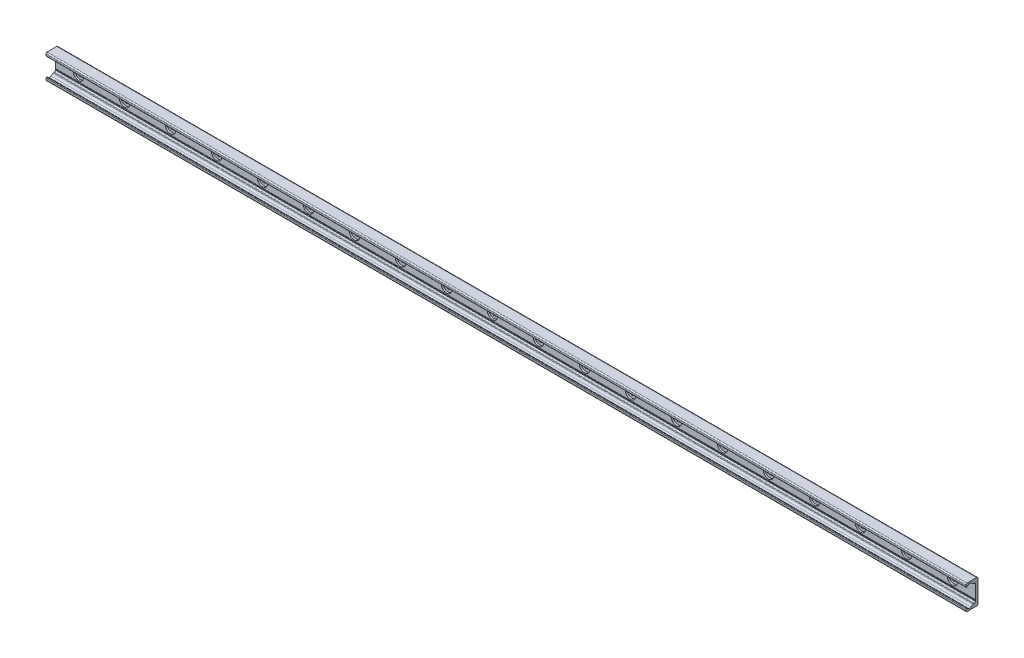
ISO-10303-21;
HEADER;
FILE_DESCRIPTION(('STEP AP214'),'2;1');
FILE_NAME('part.step','',(''),(''),'','','');
FILE_SCHEMA(('AUTOMOTIVE_DESIGN { 1 0 10303 214 1 1 1 1 }'));
ENDSEC;
DATA;
#1=APPLICATION_CONTEXT('core data for automotive mechanical design processes');
#2=APPLICATION_PROTOCOL_DEFINITION('international standard','automotive_design',2000,#1);
#3=PRODUCT_CONTEXT('',#1,'mechanical');
#4=PRODUCT('Part','Part','',(#3));
#5=PRODUCT_RELATED_PRODUCT_CATEGORY('part','',(#4));
#6=PRODUCT_DEFINITION_FORMATION('','',#4);
#7=PRODUCT_DEFINITION_CONTEXT('part definition',#1,'design');
#8=PRODUCT_DEFINITION('design','',#6,#7);
#9=PRODUCT_DEFINITION_SHAPE('','',#8);
#10=(LENGTH_UNIT() NAMED_UNIT(*) SI_UNIT(.MILLI.,.METRE.));
#11=(NAMED_UNIT(*) PLANE_ANGLE_UNIT() SI_UNIT($,.RADIAN.));
#12=(NAMED_UNIT(*) SI_UNIT($,.STERADIAN.) SOLID_ANGLE_UNIT());
#13=UNCERTAINTY_MEASURE_WITH_UNIT(LENGTH_MEASURE(1.E-05),#10,'distance_accuracy_value','');
#14=(GEOMETRIC_REPRESENTATION_CONTEXT(3) GLOBAL_UNCERTAINTY_ASSIGNED_CONTEXT((#13)) GLOBAL_UNIT_ASSIGNED_CONTEXT((#10,
#11,#12)) REPRESENTATION_CONTEXT('',''));
#15=CARTESIAN_POINT('',(0.,0.,0.));
#16=DIRECTION('',(0.,0.,1.));
#17=DIRECTION('',(1.,0.,0.));
#18=AXIS2_PLACEMENT_3D('',#15,#16,#17);
#19=CARTESIAN_POINT('',(-760.,0.,1.39999999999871));
#20=DIRECTION('',(0.,0.,1.));
#21=DIRECTION('',(1.,0.,0.));
#22=AXIS2_PLACEMENT_3D('',#19,#20,#21);
#23=PLANE('',#22);
#24=CARTESIAN_POINT('',(-760.,0.,1.39999999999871));
#25=DIRECTION('',(0.,0.,1.));
#26=DIRECTION('',(1.,0.,0.));
#27=AXIS2_PLACEMENT_3D('',#24,#25,#26);
#28=CIRCLE('',#27,4.49999999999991);
#29=CARTESIAN_POINT('',(-755.5,0.,1.39999999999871));
#30=VERTEX_POINT('',#29);
#31=EDGE_CURVE('E617',#30,#30,#28,.T.);
#32=ORIENTED_EDGE('',*,*,#31,.F.);
#33=EDGE_LOOP('',(#32));
#34=FACE_BOUND('',#33,.T.);
#35=CARTESIAN_POINT('',(-760.,0.,1.39999999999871));
#36=DIRECTION('',(0.,0.,1.));
#37=DIRECTION('',(1.,0.,0.));
#38=AXIS2_PLACEMENT_3D('',#35,#36,#37);
#39=CIRCLE('',#38,9.00000000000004);
#40=CARTESIAN_POINT('',(-751.,0.,1.39999999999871));
#41=VERTEX_POINT('',#40);
#42=EDGE_CURVE('E11',#41,#41,#39,.T.);
#43=ORIENTED_EDGE('',*,*,#42,.T.);
#44=EDGE_LOOP('',(#43));
#45=FACE_BOUND('',#44,.T.);
#46=ADVANCED_FACE('F39',(#34,#45),#23,.T.);
#47=CARTESIAN_POINT('',(-760.,0.,1.39999999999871));
#48=DIRECTION('',(0.,0.,1.));
#49=DIRECTION('',(1.,0.,0.));
#50=AXIS2_PLACEMENT_3D('',#47,#48,#49);
#51=CYLINDRICAL_SURFACE('',#50,9.00000000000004);
#52=CARTESIAN_POINT('',(-760.,0.,4.49999999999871));
#53=DIRECTION('',(0.,0.,1.));
#54=DIRECTION('',(1.,0.,0.));
#55=AXIS2_PLACEMENT_3D('',#52,#53,#54);
#56=CIRCLE('',#55,9.00000000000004);
#57=CARTESIAN_POINT('',(-751.,0.,4.49999999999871));
#58=VERTEX_POINT('',#57);
#59=EDGE_CURVE('E49',#58,#58,#56,.T.);
#60=CARTESIAN_POINT('',(-751.,0.,1.39999999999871));
#61=CARTESIAN_POINT('',(-751.,0.,1.43229166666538));
#62=CARTESIAN_POINT('',(-751.,0.,1.46458333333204));
#63=CARTESIAN_POINT('',(-751.,0.,1.52916666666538));
#64=CARTESIAN_POINT('',(-751.,0.,1.56145833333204));
#65=CARTESIAN_POINT('',(-751.,0.,1.62604166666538));
#66=CARTESIAN_POINT('',(-751.,0.,1.65833333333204));
#67=CARTESIAN_POINT('',(-751.,0.,1.72291666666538));
#68=CARTESIAN_POINT('',(-751.,0.,1.75520833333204));
#69=CARTESIAN_POINT('',(-751.,0.,1.81979166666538));
#70=CARTESIAN_POINT('',(-751.,0.,1.85208333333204));
#71=CARTESIAN_POINT('',(-751.,0.,1.91666666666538));
#72=CARTESIAN_POINT('',(-751.,0.,1.94895833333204));
#73=CARTESIAN_POINT('',(-751.,0.,2.01354166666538));
#74=CARTESIAN_POINT('',(-751.,0.,2.04583333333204));
#75=CARTESIAN_POINT('',(-751.,0.,2.11041666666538));
#76=CARTESIAN_POINT('',(-751.,0.,2.14270833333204));
#77=CARTESIAN_POINT('',(-751.,0.,2.20729166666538));
#78=CARTESIAN_POINT('',(-751.,0.,2.23958333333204));
#79=CARTESIAN_POINT('',(-751.,0.,2.30416666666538));
#80=CARTESIAN_POINT('',(-751.,0.,2.33645833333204));
#81=CARTESIAN_POINT('',(-751.,0.,2.40104166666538));
#82=CARTESIAN_POINT('',(-751.,0.,2.43333333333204));
#83=CARTESIAN_POINT('',(-751.,0.,2.49791666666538));
#84=CARTESIAN_POINT('',(-751.,0.,2.53020833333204));
#85=CARTESIAN_POINT('',(-751.,0.,2.59479166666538));
#86=CARTESIAN_POINT('',(-751.,0.,2.62708333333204));
#87=CARTESIAN_POINT('',(-751.,0.,2.69166666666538));
#88=CARTESIAN_POINT('',(-751.,0.,2.72395833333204));
#89=CARTESIAN_POINT('',(-751.,0.,2.78854166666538));
#90=CARTESIAN_POINT('',(-751.,0.,2.82083333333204));
#91=CARTESIAN_POINT('',(-751.,0.,2.88541666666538));
#92=CARTESIAN_POINT('',(-751.,0.,2.91770833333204));
#93=CARTESIAN_POINT('',(-751.,0.,2.98229166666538));
#94=CARTESIAN_POINT('',(-751.,0.,3.01458333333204));
#95=CARTESIAN_POINT('',(-751.,0.,3.07916666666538));
#96=CARTESIAN_POINT('',(-751.,0.,3.11145833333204));
#97=CARTESIAN_POINT('',(-751.,0.,3.17604166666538));
#98=CARTESIAN_POINT('',(-751.,0.,3.20833333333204));
#99=CARTESIAN_POINT('',(-751.,0.,3.27291666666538));
#100=CARTESIAN_POINT('',(-751.,0.,3.30520833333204));
#101=CARTESIAN_POINT('',(-751.,0.,3.36979166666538));
#102=CARTESIAN_POINT('',(-751.,0.,3.40208333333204));
#103=CARTESIAN_POINT('',(-751.,0.,3.46666666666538));
#104=CARTESIAN_POINT('',(-751.,0.,3.49895833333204));
#105=CARTESIAN_POINT('',(-751.,0.,3.56354166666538));
#106=CARTESIAN_POINT('',(-751.,0.,3.59583333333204));
#107=CARTESIAN_POINT('',(-751.,0.,3.66041666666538));
#108=CARTESIAN_POINT('',(-751.,0.,3.69270833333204));
#109=CARTESIAN_POINT('',(-751.,0.,3.75729166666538));
#110=CARTESIAN_POINT('',(-751.,0.,3.78958333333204));
#111=CARTESIAN_POINT('',(-751.,0.,3.85416666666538));
#112=CARTESIAN_POINT('',(-751.,0.,3.88645833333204));
#113=CARTESIAN_POINT('',(-751.,0.,3.95104166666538));
#114=CARTESIAN_POINT('',(-751.,0.,3.98333333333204));
#115=CARTESIAN_POINT('',(-751.,0.,4.04791666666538));
#116=CARTESIAN_POINT('',(-751.,0.,4.08020833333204));
#117=CARTESIAN_POINT('',(-751.,0.,4.14479166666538));
#118=CARTESIAN_POINT('',(-751.,0.,4.17708333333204));
#119=CARTESIAN_POINT('',(-751.,0.,4.24166666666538));
#120=CARTESIAN_POINT('',(-751.,0.,4.27395833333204));
#121=CARTESIAN_POINT('',(-751.,0.,4.33854166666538));
#122=CARTESIAN_POINT('',(-751.,0.,4.37083333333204));
#123=CARTESIAN_POINT('',(-751.,0.,4.43541666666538));
#124=CARTESIAN_POINT('',(-751.,0.,4.46770833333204));
#125=CARTESIAN_POINT('',(-751.,0.,4.49999999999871));
#126=B_SPLINE_CURVE_WITH_KNOTS('',3,(#60,#61,#62,#63,#64,#65,#66,#67,#68,#69,#70,#71,#72,#73,
#74,#75,#76,#77,#78,#79,#80,#81,#82,#83,#84,#85,#86,#87,#88,#89,#90,#91,#92,#93,#94,#95,#96,#97,
#98,#99,#100,#101,#102,#103,#104,#105,#106,#107,#108,#109,#110,#111,#112,#113,#114,#115,#116,
#117,#118,#119,#120,#121,#122,#123,#124,#125),.UNSPECIFIED.,.F.,.F.,(4,2,2,2,2,2,2,2,2,2,2,2,2,
2,2,2,2,2,2,2,2,2,2,2,2,2,2,2,2,2,2,2,4),(0.,0.0968750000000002,0.19375,0.290625,0.3875,
0.484375,0.58125,0.678125,0.775,0.871875,0.96875,1.065625,1.1625,1.259375,1.35625,1.453125,1.55,
1.646875,1.74375,1.840625,1.9375,2.034375,2.13125,2.228125,2.325,2.421875,2.51875,2.615625,
2.7125,2.809375,2.90625,3.003125,3.1),.UNSPECIFIED.);
#127=EDGE_CURVE('BSEAM587',#41,#58,#126,.T.);
#128=ORIENTED_EDGE('',*,*,#42,.F.);
#129=ORIENTED_EDGE('',*,*,#59,.T.);
#130=ORIENTED_EDGE('',*,*,#127,.T.);
#131=ORIENTED_EDGE('',*,*,#127,.F.);
#132=EDGE_LOOP('',(#128,#130,#129,#131));
#133=FACE_BOUND('',#132,.T.);
#134=ADVANCED_FACE('F587',(#133),#51,.F.);
#135=CARTESIAN_POINT('',(-680.,0.,1.39999999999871));
#136=DIRECTION('',(0.,0.,1.));
#137=DIRECTION('',(1.,0.,0.));
#138=AXIS2_PLACEMENT_3D('',#135,#136,#137);
#139=PLANE('',#138);
#140=CARTESIAN_POINT('',(-680.,0.,1.39999999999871));
#141=DIRECTION('',(0.,0.,1.));
#142=DIRECTION('',(1.,0.,0.));
#143=AXIS2_PLACEMENT_3D('',#140,#141,#142);
#144=CIRCLE('',#143,4.49999999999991);
#145=CARTESIAN_POINT('',(-675.5,0.,1.39999999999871));
#146=VERTEX_POINT('',#145);
#147=EDGE_CURVE('E621',#146,#146,#144,.T.);
#148=ORIENTED_EDGE('',*,*,#147,.F.);
#149=EDGE_LOOP('',(#148));
#150=FACE_BOUND('',#149,.T.);
#151=CARTESIAN_POINT('',(-680.,0.,1.39999999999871));
#152=DIRECTION('',(0.,0.,1.));
#153=DIRECTION('',(1.,0.,0.));
#154=AXIS2_PLACEMENT_3D('',#151,#152,#153);
#155=CIRCLE('',#154,9.00000000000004);
#156=CARTESIAN_POINT('',(-671.,0.,1.39999999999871));
#157=VERTEX_POINT('',#156);
#158=EDGE_CURVE('E579',#157,#157,#155,.T.);
#159=ORIENTED_EDGE('',*,*,#158,.T.);
#160=EDGE_LOOP('',(#159));
#161=FACE_BOUND('',#160,.T.);
#162=ADVANCED_FACE('F612',(#150,#161),#139,.T.);
#163=CARTESIAN_POINT('',(-680.,0.,1.39999999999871));
#164=DIRECTION('',(0.,0.,1.));
#165=DIRECTION('',(1.,0.,0.));
#166=AXIS2_PLACEMENT_3D('',#163,#164,#165);
#167=CYLINDRICAL_SURFACE('',#166,9.00000000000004);
#168=CARTESIAN_POINT('',(-680.,0.,4.49999999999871));
#169=DIRECTION('',(0.,0.,1.));
#170=DIRECTION('',(1.,0.,0.));
#171=AXIS2_PLACEMENT_3D('',#168,#169,#170);
#172=CIRCLE('',#171,9.00000000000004);
#173=CARTESIAN_POINT('',(-671.,0.,4.49999999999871));
#174=VERTEX_POINT('',#173);
#175=EDGE_CURVE('E575',#174,#174,#172,.T.);
#176=CARTESIAN_POINT('',(-671.,0.,1.39999999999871));
#177=CARTESIAN_POINT('',(-671.,0.,1.43229166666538));
#178=CARTESIAN_POINT('',(-671.,0.,1.46458333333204));
#179=CARTESIAN_POINT('',(-671.,0.,1.52916666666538));
#180=CARTESIAN_POINT('',(-671.,0.,1.56145833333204));
#181=CARTESIAN_POINT('',(-671.,0.,1.62604166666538));
#182=CARTESIAN_POINT('',(-671.,0.,1.65833333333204));
#183=CARTESIAN_POINT('',(-671.,0.,1.72291666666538));
#184=CARTESIAN_POINT('',(-671.,0.,1.75520833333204));
#185=CARTESIAN_POINT('',(-671.,0.,1.81979166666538));
#186=CARTESIAN_POINT('',(-671.,0.,1.85208333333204));
#187=CARTESIAN_POINT('',(-671.,0.,1.91666666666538));
#188=CARTESIAN_POINT('',(-671.,0.,1.94895833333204));
#189=CARTESIAN_POINT('',(-671.,0.,2.01354166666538));
#190=CARTESIAN_POINT('',(-671.,0.,2.04583333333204));
#191=CARTESIAN_POINT('',(-671.,0.,2.11041666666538));
#192=CARTESIAN_POINT('',(-671.,0.,2.14270833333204));
#193=CARTESIAN_POINT('',(-671.,0.,2.20729166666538));
#194=CARTESIAN_POINT('',(-671.,0.,2.23958333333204));
#195=CARTESIAN_POINT('',(-671.,0.,2.30416666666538));
#196=CARTESIAN_POINT('',(-671.,0.,2.33645833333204));
#197=CARTESIAN_POINT('',(-671.,0.,2.40104166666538));
#198=CARTESIAN_POINT('',(-671.,0.,2.43333333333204));
#199=CARTESIAN_POINT('',(-671.,0.,2.49791666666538));
#200=CARTESIAN_POINT('',(-671.,0.,2.53020833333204));
#201=CARTESIAN_POINT('',(-671.,0.,2.59479166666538));
#202=CARTESIAN_POINT('',(-671.,0.,2.62708333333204));
#203=CARTESIAN_POINT('',(-671.,0.,2.69166666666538));
#204=CARTESIAN_POINT('',(-671.,0.,2.72395833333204));
#205=CARTESIAN_POINT('',(-671.,0.,2.78854166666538));
#206=CARTESIAN_POINT('',(-671.,0.,2.82083333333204));
#207=CARTESIAN_POINT('',(-671.,0.,2.88541666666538));
#208=CARTESIAN_POINT('',(-671.,0.,2.91770833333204));
#209=CARTESIAN_POINT('',(-671.,0.,2.98229166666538));
#210=CARTESIAN_POINT('',(-671.,0.,3.01458333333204));
#211=CARTESIAN_POINT('',(-671.,0.,3.07916666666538));
#212=CARTESIAN_POINT('',(-671.,0.,3.11145833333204));
#213=CARTESIAN_POINT('',(-671.,0.,3.17604166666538));
#214=CARTESIAN_POINT('',(-671.,0.,3.20833333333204));
#215=CARTESIAN_POINT('',(-671.,0.,3.27291666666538));
#216=CARTESIAN_POINT('',(-671.,0.,3.30520833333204));
#217=CARTESIAN_POINT('',(-671.,0.,3.36979166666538));
#218=CARTESIAN_POINT('',(-671.,0.,3.40208333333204));
#219=CARTESIAN_POINT('',(-671.,0.,3.46666666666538));
#220=CARTESIAN_POINT('',(-671.,0.,3.49895833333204));
#221=CARTESIAN_POINT('',(-671.,0.,3.56354166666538));
#222=CARTESIAN_POINT('',(-671.,0.,3.59583333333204));
#223=CARTESIAN_POINT('',(-671.,0.,3.66041666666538));
#224=CARTESIAN_POINT('',(-671.,0.,3.69270833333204));
#225=CARTESIAN_POINT('',(-671.,0.,3.75729166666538));
#226=CARTESIAN_POINT('',(-671.,0.,3.78958333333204));
#227=CARTESIAN_POINT('',(-671.,0.,3.85416666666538));
#228=CARTESIAN_POINT('',(-671.,0.,3.88645833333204));
#229=CARTESIAN_POINT('',(-671.,0.,3.95104166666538));
#230=CARTESIAN_POINT('',(-671.,0.,3.98333333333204));
#231=CARTESIAN_POINT('',(-671.,0.,4.04791666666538));
#232=CARTESIAN_POINT('',(-671.,0.,4.08020833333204));
#233=CARTESIAN_POINT('',(-671.,0.,4.14479166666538));
#234=CARTESIAN_POINT('',(-671.,0.,4.17708333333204));
#235=CARTESIAN_POINT('',(-671.,0.,4.24166666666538));
#236=CARTESIAN_POINT('',(-671.,0.,4.27395833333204));
#237=CARTESIAN_POINT('',(-671.,0.,4.33854166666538));
#238=CARTESIAN_POINT('',(-671.,0.,4.37083333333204));
#239=CARTESIAN_POINT('',(-671.,0.,4.43541666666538));
#240=CARTESIAN_POINT('',(-671.,0.,4.46770833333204));
#241=CARTESIAN_POINT('',(-671.,0.,4.49999999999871));
#242=B_SPLINE_CURVE_WITH_KNOTS('',3,(#176,#177,#178,#179,#180,#181,#182,#183,#184,#185,#186,
#187,#188,#189,#190,#191,#192,#193,#194,#195,#196,#197,#198,#199,#200,#201,#202,#203,#204,#205,
#206,#207,#208,#209,#210,#211,#212,#213,#214,#215,#216,#217,#218,#219,#220,#221,#222,#223,#224,
#225,#226,#227,#228,#229,#230,#231,#232,#233,#234,#235,#236,#237,#238,#239,#240,#241),
.UNSPECIFIED.,.F.,.F.,(4,2,2,2,2,2,2,2,2,2,2,2,2,2,2,2,2,2,2,2,2,2,2,2,2,2,2,2,2,2,2,2,4),(0.,
0.0968750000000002,0.19375,0.290625,0.3875,0.484375,0.58125,0.678125,0.775,0.871875,0.96875,
1.065625,1.1625,1.259375,1.35625,1.453125,1.55,1.646875,1.74375,1.840625,1.9375,2.034375,
2.13125,2.228125,2.325,2.421875,2.51875,2.615625,2.7125,2.809375,2.90625,3.003125,3.1),.UNSPECIFIED.);
#243=EDGE_CURVE('BSEAM1191',#157,#174,#242,.T.);
#244=ORIENTED_EDGE('',*,*,#158,.F.);
#245=ORIENTED_EDGE('',*,*,#175,.T.);
#246=ORIENTED_EDGE('',*,*,#243,.T.);
#247=ORIENTED_EDGE('',*,*,#243,.F.);
#248=EDGE_LOOP('',(#244,#246,#245,#247));
#249=FACE_BOUND('',#248,.T.);
#250=ADVANCED_FACE('F1191',(#249),#167,.F.);
#251=CARTESIAN_POINT('',(-600.,0.,1.39999999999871));
#252=DIRECTION('',(0.,0.,1.));
#253=DIRECTION('',(1.,0.,0.));
#254=AXIS2_PLACEMENT_3D('',#251,#252,#253);
#255=PLANE('',#254);
#256=CARTESIAN_POINT('',(-600.,0.,1.39999999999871));
#257=DIRECTION('',(0.,0.,1.));
#258=DIRECTION('',(1.,0.,0.));
#259=AXIS2_PLACEMENT_3D('',#256,#257,#258);
#260=CIRCLE('',#259,4.49999999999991);
#261=CARTESIAN_POINT('',(-595.5,0.,1.39999999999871));
#262=VERTEX_POINT('',#261);
#263=EDGE_CURVE('E626',#262,#262,#260,.T.);
#264=ORIENTED_EDGE('',*,*,#263,.F.);
#265=EDGE_LOOP('',(#264));
#266=FACE_BOUND('',#265,.T.);
#267=CARTESIAN_POINT('',(-600.,0.,1.39999999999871));
#268=DIRECTION('',(0.,0.,1.));
#269=DIRECTION('',(1.,0.,0.));
#270=AXIS2_PLACEMENT_3D('',#267,#268,#269);
#271=CIRCLE('',#270,9.00000000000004);
#272=CARTESIAN_POINT('',(-591.,0.,1.39999999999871));
#273=VERTEX_POINT('',#272);
#274=EDGE_CURVE('E571',#273,#273,#271,.T.);
#275=ORIENTED_EDGE('',*,*,#274,.T.);
#276=EDGE_LOOP('',(#275));
#277=FACE_BOUND('',#276,.T.);
#278=ADVANCED_FACE('F1187',(#266,#277),#255,.T.);
#279=CARTESIAN_POINT('',(-600.,0.,1.39999999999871));
#280=DIRECTION('',(0.,0.,1.));
#281=DIRECTION('',(1.,0.,0.));
#282=AXIS2_PLACEMENT_3D('',#279,#280,#281);
#283=CYLINDRICAL_SURFACE('',#282,9.00000000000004);
#284=CARTESIAN_POINT('',(-600.,0.,4.49999999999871));
#285=DIRECTION('',(0.,0.,1.));
#286=DIRECTION('',(1.,0.,0.));
#287=AXIS2_PLACEMENT_3D('',#284,#285,#286);
#288=CIRCLE('',#287,9.00000000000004);
#289=CARTESIAN_POINT('',(-591.,0.,4.49999999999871));
#290=VERTEX_POINT('',#289);
#291=EDGE_CURVE('E567',#290,#290,#288,.T.);
#292=CARTESIAN_POINT('',(-591.,0.,1.39999999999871));
#293=CARTESIAN_POINT('',(-591.,0.,1.43229166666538));
#294=CARTESIAN_POINT('',(-591.,0.,1.46458333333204));
#295=CARTESIAN_POINT('',(-591.,0.,1.52916666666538));
#296=CARTESIAN_POINT('',(-591.,0.,1.56145833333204));
#297=CARTESIAN_POINT('',(-591.,0.,1.62604166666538));
#298=CARTESIAN_POINT('',(-591.,0.,1.65833333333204));
#299=CARTESIAN_POINT('',(-591.,0.,1.72291666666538));
#300=CARTESIAN_POINT('',(-591.,0.,1.75520833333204));
#301=CARTESIAN_POINT('',(-591.,0.,1.81979166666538));
#302=CARTESIAN_POINT('',(-591.,0.,1.85208333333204));
#303=CARTESIAN_POINT('',(-591.,0.,1.91666666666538));
#304=CARTESIAN_POINT('',(-591.,0.,1.94895833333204));
#305=CARTESIAN_POINT('',(-591.,0.,2.01354166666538));
#306=CARTESIAN_POINT('',(-591.,0.,2.04583333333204));
#307=CARTESIAN_POINT('',(-591.,0.,2.11041666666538));
#308=CARTESIAN_POINT('',(-591.,0.,2.14270833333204));
#309=CARTESIAN_POINT('',(-591.,0.,2.20729166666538));
#310=CARTESIAN_POINT('',(-591.,0.,2.23958333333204));
#311=CARTESIAN_POINT('',(-591.,0.,2.30416666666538));
#312=CARTESIAN_POINT('',(-591.,0.,2.33645833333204));
#313=CARTESIAN_POINT('',(-591.,0.,2.40104166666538));
#314=CARTESIAN_POINT('',(-591.,0.,2.43333333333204));
#315=CARTESIAN_POINT('',(-591.,0.,2.49791666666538));
#316=CARTESIAN_POINT('',(-591.,0.,2.53020833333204));
#317=CARTESIAN_POINT('',(-591.,0.,2.59479166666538));
#318=CARTESIAN_POINT('',(-591.,0.,2.62708333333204));
#319=CARTESIAN_POINT('',(-591.,0.,2.69166666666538));
#320=CARTESIAN_POINT('',(-591.,0.,2.72395833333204));
#321=CARTESIAN_POINT('',(-591.,0.,2.78854166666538));
#322=CARTESIAN_POINT('',(-591.,0.,2.82083333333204));
#323=CARTESIAN_POINT('',(-591.,0.,2.88541666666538));
#324=CARTESIAN_POINT('',(-591.,0.,2.91770833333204));
#325=CARTESIAN_POINT('',(-591.,0.,2.98229166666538));
#326=CARTESIAN_POINT('',(-591.,0.,3.01458333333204));
#327=CARTESIAN_POINT('',(-591.,0.,3.07916666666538));
#328=CARTESIAN_POINT('',(-591.,0.,3.11145833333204));
#329=CARTESIAN_POINT('',(-591.,0.,3.17604166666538));
#330=CARTESIAN_POINT('',(-591.,0.,3.20833333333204));
#331=CARTESIAN_POINT('',(-591.,0.,3.27291666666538));
#332=CARTESIAN_POINT('',(-591.,0.,3.30520833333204));
#333=CARTESIAN_POINT('',(-591.,0.,3.36979166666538));
#334=CARTESIAN_POINT('',(-591.,0.,3.40208333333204));
#335=CARTESIAN_POINT('',(-591.,0.,3.46666666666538));
#336=CARTESIAN_POINT('',(-591.,0.,3.49895833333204));
#337=CARTESIAN_POINT('',(-591.,0.,3.56354166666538));
#338=CARTESIAN_POINT('',(-591.,0.,3.59583333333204));
#339=CARTESIAN_POINT('',(-591.,0.,3.66041666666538));
#340=CARTESIAN_POINT('',(-591.,0.,3.69270833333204));
#341=CARTESIAN_POINT('',(-591.,0.,3.75729166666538));
#342=CARTESIAN_POINT('',(-591.,0.,3.78958333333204));
#343=CARTESIAN_POINT('',(-591.,0.,3.85416666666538));
#344=CARTESIAN_POINT('',(-591.,0.,3.88645833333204));
#345=CARTESIAN_POINT('',(-591.,0.,3.95104166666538));
#346=CARTESIAN_POINT('',(-591.,0.,3.98333333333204));
#347=CARTESIAN_POINT('',(-591.,0.,4.04791666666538));
#348=CARTESIAN_POINT('',(-591.,0.,4.08020833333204));
#349=CARTESIAN_POINT('',(-591.,0.,4.14479166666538));
#350=CARTESIAN_POINT('',(-591.,0.,4.17708333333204));
#351=CARTESIAN_POINT('',(-591.,0.,4.24166666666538));
#352=CARTESIAN_POINT('',(-591.,0.,4.27395833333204));
#353=CARTESIAN_POINT('',(-591.,0.,4.33854166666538));
#354=CARTESIAN_POINT('',(-591.,0.,4.37083333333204));
#355=CARTESIAN_POINT('',(-591.,0.,4.43541666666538));
#356=CARTESIAN_POINT('',(-591.,0.,4.46770833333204));
#357=CARTESIAN_POINT('',(-591.,0.,4.49999999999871));
#358=B_SPLINE_CURVE_WITH_KNOTS('',3,(#292,#293,#294,#295,#296,#297,#298,#299,#300,#301,#302,
#303,#304,#305,#306,#307,#308,#309,#310,#311,#312,#313,#314,#315,#316,#317,#318,#319,#320,#321,
#322,#323,#324,#325,#326,#327,#328,#329,#330,#331,#332,#333,#334,#335,#336,#337,#338,#339,#340,
#341,#342,#343,#344,#345,#346,#347,#348,#349,#350,#351,#352,#353,#354,#355,#356,#357),
.UNSPECIFIED.,.F.,.F.,(4,2,2,2,2,2,2,2,2,2,2,2,2,2,2,2,2,2,2,2,2,2,2,2,2,2,2,2,2,2,2,2,4),(0.,
0.0968750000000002,0.19375,0.290625,0.3875,0.484375,0.58125,0.678125,0.775,0.871875,0.96875,
1.065625,1.1625,1.259375,1.35625,1.453125,1.55,1.646875,1.74375,1.840625,1.9375,2.034375,
2.13125,2.228125,2.325,2.421875,2.51875,2.615625,2.7125,2.809375,2.90625,3.003125,3.1),.UNSPECIFIED.);
#359=EDGE_CURVE('BSEAM1183',#273,#290,#358,.T.);
#360=ORIENTED_EDGE('',*,*,#274,.F.);
#361=ORIENTED_EDGE('',*,*,#291,.T.);
#362=ORIENTED_EDGE('',*,*,#359,.T.);
#363=ORIENTED_EDGE('',*,*,#359,.F.);
#364=EDGE_LOOP('',(#360,#362,#361,#363));
#365=FACE_BOUND('',#364,.T.);
#366=ADVANCED_FACE('F1183',(#365),#283,.F.);
#367=CARTESIAN_POINT('',(-520.,0.,1.39999999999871));
#368=DIRECTION('',(0.,0.,1.));
#369=DIRECTION('',(1.,0.,0.));
#370=AXIS2_PLACEMENT_3D('',#367,#368,#369);
#371=PLANE('',#370);
#372=CARTESIAN_POINT('',(-520.,0.,1.39999999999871));
#373=DIRECTION('',(0.,0.,1.));
#374=DIRECTION('',(1.,0.,0.));
#375=AXIS2_PLACEMENT_3D('',#372,#373,#374);
#376=CIRCLE('',#375,4.49999999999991);
#377=CARTESIAN_POINT('',(-515.5,0.,1.39999999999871));
#378=VERTEX_POINT('',#377);
#379=EDGE_CURVE('E638',#378,#378,#376,.T.);
#380=ORIENTED_EDGE('',*,*,#379,.F.);
#381=EDGE_LOOP('',(#380));
#382=FACE_BOUND('',#381,.T.);
#383=CARTESIAN_POINT('',(-520.,0.,1.39999999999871));
#384=DIRECTION('',(0.,0.,1.));
#385=DIRECTION('',(1.,0.,0.));
#386=AXIS2_PLACEMENT_3D('',#383,#384,#385);
#387=CIRCLE('',#386,9.00000000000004);
#388=CARTESIAN_POINT('',(-511.,0.,1.39999999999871));
#389=VERTEX_POINT('',#388);
#390=EDGE_CURVE('E564',#389,#389,#387,.T.);
#391=ORIENTED_EDGE('',*,*,#390,.T.);
#392=EDGE_LOOP('',(#391));
#393=FACE_BOUND('',#392,.T.);
#394=ADVANCED_FACE('F1179',(#382,#393),#371,.T.);
#395=CARTESIAN_POINT('',(-520.,0.,1.39999999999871));
#396=DIRECTION('',(0.,0.,1.));
#397=DIRECTION('',(1.,0.,0.));
#398=AXIS2_PLACEMENT_3D('',#395,#396,#397);
#399=CYLINDRICAL_SURFACE('',#398,9.00000000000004);
#400=CARTESIAN_POINT('',(-520.,0.,4.49999999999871));
#401=DIRECTION('',(0.,0.,1.));
#402=DIRECTION('',(1.,0.,0.));
#403=AXIS2_PLACEMENT_3D('',#400,#401,#402);
#404=CIRCLE('',#403,9.00000000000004);
#405=CARTESIAN_POINT('',(-511.,0.,4.49999999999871));
#406=VERTEX_POINT('',#405);
#407=EDGE_CURVE('E560',#406,#406,#404,.T.);
#408=CARTESIAN_POINT('',(-511.,0.,1.39999999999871));
#409=CARTESIAN_POINT('',(-511.,0.,1.43229166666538));
#410=CARTESIAN_POINT('',(-511.,0.,1.46458333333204));
#411=CARTESIAN_POINT('',(-511.,0.,1.52916666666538));
#412=CARTESIAN_POINT('',(-511.,0.,1.56145833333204));
#413=CARTESIAN_POINT('',(-511.,0.,1.62604166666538));
#414=CARTESIAN_POINT('',(-511.,0.,1.65833333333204));
#415=CARTESIAN_POINT('',(-511.,0.,1.72291666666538));
#416=CARTESIAN_POINT('',(-511.,0.,1.75520833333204));
#417=CARTESIAN_POINT('',(-511.,0.,1.81979166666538));
#418=CARTESIAN_POINT('',(-511.,0.,1.85208333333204));
#419=CARTESIAN_POINT('',(-511.,0.,1.91666666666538));
#420=CARTESIAN_POINT('',(-511.,0.,1.94895833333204));
#421=CARTESIAN_POINT('',(-511.,0.,2.01354166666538));
#422=CARTESIAN_POINT('',(-511.,0.,2.04583333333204));
#423=CARTESIAN_POINT('',(-511.,0.,2.11041666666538));
#424=CARTESIAN_POINT('',(-511.,0.,2.14270833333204));
#425=CARTESIAN_POINT('',(-511.,0.,2.20729166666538));
#426=CARTESIAN_POINT('',(-511.,0.,2.23958333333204));
#427=CARTESIAN_POINT('',(-511.,0.,2.30416666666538));
#428=CARTESIAN_POINT('',(-511.,0.,2.33645833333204));
#429=CARTESIAN_POINT('',(-511.,0.,2.40104166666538));
#430=CARTESIAN_POINT('',(-511.,0.,2.43333333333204));
#431=CARTESIAN_POINT('',(-511.,0.,2.49791666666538));
#432=CARTESIAN_POINT('',(-511.,0.,2.53020833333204));
#433=CARTESIAN_POINT('',(-511.,0.,2.59479166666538));
#434=CARTESIAN_POINT('',(-511.,0.,2.62708333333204));
#435=CARTESIAN_POINT('',(-511.,0.,2.69166666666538));
#436=CARTESIAN_POINT('',(-511.,0.,2.72395833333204));
#437=CARTESIAN_POINT('',(-511.,0.,2.78854166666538));
#438=CARTESIAN_POINT('',(-511.,0.,2.82083333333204));
#439=CARTESIAN_POINT('',(-511.,0.,2.88541666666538));
#440=CARTESIAN_POINT('',(-511.,0.,2.91770833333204));
#441=CARTESIAN_POINT('',(-511.,0.,2.98229166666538));
#442=CARTESIAN_POINT('',(-511.,0.,3.01458333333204));
#443=CARTESIAN_POINT('',(-511.,0.,3.07916666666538));
#444=CARTESIAN_POINT('',(-511.,0.,3.11145833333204));
#445=CARTESIAN_POINT('',(-511.,0.,3.17604166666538));
#446=CARTESIAN_POINT('',(-511.,0.,3.20833333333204));
#447=CARTESIAN_POINT('',(-511.,0.,3.27291666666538));
#448=CARTESIAN_POINT('',(-511.,0.,3.30520833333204));
#449=CARTESIAN_POINT('',(-511.,0.,3.36979166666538));
#450=CARTESIAN_POINT('',(-511.,0.,3.40208333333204));
#451=CARTESIAN_POINT('',(-511.,0.,3.46666666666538));
#452=CARTESIAN_POINT('',(-511.,0.,3.49895833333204));
#453=CARTESIAN_POINT('',(-511.,0.,3.56354166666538));
#454=CARTESIAN_POINT('',(-511.,0.,3.59583333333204));
#455=CARTESIAN_POINT('',(-511.,0.,3.66041666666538));
#456=CARTESIAN_POINT('',(-511.,0.,3.69270833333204));
#457=CARTESIAN_POINT('',(-511.,0.,3.75729166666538));
#458=CARTESIAN_POINT('',(-511.,0.,3.78958333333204));
#459=CARTESIAN_POINT('',(-511.,0.,3.85416666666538));
#460=CARTESIAN_POINT('',(-511.,0.,3.88645833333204));
#461=CARTESIAN_POINT('',(-511.,0.,3.95104166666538));
#462=CARTESIAN_POINT('',(-511.,0.,3.98333333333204));
#463=CARTESIAN_POINT('',(-511.,0.,4.04791666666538));
#464=CARTESIAN_POINT('',(-511.,0.,4.08020833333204));
#465=CARTESIAN_POINT('',(-511.,0.,4.14479166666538));
#466=CARTESIAN_POINT('',(-511.,0.,4.17708333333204));
#467=CARTESIAN_POINT('',(-511.,0.,4.24166666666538));
#468=CARTESIAN_POINT('',(-511.,0.,4.27395833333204));
#469=CARTESIAN_POINT('',(-511.,0.,4.33854166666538));
#470=CARTESIAN_POINT('',(-511.,0.,4.37083333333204));
#471=CARTESIAN_POINT('',(-511.,0.,4.43541666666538));
#472=CARTESIAN_POINT('',(-511.,0.,4.46770833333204));
#473=CARTESIAN_POINT('',(-511.,0.,4.49999999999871));
#474=B_SPLINE_CURVE_WITH_KNOTS('',3,(#408,#409,#410,#411,#412,#413,#414,#415,#416,#417,#418,
#419,#420,#421,#422,#423,#424,#425,#426,#427,#428,#429,#430,#431,#432,#433,#434,#435,#436,#437,
#438,#439,#440,#441,#442,#443,#444,#445,#446,#447,#448,#449,#450,#451,#452,#453,#454,#455,#456,
#457,#458,#459,#460,#461,#462,#463,#464,#465,#466,#467,#468,#469,#470,#471,#472,#473),
.UNSPECIFIED.,.F.,.F.,(4,2,2,2,2,2,2,2,2,2,2,2,2,2,2,2,2,2,2,2,2,2,2,2,2,2,2,2,2,2,2,2,4),(0.,
0.0968750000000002,0.19375,0.290625,0.3875,0.484375,0.58125,0.678125,0.775,0.871875,0.96875,
1.065625,1.1625,1.259375,1.35625,1.453125,1.55,1.646875,1.74375,1.840625,1.9375,2.034375,
2.13125,2.228125,2.325,2.421875,2.51875,2.615625,2.7125,2.809375,2.90625,3.003125,3.1),.UNSPECIFIED.);
#475=EDGE_CURVE('BSEAM1175',#389,#406,#474,.T.);
#476=ORIENTED_EDGE('',*,*,#390,.F.);
#477=ORIENTED_EDGE('',*,*,#407,.T.);
#478=ORIENTED_EDGE('',*,*,#475,.T.);
#479=ORIENTED_EDGE('',*,*,#475,.F.);
#480=EDGE_LOOP('',(#476,#478,#477,#479));
#481=FACE_BOUND('',#480,.T.);
#482=ADVANCED_FACE('F1175',(#481),#399,.F.);
#483=CARTESIAN_POINT('',(-440.,0.,1.39999999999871));
#484=DIRECTION('',(0.,0.,1.));
#485=DIRECTION('',(1.,0.,0.));
#486=AXIS2_PLACEMENT_3D('',#483,#484,#485);
#487=PLANE('',#486);
#488=CARTESIAN_POINT('',(-440.,0.,1.39999999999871));
#489=DIRECTION('',(0.,0.,1.));
#490=DIRECTION('',(1.,0.,0.));
#491=AXIS2_PLACEMENT_3D('',#488,#489,#490);
#492=CIRCLE('',#491,4.49999999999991);
#493=CARTESIAN_POINT('',(-435.5,0.,1.39999999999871));
#494=VERTEX_POINT('',#493);
#495=EDGE_CURVE('E642',#494,#494,#492,.T.);
#496=ORIENTED_EDGE('',*,*,#495,.F.);
#497=EDGE_LOOP('',(#496));
#498=FACE_BOUND('',#497,.T.);
#499=CARTESIAN_POINT('',(-440.,0.,1.39999999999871));
#500=DIRECTION('',(0.,0.,1.));
#501=DIRECTION('',(1.,0.,0.));
#502=AXIS2_PLACEMENT_3D('',#499,#500,#501);
#503=CIRCLE('',#502,9.00000000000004);
#504=CARTESIAN_POINT('',(-431.,0.,1.39999999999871));
#505=VERTEX_POINT('',#504);
#506=EDGE_CURVE('E556',#505,#505,#503,.T.);
#507=ORIENTED_EDGE('',*,*,#506,.T.);
#508=EDGE_LOOP('',(#507));
#509=FACE_BOUND('',#508,.T.);
#510=ADVANCED_FACE('F1171',(#498,#509),#487,.T.);
#511=CARTESIAN_POINT('',(-440.,0.,1.39999999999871));
#512=DIRECTION('',(0.,0.,1.));
#513=DIRECTION('',(1.,0.,0.));
#514=AXIS2_PLACEMENT_3D('',#511,#512,#513);
#515=CYLINDRICAL_SURFACE('',#514,9.00000000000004);
#516=CARTESIAN_POINT('',(-440.,0.,4.49999999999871));
#517=DIRECTION('',(0.,0.,1.));
#518=DIRECTION('',(1.,0.,0.));
#519=AXIS2_PLACEMENT_3D('',#516,#517,#518);
#520=CIRCLE('',#519,9.00000000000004);
#521=CARTESIAN_POINT('',(-431.,0.,4.49999999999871));
#522=VERTEX_POINT('',#521);
#523=EDGE_CURVE('E552',#522,#522,#520,.T.);
#524=CARTESIAN_POINT('',(-431.,0.,1.39999999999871));
#525=CARTESIAN_POINT('',(-431.,0.,1.43229166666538));
#526=CARTESIAN_POINT('',(-431.,0.,1.46458333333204));
#527=CARTESIAN_POINT('',(-431.,0.,1.52916666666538));
#528=CARTESIAN_POINT('',(-431.,0.,1.56145833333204));
#529=CARTESIAN_POINT('',(-431.,0.,1.62604166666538));
#530=CARTESIAN_POINT('',(-431.,0.,1.65833333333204));
#531=CARTESIAN_POINT('',(-431.,0.,1.72291666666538));
#532=CARTESIAN_POINT('',(-431.,0.,1.75520833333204));
#533=CARTESIAN_POINT('',(-431.,0.,1.81979166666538));
#534=CARTESIAN_POINT('',(-431.,0.,1.85208333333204));
#535=CARTESIAN_POINT('',(-431.,0.,1.91666666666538));
#536=CARTESIAN_POINT('',(-431.,0.,1.94895833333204));
#537=CARTESIAN_POINT('',(-431.,0.,2.01354166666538));
#538=CARTESIAN_POINT('',(-431.,0.,2.04583333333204));
#539=CARTESIAN_POINT('',(-431.,0.,2.11041666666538));
#540=CARTESIAN_POINT('',(-431.,0.,2.14270833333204));
#541=CARTESIAN_POINT('',(-431.,0.,2.20729166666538));
#542=CARTESIAN_POINT('',(-431.,0.,2.23958333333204));
#543=CARTESIAN_POINT('',(-431.,0.,2.30416666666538));
#544=CARTESIAN_POINT('',(-431.,0.,2.33645833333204));
#545=CARTESIAN_POINT('',(-431.,0.,2.40104166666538));
#546=CARTESIAN_POINT('',(-431.,0.,2.43333333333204));
#547=CARTESIAN_POINT('',(-431.,0.,2.49791666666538));
#548=CARTESIAN_POINT('',(-431.,0.,2.53020833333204));
#549=CARTESIAN_POINT('',(-431.,0.,2.59479166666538));
#550=CARTESIAN_POINT('',(-431.,0.,2.62708333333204));
#551=CARTESIAN_POINT('',(-431.,0.,2.69166666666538));
#552=CARTESIAN_POINT('',(-431.,0.,2.72395833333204));
#553=CARTESIAN_POINT('',(-431.,0.,2.78854166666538));
#554=CARTESIAN_POINT('',(-431.,0.,2.82083333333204));
#555=CARTESIAN_POINT('',(-431.,0.,2.88541666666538));
#556=CARTESIAN_POINT('',(-431.,0.,2.91770833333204));
#557=CARTESIAN_POINT('',(-431.,0.,2.98229166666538));
#558=CARTESIAN_POINT('',(-431.,0.,3.01458333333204));
#559=CARTESIAN_POINT('',(-431.,0.,3.07916666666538));
#560=CARTESIAN_POINT('',(-431.,0.,3.11145833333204));
#561=CARTESIAN_POINT('',(-431.,0.,3.17604166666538));
#562=CARTESIAN_POINT('',(-431.,0.,3.20833333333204));
#563=CARTESIAN_POINT('',(-431.,0.,3.27291666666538));
#564=CARTESIAN_POINT('',(-431.,0.,3.30520833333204));
#565=CARTESIAN_POINT('',(-431.,0.,3.36979166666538));
#566=CARTESIAN_POINT('',(-431.,0.,3.40208333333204));
#567=CARTESIAN_POINT('',(-431.,0.,3.46666666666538));
#568=CARTESIAN_POINT('',(-431.,0.,3.49895833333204));
#569=CARTESIAN_POINT('',(-431.,0.,3.56354166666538));
#570=CARTESIAN_POINT('',(-431.,0.,3.59583333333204));
#571=CARTESIAN_POINT('',(-431.,0.,3.66041666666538));
#572=CARTESIAN_POINT('',(-431.,0.,3.69270833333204));
#573=CARTESIAN_POINT('',(-431.,0.,3.75729166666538));
#574=CARTESIAN_POINT('',(-431.,0.,3.78958333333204));
#575=CARTESIAN_POINT('',(-431.,0.,3.85416666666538));
#576=CARTESIAN_POINT('',(-431.,0.,3.88645833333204));
#577=CARTESIAN_POINT('',(-431.,0.,3.95104166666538));
#578=CARTESIAN_POINT('',(-431.,0.,3.98333333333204));
#579=CARTESIAN_POINT('',(-431.,0.,4.04791666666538));
#580=CARTESIAN_POINT('',(-431.,0.,4.08020833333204));
#581=CARTESIAN_POINT('',(-431.,0.,4.14479166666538));
#582=CARTESIAN_POINT('',(-431.,0.,4.17708333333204));
#583=CARTESIAN_POINT('',(-431.,0.,4.24166666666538));
#584=CARTESIAN_POINT('',(-431.,0.,4.27395833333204));
#585=CARTESIAN_POINT('',(-431.,0.,4.33854166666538));
#586=CARTESIAN_POINT('',(-431.,0.,4.37083333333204));
#587=CARTESIAN_POINT('',(-431.,0.,4.43541666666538));
#588=CARTESIAN_POINT('',(-431.,0.,4.46770833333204));
#589=CARTESIAN_POINT('',(-431.,0.,4.49999999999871));
#590=B_SPLINE_CURVE_WITH_KNOTS('',3,(#524,#525,#526,#527,#528,#529,#530,#531,#532,#533,#534,
#535,#536,#537,#538,#539,#540,#541,#542,#543,#544,#545,#546,#547,#548,#549,#550,#551,#552,#553,
#554,#555,#556,#557,#558,#559,#560,#561,#562,#563,#564,#565,#566,#567,#568,#569,#570,#571,#572,
#573,#574,#575,#576,#577,#578,#579,#580,#581,#582,#583,#584,#585,#586,#587,#588,#589),
.UNSPECIFIED.,.F.,.F.,(4,2,2,2,2,2,2,2,2,2,2,2,2,2,2,2,2,2,2,2,2,2,2,2,2,2,2,2,2,2,2,2,4),(0.,
0.0968750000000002,0.19375,0.290625,0.3875,0.484375,0.58125,0.678125,0.775,0.871875,0.96875,
1.065625,1.1625,1.259375,1.35625,1.453125,1.55,1.646875,1.74375,1.840625,1.9375,2.034375,
2.13125,2.228125,2.325,2.421875,2.51875,2.615625,2.7125,2.809375,2.90625,3.003125,3.1),.UNSPECIFIED.);
#591=EDGE_CURVE('BSEAM1167',#505,#522,#590,.T.);
#592=ORIENTED_EDGE('',*,*,#506,.F.);
#593=ORIENTED_EDGE('',*,*,#523,.T.);
#594=ORIENTED_EDGE('',*,*,#591,.T.);
#595=ORIENTED_EDGE('',*,*,#591,.F.);
#596=EDGE_LOOP('',(#592,#594,#593,#595));
#597=FACE_BOUND('',#596,.T.);
#598=ADVANCED_FACE('F1167',(#597),#515,.F.);
#599=CARTESIAN_POINT('',(-360.,0.,1.39999999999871));
#600=DIRECTION('',(0.,0.,1.));
#601=DIRECTION('',(1.,0.,0.));
#602=AXIS2_PLACEMENT_3D('',#599,#600,#601);
#603=PLANE('',#602);
#604=CARTESIAN_POINT('',(-360.,0.,1.39999999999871));
#605=DIRECTION('',(0.,0.,1.));
#606=DIRECTION('',(1.,0.,0.));
#607=AXIS2_PLACEMENT_3D('',#604,#605,#606);
#608=CIRCLE('',#607,4.49999999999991);
#609=CARTESIAN_POINT('',(-355.5,0.,1.39999999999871));
#610=VERTEX_POINT('',#609);
#611=EDGE_CURVE('E646',#610,#610,#608,.T.);
#612=ORIENTED_EDGE('',*,*,#611,.F.);
#613=EDGE_LOOP('',(#612));
#614=FACE_BOUND('',#613,.T.);
#615=CARTESIAN_POINT('',(-360.,0.,1.39999999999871));
#616=DIRECTION('',(0.,0.,1.));
#617=DIRECTION('',(1.,0.,0.));
#618=AXIS2_PLACEMENT_3D('',#615,#616,#617);
#619=CIRCLE('',#618,9.00000000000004);
#620=CARTESIAN_POINT('',(-351.,0.,1.39999999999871));
#621=VERTEX_POINT('',#620);
#622=EDGE_CURVE('E548',#621,#621,#619,.T.);
#623=ORIENTED_EDGE('',*,*,#622,.T.);
#624=EDGE_LOOP('',(#623));
#625=FACE_BOUND('',#624,.T.);
#626=ADVANCED_FACE('F1163',(#614,#625),#603,.T.);
#627=CARTESIAN_POINT('',(-360.,0.,1.39999999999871));
#628=DIRECTION('',(0.,0.,1.));
#629=DIRECTION('',(1.,0.,0.));
#630=AXIS2_PLACEMENT_3D('',#627,#628,#629);
#631=CYLINDRICAL_SURFACE('',#630,9.00000000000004);
#632=CARTESIAN_POINT('',(-360.,0.,4.49999999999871));
#633=DIRECTION('',(0.,0.,1.));
#634=DIRECTION('',(1.,0.,0.));
#635=AXIS2_PLACEMENT_3D('',#632,#633,#634);
#636=CIRCLE('',#635,9.00000000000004);
#637=CARTESIAN_POINT('',(-351.,0.,4.49999999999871));
#638=VERTEX_POINT('',#637);
#639=EDGE_CURVE('E544',#638,#638,#636,.T.);
#640=CARTESIAN_POINT('',(-351.,0.,1.39999999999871));
#641=CARTESIAN_POINT('',(-351.,0.,1.43229166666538));
#642=CARTESIAN_POINT('',(-351.,0.,1.46458333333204));
#643=CARTESIAN_POINT('',(-351.,0.,1.52916666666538));
#644=CARTESIAN_POINT('',(-351.,0.,1.56145833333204));
#645=CARTESIAN_POINT('',(-351.,0.,1.62604166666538));
#646=CARTESIAN_POINT('',(-351.,0.,1.65833333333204));
#647=CARTESIAN_POINT('',(-351.,0.,1.72291666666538));
#648=CARTESIAN_POINT('',(-351.,0.,1.75520833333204));
#649=CARTESIAN_POINT('',(-351.,0.,1.81979166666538));
#650=CARTESIAN_POINT('',(-351.,0.,1.85208333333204));
#651=CARTESIAN_POINT('',(-351.,0.,1.91666666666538));
#652=CARTESIAN_POINT('',(-351.,0.,1.94895833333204));
#653=CARTESIAN_POINT('',(-351.,0.,2.01354166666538));
#654=CARTESIAN_POINT('',(-351.,0.,2.04583333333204));
#655=CARTESIAN_POINT('',(-351.,0.,2.11041666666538));
#656=CARTESIAN_POINT('',(-351.,0.,2.14270833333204));
#657=CARTESIAN_POINT('',(-351.,0.,2.20729166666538));
#658=CARTESIAN_POINT('',(-351.,0.,2.23958333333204));
#659=CARTESIAN_POINT('',(-351.,0.,2.30416666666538));
#660=CARTESIAN_POINT('',(-351.,0.,2.33645833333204));
#661=CARTESIAN_POINT('',(-351.,0.,2.40104166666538));
#662=CARTESIAN_POINT('',(-351.,0.,2.43333333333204));
#663=CARTESIAN_POINT('',(-351.,0.,2.49791666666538));
#664=CARTESIAN_POINT('',(-351.,0.,2.53020833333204));
#665=CARTESIAN_POINT('',(-351.,0.,2.59479166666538));
#666=CARTESIAN_POINT('',(-351.,0.,2.62708333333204));
#667=CARTESIAN_POINT('',(-351.,0.,2.69166666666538));
#668=CARTESIAN_POINT('',(-351.,0.,2.72395833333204));
#669=CARTESIAN_POINT('',(-351.,0.,2.78854166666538));
#670=CARTESIAN_POINT('',(-351.,0.,2.82083333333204));
#671=CARTESIAN_POINT('',(-351.,0.,2.88541666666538));
#672=CARTESIAN_POINT('',(-351.,0.,2.91770833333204));
#673=CARTESIAN_POINT('',(-351.,0.,2.98229166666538));
#674=CARTESIAN_POINT('',(-351.,0.,3.01458333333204));
#675=CARTESIAN_POINT('',(-351.,0.,3.07916666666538));
#676=CARTESIAN_POINT('',(-351.,0.,3.11145833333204));
#677=CARTESIAN_POINT('',(-351.,0.,3.17604166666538));
#678=CARTESIAN_POINT('',(-351.,0.,3.20833333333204));
#679=CARTESIAN_POINT('',(-351.,0.,3.27291666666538));
#680=CARTESIAN_POINT('',(-351.,0.,3.30520833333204));
#681=CARTESIAN_POINT('',(-351.,0.,3.36979166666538));
#682=CARTESIAN_POINT('',(-351.,0.,3.40208333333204));
#683=CARTESIAN_POINT('',(-351.,0.,3.46666666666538));
#684=CARTESIAN_POINT('',(-351.,0.,3.49895833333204));
#685=CARTESIAN_POINT('',(-351.,0.,3.56354166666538));
#686=CARTESIAN_POINT('',(-351.,0.,3.59583333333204));
#687=CARTESIAN_POINT('',(-351.,0.,3.66041666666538));
#688=CARTESIAN_POINT('',(-351.,0.,3.69270833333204));
#689=CARTESIAN_POINT('',(-351.,0.,3.75729166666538));
#690=CARTESIAN_POINT('',(-351.,0.,3.78958333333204));
#691=CARTESIAN_POINT('',(-351.,0.,3.85416666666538));
#692=CARTESIAN_POINT('',(-351.,0.,3.88645833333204));
#693=CARTESIAN_POINT('',(-351.,0.,3.95104166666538));
#694=CARTESIAN_POINT('',(-351.,0.,3.98333333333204));
#695=CARTESIAN_POINT('',(-351.,0.,4.04791666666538));
#696=CARTESIAN_POINT('',(-351.,0.,4.08020833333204));
#697=CARTESIAN_POINT('',(-351.,0.,4.14479166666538));
#698=CARTESIAN_POINT('',(-351.,0.,4.17708333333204));
#699=CARTESIAN_POINT('',(-351.,0.,4.24166666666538));
#700=CARTESIAN_POINT('',(-351.,0.,4.27395833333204));
#701=CARTESIAN_POINT('',(-351.,0.,4.33854166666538));
#702=CARTESIAN_POINT('',(-351.,0.,4.37083333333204));
#703=CARTESIAN_POINT('',(-351.,0.,4.43541666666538));
#704=CARTESIAN_POINT('',(-351.,0.,4.46770833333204));
#705=CARTESIAN_POINT('',(-351.,0.,4.49999999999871));
#706=B_SPLINE_CURVE_WITH_KNOTS('',3,(#640,#641,#642,#643,#644,#645,#646,#647,#648,#649,#650,
#651,#652,#653,#654,#655,#656,#657,#658,#659,#660,#661,#662,#663,#664,#665,#666,#667,#668,#669,
#670,#671,#672,#673,#674,#675,#676,#677,#678,#679,#680,#681,#682,#683,#684,#685,#686,#687,#688,
#689,#690,#691,#692,#693,#694,#695,#696,#697,#698,#699,#700,#701,#702,#703,#704,#705),
.UNSPECIFIED.,.F.,.F.,(4,2,2,2,2,2,2,2,2,2,2,2,2,2,2,2,2,2,2,2,2,2,2,2,2,2,2,2,2,2,2,2,4),(0.,
0.0968750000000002,0.19375,0.290625,0.3875,0.484375,0.58125,0.678125,0.775,0.871875,0.96875,
1.065625,1.1625,1.259375,1.35625,1.453125,1.55,1.646875,1.74375,1.840625,1.9375,2.034375,
2.13125,2.228125,2.325,2.421875,2.51875,2.615625,2.7125,2.809375,2.90625,3.003125,3.1),.UNSPECIFIED.);
#707=EDGE_CURVE('BSEAM1159',#621,#638,#706,.T.);
#708=ORIENTED_EDGE('',*,*,#622,.F.);
#709=ORIENTED_EDGE('',*,*,#639,.T.);
#710=ORIENTED_EDGE('',*,*,#707,.T.);
#711=ORIENTED_EDGE('',*,*,#707,.F.);
#712=EDGE_LOOP('',(#708,#710,#709,#711));
#713=FACE_BOUND('',#712,.T.);
#714=ADVANCED_FACE('F1159',(#713),#631,.F.);
#715=CARTESIAN_POINT('',(-280.,0.,1.39999999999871));
#716=DIRECTION('',(0.,0.,1.));
#717=DIRECTION('',(1.,0.,0.));
#718=AXIS2_PLACEMENT_3D('',#715,#716,#717);
#719=PLANE('',#718);
#720=CARTESIAN_POINT('',(-280.,0.,1.39999999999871));
#721=DIRECTION('',(0.,0.,1.));
#722=DIRECTION('',(1.,0.,0.));
#723=AXIS2_PLACEMENT_3D('',#720,#721,#722);
#724=CIRCLE('',#723,4.49999999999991);
#725=CARTESIAN_POINT('',(-275.5,0.,1.39999999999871));
#726=VERTEX_POINT('',#725);
#727=EDGE_CURVE('E650',#726,#726,#724,.T.);
#728=ORIENTED_EDGE('',*,*,#727,.F.);
#729=EDGE_LOOP('',(#728));
#730=FACE_BOUND('',#729,.T.);
#731=CARTESIAN_POINT('',(-280.,0.,1.39999999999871));
#732=DIRECTION('',(0.,0.,1.));
#733=DIRECTION('',(1.,0.,0.));
#734=AXIS2_PLACEMENT_3D('',#731,#732,#733);
#735=CIRCLE('',#734,9.00000000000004);
#736=CARTESIAN_POINT('',(-271.,0.,1.39999999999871));
#737=VERTEX_POINT('',#736);
#738=EDGE_CURVE('E540',#737,#737,#735,.T.);
#739=ORIENTED_EDGE('',*,*,#738,.T.);
#740=EDGE_LOOP('',(#739));
#741=FACE_BOUND('',#740,.T.);
#742=ADVANCED_FACE('F1155',(#730,#741),#719,.T.);
#743=CARTESIAN_POINT('',(-280.,0.,1.39999999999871));
#744=DIRECTION('',(0.,0.,1.));
#745=DIRECTION('',(1.,0.,0.));
#746=AXIS2_PLACEMENT_3D('',#743,#744,#745);
#747=CYLINDRICAL_SURFACE('',#746,9.00000000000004);
#748=CARTESIAN_POINT('',(-280.,0.,4.49999999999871));
#749=DIRECTION('',(0.,0.,1.));
#750=DIRECTION('',(1.,0.,0.));
#751=AXIS2_PLACEMENT_3D('',#748,#749,#750);
#752=CIRCLE('',#751,9.00000000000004);
#753=CARTESIAN_POINT('',(-271.,0.,4.49999999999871));
#754=VERTEX_POINT('',#753);
#755=EDGE_CURVE('E536',#754,#754,#752,.T.);
#756=CARTESIAN_POINT('',(-271.,0.,1.39999999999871));
#757=CARTESIAN_POINT('',(-271.,0.,1.43229166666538));
#758=CARTESIAN_POINT('',(-271.,0.,1.46458333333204));
#759=CARTESIAN_POINT('',(-271.,0.,1.52916666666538));
#760=CARTESIAN_POINT('',(-271.,0.,1.56145833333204));
#761=CARTESIAN_POINT('',(-271.,0.,1.62604166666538));
#762=CARTESIAN_POINT('',(-271.,0.,1.65833333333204));
#763=CARTESIAN_POINT('',(-271.,0.,1.72291666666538));
#764=CARTESIAN_POINT('',(-271.,0.,1.75520833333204));
#765=CARTESIAN_POINT('',(-271.,0.,1.81979166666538));
#766=CARTESIAN_POINT('',(-271.,0.,1.85208333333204));
#767=CARTESIAN_POINT('',(-271.,0.,1.91666666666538));
#768=CARTESIAN_POINT('',(-271.,0.,1.94895833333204));
#769=CARTESIAN_POINT('',(-271.,0.,2.01354166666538));
#770=CARTESIAN_POINT('',(-271.,0.,2.04583333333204));
#771=CARTESIAN_POINT('',(-271.,0.,2.11041666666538));
#772=CARTESIAN_POINT('',(-271.,0.,2.14270833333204));
#773=CARTESIAN_POINT('',(-271.,0.,2.20729166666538));
#774=CARTESIAN_POINT('',(-271.,0.,2.23958333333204));
#775=CARTESIAN_POINT('',(-271.,0.,2.30416666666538));
#776=CARTESIAN_POINT('',(-271.,0.,2.33645833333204));
#777=CARTESIAN_POINT('',(-271.,0.,2.40104166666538));
#778=CARTESIAN_POINT('',(-271.,0.,2.43333333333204));
#779=CARTESIAN_POINT('',(-271.,0.,2.49791666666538));
#780=CARTESIAN_POINT('',(-271.,0.,2.53020833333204));
#781=CARTESIAN_POINT('',(-271.,0.,2.59479166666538));
#782=CARTESIAN_POINT('',(-271.,0.,2.62708333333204));
#783=CARTESIAN_POINT('',(-271.,0.,2.69166666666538));
#784=CARTESIAN_POINT('',(-271.,0.,2.72395833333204));
#785=CARTESIAN_POINT('',(-271.,0.,2.78854166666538));
#786=CARTESIAN_POINT('',(-271.,0.,2.82083333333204));
#787=CARTESIAN_POINT('',(-271.,0.,2.88541666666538));
#788=CARTESIAN_POINT('',(-271.,0.,2.91770833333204));
#789=CARTESIAN_POINT('',(-271.,0.,2.98229166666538));
#790=CARTESIAN_POINT('',(-271.,0.,3.01458333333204));
#791=CARTESIAN_POINT('',(-271.,0.,3.07916666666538));
#792=CARTESIAN_POINT('',(-271.,0.,3.11145833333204));
#793=CARTESIAN_POINT('',(-271.,0.,3.17604166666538));
#794=CARTESIAN_POINT('',(-271.,0.,3.20833333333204));
#795=CARTESIAN_POINT('',(-271.,0.,3.27291666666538));
#796=CARTESIAN_POINT('',(-271.,0.,3.30520833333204));
#797=CARTESIAN_POINT('',(-271.,0.,3.36979166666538));
#798=CARTESIAN_POINT('',(-271.,0.,3.40208333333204));
#799=CARTESIAN_POINT('',(-271.,0.,3.46666666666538));
#800=CARTESIAN_POINT('',(-271.,0.,3.49895833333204));
#801=CARTESIAN_POINT('',(-271.,0.,3.56354166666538));
#802=CARTESIAN_POINT('',(-271.,0.,3.59583333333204));
#803=CARTESIAN_POINT('',(-271.,0.,3.66041666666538));
#804=CARTESIAN_POINT('',(-271.,0.,3.69270833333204));
#805=CARTESIAN_POINT('',(-271.,0.,3.75729166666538));
#806=CARTESIAN_POINT('',(-271.,0.,3.78958333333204));
#807=CARTESIAN_POINT('',(-271.,0.,3.85416666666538));
#808=CARTESIAN_POINT('',(-271.,0.,3.88645833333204));
#809=CARTESIAN_POINT('',(-271.,0.,3.95104166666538));
#810=CARTESIAN_POINT('',(-271.,0.,3.98333333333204));
#811=CARTESIAN_POINT('',(-271.,0.,4.04791666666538));
#812=CARTESIAN_POINT('',(-271.,0.,4.08020833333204));
#813=CARTESIAN_POINT('',(-271.,0.,4.14479166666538));
#814=CARTESIAN_POINT('',(-271.,0.,4.17708333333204));
#815=CARTESIAN_POINT('',(-271.,0.,4.24166666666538));
#816=CARTESIAN_POINT('',(-271.,0.,4.27395833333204));
#817=CARTESIAN_POINT('',(-271.,0.,4.33854166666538));
#818=CARTESIAN_POINT('',(-271.,0.,4.37083333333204));
#819=CARTESIAN_POINT('',(-271.,0.,4.43541666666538));
#820=CARTESIAN_POINT('',(-271.,0.,4.46770833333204));
#821=CARTESIAN_POINT('',(-271.,0.,4.49999999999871));
#822=B_SPLINE_CURVE_WITH_KNOTS('',3,(#756,#757,#758,#759,#760,#761,#762,#763,#764,#765,#766,
#767,#768,#769,#770,#771,#772,#773,#774,#775,#776,#777,#778,#779,#780,#781,#782,#783,#784,#785,
#786,#787,#788,#789,#790,#791,#792,#793,#794,#795,#796,#797,#798,#799,#800,#801,#802,#803,#804,
#805,#806,#807,#808,#809,#810,#811,#812,#813,#814,#815,#816,#817,#818,#819,#820,#821),
.UNSPECIFIED.,.F.,.F.,(4,2,2,2,2,2,2,2,2,2,2,2,2,2,2,2,2,2,2,2,2,2,2,2,2,2,2,2,2,2,2,2,4),(0.,
0.0968750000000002,0.19375,0.290625,0.3875,0.484375,0.58125,0.678125,0.775,0.871875,0.96875,
1.065625,1.1625,1.259375,1.35625,1.453125,1.55,1.646875,1.74375,1.840625,1.9375,2.034375,
2.13125,2.228125,2.325,2.421875,2.51875,2.615625,2.7125,2.809375,2.90625,3.003125,3.1),.UNSPECIFIED.);
#823=EDGE_CURVE('BSEAM1151',#737,#754,#822,.T.);
#824=ORIENTED_EDGE('',*,*,#738,.F.);
#825=ORIENTED_EDGE('',*,*,#755,.T.);
#826=ORIENTED_EDGE('',*,*,#823,.T.);
#827=ORIENTED_EDGE('',*,*,#823,.F.);
#828=EDGE_LOOP('',(#824,#826,#825,#827));
#829=FACE_BOUND('',#828,.T.);
#830=ADVANCED_FACE('F1151',(#829),#747,.F.);
#831=CARTESIAN_POINT('',(-200.,0.,1.39999999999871));
#832=DIRECTION('',(0.,0.,1.));
#833=DIRECTION('',(1.,0.,0.));
#834=AXIS2_PLACEMENT_3D('',#831,#832,#833);
#835=PLANE('',#834);
#836=CARTESIAN_POINT('',(-200.,0.,1.39999999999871));
#837=DIRECTION('',(0.,0.,1.));
#838=DIRECTION('',(1.,0.,0.));
#839=AXIS2_PLACEMENT_3D('',#836,#837,#838);
#840=CIRCLE('',#839,4.49999999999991);
#841=CARTESIAN_POINT('',(-195.5,0.,1.39999999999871));
#842=VERTEX_POINT('',#841);
#843=EDGE_CURVE('E654',#842,#842,#840,.T.);
#844=ORIENTED_EDGE('',*,*,#843,.F.);
#845=EDGE_LOOP('',(#844));
#846=FACE_BOUND('',#845,.T.);
#847=CARTESIAN_POINT('',(-200.,0.,1.39999999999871));
#848=DIRECTION('',(0.,0.,1.));
#849=DIRECTION('',(1.,0.,0.));
#850=AXIS2_PLACEMENT_3D('',#847,#848,#849);
#851=CIRCLE('',#850,9.00000000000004);
#852=CARTESIAN_POINT('',(-191.,0.,1.39999999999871));
#853=VERTEX_POINT('',#852);
#854=EDGE_CURVE('E532',#853,#853,#851,.T.);
#855=ORIENTED_EDGE('',*,*,#854,.T.);
#856=EDGE_LOOP('',(#855));
#857=FACE_BOUND('',#856,.T.);
#858=ADVANCED_FACE('F1147',(#846,#857),#835,.T.);
#859=CARTESIAN_POINT('',(-200.,0.,1.39999999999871));
#860=DIRECTION('',(0.,0.,1.));
#861=DIRECTION('',(1.,0.,0.));
#862=AXIS2_PLACEMENT_3D('',#859,#860,#861);
#863=CYLINDRICAL_SURFACE('',#862,9.00000000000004);
#864=CARTESIAN_POINT('',(-200.,0.,4.49999999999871));
#865=DIRECTION('',(0.,0.,1.));
#866=DIRECTION('',(1.,0.,0.));
#867=AXIS2_PLACEMENT_3D('',#864,#865,#866);
#868=CIRCLE('',#867,9.00000000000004);
#869=CARTESIAN_POINT('',(-191.,0.,4.49999999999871));
#870=VERTEX_POINT('',#869);
#871=EDGE_CURVE('E528',#870,#870,#868,.T.);
#872=CARTESIAN_POINT('',(-191.,0.,1.39999999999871));
#873=CARTESIAN_POINT('',(-191.,0.,1.43229166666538));
#874=CARTESIAN_POINT('',(-191.,0.,1.46458333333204));
#875=CARTESIAN_POINT('',(-191.,0.,1.52916666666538));
#876=CARTESIAN_POINT('',(-191.,0.,1.56145833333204));
#877=CARTESIAN_POINT('',(-191.,0.,1.62604166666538));
#878=CARTESIAN_POINT('',(-191.,0.,1.65833333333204));
#879=CARTESIAN_POINT('',(-191.,0.,1.72291666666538));
#880=CARTESIAN_POINT('',(-191.,0.,1.75520833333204));
#881=CARTESIAN_POINT('',(-191.,0.,1.81979166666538));
#882=CARTESIAN_POINT('',(-191.,0.,1.85208333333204));
#883=CARTESIAN_POINT('',(-191.,0.,1.91666666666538));
#884=CARTESIAN_POINT('',(-191.,0.,1.94895833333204));
#885=CARTESIAN_POINT('',(-191.,0.,2.01354166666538));
#886=CARTESIAN_POINT('',(-191.,0.,2.04583333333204));
#887=CARTESIAN_POINT('',(-191.,0.,2.11041666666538));
#888=CARTESIAN_POINT('',(-191.,0.,2.14270833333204));
#889=CARTESIAN_POINT('',(-191.,0.,2.20729166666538));
#890=CARTESIAN_POINT('',(-191.,0.,2.23958333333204));
#891=CARTESIAN_POINT('',(-191.,0.,2.30416666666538));
#892=CARTESIAN_POINT('',(-191.,0.,2.33645833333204));
#893=CARTESIAN_POINT('',(-191.,0.,2.40104166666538));
#894=CARTESIAN_POINT('',(-191.,0.,2.43333333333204));
#895=CARTESIAN_POINT('',(-191.,0.,2.49791666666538));
#896=CARTESIAN_POINT('',(-191.,0.,2.53020833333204));
#897=CARTESIAN_POINT('',(-191.,0.,2.59479166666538));
#898=CARTESIAN_POINT('',(-191.,0.,2.62708333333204));
#899=CARTESIAN_POINT('',(-191.,0.,2.69166666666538));
#900=CARTESIAN_POINT('',(-191.,0.,2.72395833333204));
#901=CARTESIAN_POINT('',(-191.,0.,2.78854166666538));
#902=CARTESIAN_POINT('',(-191.,0.,2.82083333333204));
#903=CARTESIAN_POINT('',(-191.,0.,2.88541666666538));
#904=CARTESIAN_POINT('',(-191.,0.,2.91770833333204));
#905=CARTESIAN_POINT('',(-191.,0.,2.98229166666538));
#906=CARTESIAN_POINT('',(-191.,0.,3.01458333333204));
#907=CARTESIAN_POINT('',(-191.,0.,3.07916666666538));
#908=CARTESIAN_POINT('',(-191.,0.,3.11145833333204));
#909=CARTESIAN_POINT('',(-191.,0.,3.17604166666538));
#910=CARTESIAN_POINT('',(-191.,0.,3.20833333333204));
#911=CARTESIAN_POINT('',(-191.,0.,3.27291666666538));
#912=CARTESIAN_POINT('',(-191.,0.,3.30520833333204));
#913=CARTESIAN_POINT('',(-191.,0.,3.36979166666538));
#914=CARTESIAN_POINT('',(-191.,0.,3.40208333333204));
#915=CARTESIAN_POINT('',(-191.,0.,3.46666666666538));
#916=CARTESIAN_POINT('',(-191.,0.,3.49895833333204));
#917=CARTESIAN_POINT('',(-191.,0.,3.56354166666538));
#918=CARTESIAN_POINT('',(-191.,0.,3.59583333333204));
#919=CARTESIAN_POINT('',(-191.,0.,3.66041666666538));
#920=CARTESIAN_POINT('',(-191.,0.,3.69270833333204));
#921=CARTESIAN_POINT('',(-191.,0.,3.75729166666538));
#922=CARTESIAN_POINT('',(-191.,0.,3.78958333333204));
#923=CARTESIAN_POINT('',(-191.,0.,3.85416666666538));
#924=CARTESIAN_POINT('',(-191.,0.,3.88645833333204));
#925=CARTESIAN_POINT('',(-191.,0.,3.95104166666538));
#926=CARTESIAN_POINT('',(-191.,0.,3.98333333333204));
#927=CARTESIAN_POINT('',(-191.,0.,4.04791666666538));
#928=CARTESIAN_POINT('',(-191.,0.,4.08020833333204));
#929=CARTESIAN_POINT('',(-191.,0.,4.14479166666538));
#930=CARTESIAN_POINT('',(-191.,0.,4.17708333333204));
#931=CARTESIAN_POINT('',(-191.,0.,4.24166666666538));
#932=CARTESIAN_POINT('',(-191.,0.,4.27395833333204));
#933=CARTESIAN_POINT('',(-191.,0.,4.33854166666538));
#934=CARTESIAN_POINT('',(-191.,0.,4.37083333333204));
#935=CARTESIAN_POINT('',(-191.,0.,4.43541666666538));
#936=CARTESIAN_POINT('',(-191.,0.,4.46770833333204));
#937=CARTESIAN_POINT('',(-191.,0.,4.49999999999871));
#938=B_SPLINE_CURVE_WITH_KNOTS('',3,(#872,#873,#874,#875,#876,#877,#878,#879,#880,#881,#882,
#883,#884,#885,#886,#887,#888,#889,#890,#891,#892,#893,#894,#895,#896,#897,#898,#899,#900,#901,
#902,#903,#904,#905,#906,#907,#908,#909,#910,#911,#912,#913,#914,#915,#916,#917,#918,#919,#920,
#921,#922,#923,#924,#925,#926,#927,#928,#929,#930,#931,#932,#933,#934,#935,#936,#937),
.UNSPECIFIED.,.F.,.F.,(4,2,2,2,2,2,2,2,2,2,2,2,2,2,2,2,2,2,2,2,2,2,2,2,2,2,2,2,2,2,2,2,4),(0.,
0.0968750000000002,0.19375,0.290625,0.3875,0.484375,0.58125,0.678125,0.775,0.871875,0.96875,
1.065625,1.1625,1.259375,1.35625,1.453125,1.55,1.646875,1.74375,1.840625,1.9375,2.034375,
2.13125,2.228125,2.325,2.421875,2.51875,2.615625,2.7125,2.809375,2.90625,3.003125,3.1),.UNSPECIFIED.);
#939=EDGE_CURVE('BSEAM1143',#853,#870,#938,.T.);
#940=ORIENTED_EDGE('',*,*,#854,.F.);
#941=ORIENTED_EDGE('',*,*,#871,.T.);
#942=ORIENTED_EDGE('',*,*,#939,.T.);
#943=ORIENTED_EDGE('',*,*,#939,.F.);
#944=EDGE_LOOP('',(#940,#942,#941,#943));
#945=FACE_BOUND('',#944,.T.);
#946=ADVANCED_FACE('F1143',(#945),#863,.F.);
#947=CARTESIAN_POINT('',(-120.,0.,1.39999999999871));
#948=DIRECTION('',(0.,0.,1.));
#949=DIRECTION('',(1.,0.,0.));
#950=AXIS2_PLACEMENT_3D('',#947,#948,#949);
#951=PLANE('',#950);
#952=CARTESIAN_POINT('',(-120.,0.,1.39999999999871));
#953=DIRECTION('',(0.,0.,1.));
#954=DIRECTION('',(1.,0.,0.));
#955=AXIS2_PLACEMENT_3D('',#952,#953,#954);
#956=CIRCLE('',#955,4.49999999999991);
#957=CARTESIAN_POINT('',(-115.5,0.,1.39999999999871));
#958=VERTEX_POINT('',#957);
#959=EDGE_CURVE('E658',#958,#958,#956,.T.);
#960=ORIENTED_EDGE('',*,*,#959,.F.);
#961=EDGE_LOOP('',(#960));
#962=FACE_BOUND('',#961,.T.);
#963=CARTESIAN_POINT('',(-120.,0.,1.39999999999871));
#964=DIRECTION('',(0.,0.,1.));
#965=DIRECTION('',(1.,0.,0.));
#966=AXIS2_PLACEMENT_3D('',#963,#964,#965);
#967=CIRCLE('',#966,9.00000000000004);
#968=CARTESIAN_POINT('',(-111.,0.,1.39999999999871));
#969=VERTEX_POINT('',#968);
#970=EDGE_CURVE('E524',#969,#969,#967,.T.);
#971=ORIENTED_EDGE('',*,*,#970,.T.);
#972=EDGE_LOOP('',(#971));
#973=FACE_BOUND('',#972,.T.);
#974=ADVANCED_FACE('F1139',(#962,#973),#951,.T.);
#975=CARTESIAN_POINT('',(-120.,0.,1.39999999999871));
#976=DIRECTION('',(0.,0.,1.));
#977=DIRECTION('',(1.,0.,0.));
#978=AXIS2_PLACEMENT_3D('',#975,#976,#977);
#979=CYLINDRICAL_SURFACE('',#978,9.00000000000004);
#980=CARTESIAN_POINT('',(-120.,0.,4.49999999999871));
#981=DIRECTION('',(0.,0.,1.));
#982=DIRECTION('',(1.,0.,0.));
#983=AXIS2_PLACEMENT_3D('',#980,#981,#982);
#984=CIRCLE('',#983,9.00000000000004);
#985=CARTESIAN_POINT('',(-111.,0.,4.49999999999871));
#986=VERTEX_POINT('',#985);
#987=EDGE_CURVE('E520',#986,#986,#984,.T.);
#988=CARTESIAN_POINT('',(-111.,0.,1.39999999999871));
#989=CARTESIAN_POINT('',(-111.,0.,1.43229166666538));
#990=CARTESIAN_POINT('',(-111.,0.,1.46458333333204));
#991=CARTESIAN_POINT('',(-111.,0.,1.52916666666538));
#992=CARTESIAN_POINT('',(-111.,0.,1.56145833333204));
#993=CARTESIAN_POINT('',(-111.,0.,1.62604166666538));
#994=CARTESIAN_POINT('',(-111.,0.,1.65833333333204));
#995=CARTESIAN_POINT('',(-111.,0.,1.72291666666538));
#996=CARTESIAN_POINT('',(-111.,0.,1.75520833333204));
#997=CARTESIAN_POINT('',(-111.,0.,1.81979166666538));
#998=CARTESIAN_POINT('',(-111.,0.,1.85208333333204));
#999=CARTESIAN_POINT('',(-111.,0.,1.91666666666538));
#1000=CARTESIAN_POINT('',(-111.,0.,1.94895833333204));
#1001=CARTESIAN_POINT('',(-111.,0.,2.01354166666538));
#1002=CARTESIAN_POINT('',(-111.,0.,2.04583333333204));
#1003=CARTESIAN_POINT('',(-111.,0.,2.11041666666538));
#1004=CARTESIAN_POINT('',(-111.,0.,2.14270833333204));
#1005=CARTESIAN_POINT('',(-111.,0.,2.20729166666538));
#1006=CARTESIAN_POINT('',(-111.,0.,2.23958333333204));
#1007=CARTESIAN_POINT('',(-111.,0.,2.30416666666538));
#1008=CARTESIAN_POINT('',(-111.,0.,2.33645833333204));
#1009=CARTESIAN_POINT('',(-111.,0.,2.40104166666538));
#1010=CARTESIAN_POINT('',(-111.,0.,2.43333333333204));
#1011=CARTESIAN_POINT('',(-111.,0.,2.49791666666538));
#1012=CARTESIAN_POINT('',(-111.,0.,2.53020833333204));
#1013=CARTESIAN_POINT('',(-111.,0.,2.59479166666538));
#1014=CARTESIAN_POINT('',(-111.,0.,2.62708333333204));
#1015=CARTESIAN_POINT('',(-111.,0.,2.69166666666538));
#1016=CARTESIAN_POINT('',(-111.,0.,2.72395833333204));
#1017=CARTESIAN_POINT('',(-111.,0.,2.78854166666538));
#1018=CARTESIAN_POINT('',(-111.,0.,2.82083333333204));
#1019=CARTESIAN_POINT('',(-111.,0.,2.88541666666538));
#1020=CARTESIAN_POINT('',(-111.,0.,2.91770833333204));
#1021=CARTESIAN_POINT('',(-111.,0.,2.98229166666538));
#1022=CARTESIAN_POINT('',(-111.,0.,3.01458333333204));
#1023=CARTESIAN_POINT('',(-111.,0.,3.07916666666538));
#1024=CARTESIAN_POINT('',(-111.,0.,3.11145833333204));
#1025=CARTESIAN_POINT('',(-111.,0.,3.17604166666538));
#1026=CARTESIAN_POINT('',(-111.,0.,3.20833333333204));
#1027=CARTESIAN_POINT('',(-111.,0.,3.27291666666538));
#1028=CARTESIAN_POINT('',(-111.,0.,3.30520833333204));
#1029=CARTESIAN_POINT('',(-111.,0.,3.36979166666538));
#1030=CARTESIAN_POINT('',(-111.,0.,3.40208333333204));
#1031=CARTESIAN_POINT('',(-111.,0.,3.46666666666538));
#1032=CARTESIAN_POINT('',(-111.,0.,3.49895833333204));
#1033=CARTESIAN_POINT('',(-111.,0.,3.56354166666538));
#1034=CARTESIAN_POINT('',(-111.,0.,3.59583333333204));
#1035=CARTESIAN_POINT('',(-111.,0.,3.66041666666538));
#1036=CARTESIAN_POINT('',(-111.,0.,3.69270833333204));
#1037=CARTESIAN_POINT('',(-111.,0.,3.75729166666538));
#1038=CARTESIAN_POINT('',(-111.,0.,3.78958333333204));
#1039=CARTESIAN_POINT('',(-111.,0.,3.85416666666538));
#1040=CARTESIAN_POINT('',(-111.,0.,3.88645833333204));
#1041=CARTESIAN_POINT('',(-111.,0.,3.95104166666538));
#1042=CARTESIAN_POINT('',(-111.,0.,3.98333333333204));
#1043=CARTESIAN_POINT('',(-111.,0.,4.04791666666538));
#1044=CARTESIAN_POINT('',(-111.,0.,4.08020833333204));
#1045=CARTESIAN_POINT('',(-111.,0.,4.14479166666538));
#1046=CARTESIAN_POINT('',(-111.,0.,4.17708333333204));
#1047=CARTESIAN_POINT('',(-111.,0.,4.24166666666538));
#1048=CARTESIAN_POINT('',(-111.,0.,4.27395833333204));
#1049=CARTESIAN_POINT('',(-111.,0.,4.33854166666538));
#1050=CARTESIAN_POINT('',(-111.,0.,4.37083333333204));
#1051=CARTESIAN_POINT('',(-111.,0.,4.43541666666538));
#1052=CARTESIAN_POINT('',(-111.,0.,4.46770833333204));
#1053=CARTESIAN_POINT('',(-111.,0.,4.49999999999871));
#1054=B_SPLINE_CURVE_WITH_KNOTS('',3,(#988,#989,#990,#991,#992,#993,#994,#995,#996,#997,#998,
#999,#1000,#1001,#1002,#1003,#1004,#1005,#1006,#1007,#1008,#1009,#1010,#1011,#1012,#1013,#1014,
#1015,#1016,#1017,#1018,#1019,#1020,#1021,#1022,#1023,#1024,#1025,#1026,#1027,#1028,#1029,#1030,
#1031,#1032,#1033,#1034,#1035,#1036,#1037,#1038,#1039,#1040,#1041,#1042,#1043,#1044,#1045,#1046,
#1047,#1048,#1049,#1050,#1051,#1052,#1053),.UNSPECIFIED.,.F.,.F.,(4,2,2,2,2,2,2,2,2,2,2,2,2,2,2,
2,2,2,2,2,2,2,2,2,2,2,2,2,2,2,2,2,4),(0.,0.0968750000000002,0.19375,0.290625,0.3875,0.484375,
0.58125,0.678125,0.775,0.871875,0.96875,1.065625,1.1625,1.259375,1.35625,1.453125,1.55,1.646875,
1.74375,1.840625,1.9375,2.034375,2.13125,2.228125,2.325,2.421875,2.51875,2.615625,2.7125,
2.809375,2.90625,3.003125,3.1),.UNSPECIFIED.);
#1055=EDGE_CURVE('BSEAM1135',#969,#986,#1054,.T.);
#1056=ORIENTED_EDGE('',*,*,#970,.F.);
#1057=ORIENTED_EDGE('',*,*,#987,.T.);
#1058=ORIENTED_EDGE('',*,*,#1055,.T.);
#1059=ORIENTED_EDGE('',*,*,#1055,.F.);
#1060=EDGE_LOOP('',(#1056,#1058,#1057,#1059));
#1061=FACE_BOUND('',#1060,.T.);
#1062=ADVANCED_FACE('F1135',(#1061),#979,.F.);
#1063=CARTESIAN_POINT('',(-40.,0.,1.39999999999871));
#1064=DIRECTION('',(0.,0.,1.));
#1065=DIRECTION('',(1.,0.,0.));
#1066=AXIS2_PLACEMENT_3D('',#1063,#1064,#1065);
#1067=PLANE('',#1066);
#1068=CARTESIAN_POINT('',(-40.,0.,1.39999999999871));
#1069=DIRECTION('',(0.,0.,1.));
#1070=DIRECTION('',(1.,0.,0.));
#1071=AXIS2_PLACEMENT_3D('',#1068,#1069,#1070);
#1072=CIRCLE('',#1071,4.49999999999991);
#1073=CARTESIAN_POINT('',(-35.5000000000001,0.,1.39999999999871));
#1074=VERTEX_POINT('',#1073);
#1075=EDGE_CURVE('E662',#1074,#1074,#1072,.T.);
#1076=ORIENTED_EDGE('',*,*,#1075,.F.);
#1077=EDGE_LOOP('',(#1076));
#1078=FACE_BOUND('',#1077,.T.);
#1079=CARTESIAN_POINT('',(-40.,0.,1.39999999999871));
#1080=DIRECTION('',(0.,0.,1.));
#1081=DIRECTION('',(1.,0.,0.));
#1082=AXIS2_PLACEMENT_3D('',#1079,#1080,#1081);
#1083=CIRCLE('',#1082,9.00000000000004);
#1084=CARTESIAN_POINT('',(-31.,0.,1.39999999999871));
#1085=VERTEX_POINT('',#1084);
#1086=EDGE_CURVE('E516',#1085,#1085,#1083,.T.);
#1087=ORIENTED_EDGE('',*,*,#1086,.T.);
#1088=EDGE_LOOP('',(#1087));
#1089=FACE_BOUND('',#1088,.T.);
#1090=ADVANCED_FACE('F1131',(#1078,#1089),#1067,.T.);
#1091=CARTESIAN_POINT('',(-40.,0.,1.39999999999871));
#1092=DIRECTION('',(0.,0.,1.));
#1093=DIRECTION('',(1.,0.,0.));
#1094=AXIS2_PLACEMENT_3D('',#1091,#1092,#1093);
#1095=CYLINDRICAL_SURFACE('',#1094,9.00000000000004);
#1096=CARTESIAN_POINT('',(-40.,0.,4.49999999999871));
#1097=DIRECTION('',(0.,0.,1.));
#1098=DIRECTION('',(1.,0.,0.));
#1099=AXIS2_PLACEMENT_3D('',#1096,#1097,#1098);
#1100=CIRCLE('',#1099,9.00000000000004);
#1101=CARTESIAN_POINT('',(-31.,0.,4.49999999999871));
#1102=VERTEX_POINT('',#1101);
#1103=EDGE_CURVE('E512',#1102,#1102,#1100,.T.);
#1104=CARTESIAN_POINT('',(-31.,0.,1.39999999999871));
#1105=CARTESIAN_POINT('',(-31.,0.,1.43229166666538));
#1106=CARTESIAN_POINT('',(-31.,0.,1.46458333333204));
#1107=CARTESIAN_POINT('',(-31.,0.,1.52916666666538));
#1108=CARTESIAN_POINT('',(-31.,0.,1.56145833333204));
#1109=CARTESIAN_POINT('',(-31.,0.,1.62604166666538));
#1110=CARTESIAN_POINT('',(-31.,0.,1.65833333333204));
#1111=CARTESIAN_POINT('',(-31.,0.,1.72291666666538));
#1112=CARTESIAN_POINT('',(-31.,0.,1.75520833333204));
#1113=CARTESIAN_POINT('',(-31.,0.,1.81979166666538));
#1114=CARTESIAN_POINT('',(-31.,0.,1.85208333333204));
#1115=CARTESIAN_POINT('',(-31.,0.,1.91666666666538));
#1116=CARTESIAN_POINT('',(-31.,0.,1.94895833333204));
#1117=CARTESIAN_POINT('',(-31.,0.,2.01354166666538));
#1118=CARTESIAN_POINT('',(-31.,0.,2.04583333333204));
#1119=CARTESIAN_POINT('',(-31.,0.,2.11041666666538));
#1120=CARTESIAN_POINT('',(-31.,0.,2.14270833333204));
#1121=CARTESIAN_POINT('',(-31.,0.,2.20729166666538));
#1122=CARTESIAN_POINT('',(-31.,0.,2.23958333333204));
#1123=CARTESIAN_POINT('',(-31.,0.,2.30416666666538));
#1124=CARTESIAN_POINT('',(-31.,0.,2.33645833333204));
#1125=CARTESIAN_POINT('',(-31.,0.,2.40104166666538));
#1126=CARTESIAN_POINT('',(-31.,0.,2.43333333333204));
#1127=CARTESIAN_POINT('',(-31.,0.,2.49791666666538));
#1128=CARTESIAN_POINT('',(-31.,0.,2.53020833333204));
#1129=CARTESIAN_POINT('',(-31.,0.,2.59479166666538));
#1130=CARTESIAN_POINT('',(-31.,0.,2.62708333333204));
#1131=CARTESIAN_POINT('',(-31.,0.,2.69166666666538));
#1132=CARTESIAN_POINT('',(-31.,0.,2.72395833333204));
#1133=CARTESIAN_POINT('',(-31.,0.,2.78854166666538));
#1134=CARTESIAN_POINT('',(-31.,0.,2.82083333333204));
#1135=CARTESIAN_POINT('',(-31.,0.,2.88541666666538));
#1136=CARTESIAN_POINT('',(-31.,0.,2.91770833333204));
#1137=CARTESIAN_POINT('',(-31.,0.,2.98229166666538));
#1138=CARTESIAN_POINT('',(-31.,0.,3.01458333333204));
#1139=CARTESIAN_POINT('',(-31.,0.,3.07916666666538));
#1140=CARTESIAN_POINT('',(-31.,0.,3.11145833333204));
#1141=CARTESIAN_POINT('',(-31.,0.,3.17604166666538));
#1142=CARTESIAN_POINT('',(-31.,0.,3.20833333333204));
#1143=CARTESIAN_POINT('',(-31.,0.,3.27291666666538));
#1144=CARTESIAN_POINT('',(-31.,0.,3.30520833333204));
#1145=CARTESIAN_POINT('',(-31.,0.,3.36979166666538));
#1146=CARTESIAN_POINT('',(-31.,0.,3.40208333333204));
#1147=CARTESIAN_POINT('',(-31.,0.,3.46666666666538));
#1148=CARTESIAN_POINT('',(-31.,0.,3.49895833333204));
#1149=CARTESIAN_POINT('',(-31.,0.,3.56354166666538));
#1150=CARTESIAN_POINT('',(-31.,0.,3.59583333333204));
#1151=CARTESIAN_POINT('',(-31.,0.,3.66041666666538));
#1152=CARTESIAN_POINT('',(-31.,0.,3.69270833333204));
#1153=CARTESIAN_POINT('',(-31.,0.,3.75729166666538));
#1154=CARTESIAN_POINT('',(-31.,0.,3.78958333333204));
#1155=CARTESIAN_POINT('',(-31.,0.,3.85416666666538));
#1156=CARTESIAN_POINT('',(-31.,0.,3.88645833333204));
#1157=CARTESIAN_POINT('',(-31.,0.,3.95104166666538));
#1158=CARTESIAN_POINT('',(-31.,0.,3.98333333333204));
#1159=CARTESIAN_POINT('',(-31.,0.,4.04791666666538));
#1160=CARTESIAN_POINT('',(-31.,0.,4.08020833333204));
#1161=CARTESIAN_POINT('',(-31.,0.,4.14479166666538));
#1162=CARTESIAN_POINT('',(-31.,0.,4.17708333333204));
#1163=CARTESIAN_POINT('',(-31.,0.,4.24166666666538));
#1164=CARTESIAN_POINT('',(-31.,0.,4.27395833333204));
#1165=CARTESIAN_POINT('',(-31.,0.,4.33854166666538));
#1166=CARTESIAN_POINT('',(-31.,0.,4.37083333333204));
#1167=CARTESIAN_POINT('',(-31.,0.,4.43541666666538));
#1168=CARTESIAN_POINT('',(-31.,0.,4.46770833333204));
#1169=CARTESIAN_POINT('',(-31.,0.,4.49999999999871));
#1170=B_SPLINE_CURVE_WITH_KNOTS('',3,(#1104,#1105,#1106,#1107,#1108,#1109,#1110,#1111,#1112,
#1113,#1114,#1115,#1116,#1117,#1118,#1119,#1120,#1121,#1122,#1123,#1124,#1125,#1126,#1127,#1128,
#1129,#1130,#1131,#1132,#1133,#1134,#1135,#1136,#1137,#1138,#1139,#1140,#1141,#1142,#1143,#1144,
#1145,#1146,#1147,#1148,#1149,#1150,#1151,#1152,#1153,#1154,#1155,#1156,#1157,#1158,#1159,#1160,
#1161,#1162,#1163,#1164,#1165,#1166,#1167,#1168,#1169),.UNSPECIFIED.,.F.,.F.,(4,2,2,2,2,2,2,2,2,
2,2,2,2,2,2,2,2,2,2,2,2,2,2,2,2,2,2,2,2,2,2,2,4),(0.,0.0968750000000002,0.19375,0.290625,0.3875,
0.484375,0.58125,0.678125,0.775,0.871875,0.96875,1.065625,1.1625,1.259375,1.35625,1.453125,1.55,
1.646875,1.74375,1.840625,1.9375,2.034375,2.13125,2.228125,2.325,2.421875,2.51875,2.615625,
2.7125,2.809375,2.90625,3.003125,3.1),.UNSPECIFIED.);
#1171=EDGE_CURVE('BSEAM1127',#1085,#1102,#1170,.T.);
#1172=ORIENTED_EDGE('',*,*,#1086,.F.);
#1173=ORIENTED_EDGE('',*,*,#1103,.T.);
#1174=ORIENTED_EDGE('',*,*,#1171,.T.);
#1175=ORIENTED_EDGE('',*,*,#1171,.F.);
#1176=EDGE_LOOP('',(#1172,#1174,#1173,#1175));
#1177=FACE_BOUND('',#1176,.T.);
#1178=ADVANCED_FACE('F1127',(#1177),#1095,.F.);
#1179=CARTESIAN_POINT('',(40.,0.,1.39999999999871));
#1180=DIRECTION('',(0.,0.,1.));
#1181=DIRECTION('',(1.,0.,0.));
#1182=AXIS2_PLACEMENT_3D('',#1179,#1180,#1181);
#1183=PLANE('',#1182);
#1184=CARTESIAN_POINT('',(40.,0.,1.39999999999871));
#1185=DIRECTION('',(0.,0.,1.));
#1186=DIRECTION('',(1.,0.,0.));
#1187=AXIS2_PLACEMENT_3D('',#1184,#1185,#1186);
#1188=CIRCLE('',#1187,4.49999999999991);
#1189=CARTESIAN_POINT('',(44.4999999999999,0.,1.39999999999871));
#1190=VERTEX_POINT('',#1189);
#1191=EDGE_CURVE('E666',#1190,#1190,#1188,.T.);
#1192=ORIENTED_EDGE('',*,*,#1191,.F.);
#1193=EDGE_LOOP('',(#1192));
#1194=FACE_BOUND('',#1193,.T.);
#1195=CARTESIAN_POINT('',(40.,0.,1.39999999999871));
#1196=DIRECTION('',(0.,0.,1.));
#1197=DIRECTION('',(1.,0.,0.));
#1198=AXIS2_PLACEMENT_3D('',#1195,#1196,#1197);
#1199=CIRCLE('',#1198,9.00000000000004);
#1200=CARTESIAN_POINT('',(49.0000000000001,0.,1.39999999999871));
#1201=VERTEX_POINT('',#1200);
#1202=EDGE_CURVE('E508',#1201,#1201,#1199,.T.);
#1203=ORIENTED_EDGE('',*,*,#1202,.T.);
#1204=EDGE_LOOP('',(#1203));
#1205=FACE_BOUND('',#1204,.T.);
#1206=ADVANCED_FACE('F1123',(#1194,#1205),#1183,.T.);
#1207=CARTESIAN_POINT('',(40.,0.,1.39999999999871));
#1208=DIRECTION('',(0.,0.,1.));
#1209=DIRECTION('',(1.,0.,0.));
#1210=AXIS2_PLACEMENT_3D('',#1207,#1208,#1209);
#1211=CYLINDRICAL_SURFACE('',#1210,9.00000000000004);
#1212=CARTESIAN_POINT('',(40.,0.,4.49999999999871));
#1213=DIRECTION('',(0.,0.,1.));
#1214=DIRECTION('',(1.,0.,0.));
#1215=AXIS2_PLACEMENT_3D('',#1212,#1213,#1214);
#1216=CIRCLE('',#1215,9.00000000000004);
#1217=CARTESIAN_POINT('',(49.0000000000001,0.,4.49999999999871));
#1218=VERTEX_POINT('',#1217);
#1219=EDGE_CURVE('E504',#1218,#1218,#1216,.T.);
#1220=CARTESIAN_POINT('',(49.0000000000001,0.,1.39999999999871));
#1221=CARTESIAN_POINT('',(49.0000000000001,0.,1.43229166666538));
#1222=CARTESIAN_POINT('',(49.0000000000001,0.,1.46458333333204));
#1223=CARTESIAN_POINT('',(49.0000000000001,0.,1.52916666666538));
#1224=CARTESIAN_POINT('',(49.0000000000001,0.,1.56145833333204));
#1225=CARTESIAN_POINT('',(49.0000000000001,0.,1.62604166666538));
#1226=CARTESIAN_POINT('',(49.0000000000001,0.,1.65833333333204));
#1227=CARTESIAN_POINT('',(49.0000000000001,0.,1.72291666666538));
#1228=CARTESIAN_POINT('',(49.0000000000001,0.,1.75520833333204));
#1229=CARTESIAN_POINT('',(49.0000000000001,0.,1.81979166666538));
#1230=CARTESIAN_POINT('',(49.0000000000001,0.,1.85208333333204));
#1231=CARTESIAN_POINT('',(49.0000000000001,0.,1.91666666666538));
#1232=CARTESIAN_POINT('',(49.0000000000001,0.,1.94895833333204));
#1233=CARTESIAN_POINT('',(49.0000000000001,0.,2.01354166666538));
#1234=CARTESIAN_POINT('',(49.0000000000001,0.,2.04583333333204));
#1235=CARTESIAN_POINT('',(49.0000000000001,0.,2.11041666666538));
#1236=CARTESIAN_POINT('',(49.0000000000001,0.,2.14270833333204));
#1237=CARTESIAN_POINT('',(49.0000000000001,0.,2.20729166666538));
#1238=CARTESIAN_POINT('',(49.0000000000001,0.,2.23958333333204));
#1239=CARTESIAN_POINT('',(49.0000000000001,0.,2.30416666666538));
#1240=CARTESIAN_POINT('',(49.0000000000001,0.,2.33645833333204));
#1241=CARTESIAN_POINT('',(49.0000000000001,0.,2.40104166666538));
#1242=CARTESIAN_POINT('',(49.0000000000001,0.,2.43333333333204));
#1243=CARTESIAN_POINT('',(49.0000000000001,0.,2.49791666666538));
#1244=CARTESIAN_POINT('',(49.0000000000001,0.,2.53020833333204));
#1245=CARTESIAN_POINT('',(49.0000000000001,0.,2.59479166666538));
#1246=CARTESIAN_POINT('',(49.0000000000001,0.,2.62708333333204));
#1247=CARTESIAN_POINT('',(49.0000000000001,0.,2.69166666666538));
#1248=CARTESIAN_POINT('',(49.0000000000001,0.,2.72395833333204));
#1249=CARTESIAN_POINT('',(49.0000000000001,0.,2.78854166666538));
#1250=CARTESIAN_POINT('',(49.0000000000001,0.,2.82083333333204));
#1251=CARTESIAN_POINT('',(49.0000000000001,0.,2.88541666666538));
#1252=CARTESIAN_POINT('',(49.0000000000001,0.,2.91770833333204));
#1253=CARTESIAN_POINT('',(49.0000000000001,0.,2.98229166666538));
#1254=CARTESIAN_POINT('',(49.0000000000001,0.,3.01458333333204));
#1255=CARTESIAN_POINT('',(49.0000000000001,0.,3.07916666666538));
#1256=CARTESIAN_POINT('',(49.0000000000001,0.,3.11145833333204));
#1257=CARTESIAN_POINT('',(49.0000000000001,0.,3.17604166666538));
#1258=CARTESIAN_POINT('',(49.0000000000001,0.,3.20833333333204));
#1259=CARTESIAN_POINT('',(49.0000000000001,0.,3.27291666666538));
#1260=CARTESIAN_POINT('',(49.0000000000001,0.,3.30520833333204));
#1261=CARTESIAN_POINT('',(49.0000000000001,0.,3.36979166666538));
#1262=CARTESIAN_POINT('',(49.0000000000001,0.,3.40208333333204));
#1263=CARTESIAN_POINT('',(49.0000000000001,0.,3.46666666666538));
#1264=CARTESIAN_POINT('',(49.0000000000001,0.,3.49895833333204));
#1265=CARTESIAN_POINT('',(49.0000000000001,0.,3.56354166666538));
#1266=CARTESIAN_POINT('',(49.0000000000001,0.,3.59583333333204));
#1267=CARTESIAN_POINT('',(49.0000000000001,0.,3.66041666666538));
#1268=CARTESIAN_POINT('',(49.0000000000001,0.,3.69270833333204));
#1269=CARTESIAN_POINT('',(49.0000000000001,0.,3.75729166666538));
#1270=CARTESIAN_POINT('',(49.0000000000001,0.,3.78958333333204));
#1271=CARTESIAN_POINT('',(49.0000000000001,0.,3.85416666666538));
#1272=CARTESIAN_POINT('',(49.0000000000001,0.,3.88645833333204));
#1273=CARTESIAN_POINT('',(49.0000000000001,0.,3.95104166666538));
#1274=CARTESIAN_POINT('',(49.0000000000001,0.,3.98333333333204));
#1275=CARTESIAN_POINT('',(49.0000000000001,0.,4.04791666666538));
#1276=CARTESIAN_POINT('',(49.0000000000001,0.,4.08020833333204));
#1277=CARTESIAN_POINT('',(49.0000000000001,0.,4.14479166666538));
#1278=CARTESIAN_POINT('',(49.0000000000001,0.,4.17708333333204));
#1279=CARTESIAN_POINT('',(49.0000000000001,0.,4.24166666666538));
#1280=CARTESIAN_POINT('',(49.0000000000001,0.,4.27395833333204));
#1281=CARTESIAN_POINT('',(49.0000000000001,0.,4.33854166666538));
#1282=CARTESIAN_POINT('',(49.0000000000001,0.,4.37083333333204));
#1283=CARTESIAN_POINT('',(49.0000000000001,0.,4.43541666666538));
#1284=CARTESIAN_POINT('',(49.0000000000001,0.,4.46770833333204));
#1285=CARTESIAN_POINT('',(49.0000000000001,0.,4.49999999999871));
#1286=B_SPLINE_CURVE_WITH_KNOTS('',3,(#1220,#1221,#1222,#1223,#1224,#1225,#1226,#1227,#1228,
#1229,#1230,#1231,#1232,#1233,#1234,#1235,#1236,#1237,#1238,#1239,#1240,#1241,#1242,#1243,#1244,
#1245,#1246,#1247,#1248,#1249,#1250,#1251,#1252,#1253,#1254,#1255,#1256,#1257,#1258,#1259,#1260,
#1261,#1262,#1263,#1264,#1265,#1266,#1267,#1268,#1269,#1270,#1271,#1272,#1273,#1274,#1275,#1276,
#1277,#1278,#1279,#1280,#1281,#1282,#1283,#1284,#1285),.UNSPECIFIED.,.F.,.F.,(4,2,2,2,2,2,2,2,2,
2,2,2,2,2,2,2,2,2,2,2,2,2,2,2,2,2,2,2,2,2,2,2,4),(0.,0.0968750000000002,0.19375,0.290625,0.3875,
0.484375,0.58125,0.678125,0.775,0.871875,0.96875,1.065625,1.1625,1.259375,1.35625,1.453125,1.55,
1.646875,1.74375,1.840625,1.9375,2.034375,2.13125,2.228125,2.325,2.421875,2.51875,2.615625,
2.7125,2.809375,2.90625,3.003125,3.1),.UNSPECIFIED.);
#1287=EDGE_CURVE('BSEAM1119',#1201,#1218,#1286,.T.);
#1288=ORIENTED_EDGE('',*,*,#1202,.F.);
#1289=ORIENTED_EDGE('',*,*,#1219,.T.);
#1290=ORIENTED_EDGE('',*,*,#1287,.T.);
#1291=ORIENTED_EDGE('',*,*,#1287,.F.);
#1292=EDGE_LOOP('',(#1288,#1290,#1289,#1291));
#1293=FACE_BOUND('',#1292,.T.);
#1294=ADVANCED_FACE('F1119',(#1293),#1211,.F.);
#1295=CARTESIAN_POINT('',(120.,0.,1.39999999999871));
#1296=DIRECTION('',(0.,0.,1.));
#1297=DIRECTION('',(1.,0.,0.));
#1298=AXIS2_PLACEMENT_3D('',#1295,#1296,#1297);
#1299=PLANE('',#1298);
#1300=CARTESIAN_POINT('',(120.,0.,1.39999999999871));
#1301=DIRECTION('',(0.,0.,1.));
#1302=DIRECTION('',(1.,0.,0.));
#1303=AXIS2_PLACEMENT_3D('',#1300,#1301,#1302);
#1304=CIRCLE('',#1303,4.49999999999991);
#1305=CARTESIAN_POINT('',(124.5,0.,1.39999999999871));
#1306=VERTEX_POINT('',#1305);
#1307=EDGE_CURVE('E670',#1306,#1306,#1304,.T.);
#1308=ORIENTED_EDGE('',*,*,#1307,.F.);
#1309=EDGE_LOOP('',(#1308));
#1310=FACE_BOUND('',#1309,.T.);
#1311=CARTESIAN_POINT('',(120.,0.,1.39999999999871));
#1312=DIRECTION('',(0.,0.,1.));
#1313=DIRECTION('',(1.,0.,0.));
#1314=AXIS2_PLACEMENT_3D('',#1311,#1312,#1313);
#1315=CIRCLE('',#1314,9.00000000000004);
#1316=CARTESIAN_POINT('',(129.,0.,1.39999999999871));
#1317=VERTEX_POINT('',#1316);
#1318=EDGE_CURVE('E500',#1317,#1317,#1315,.T.);
#1319=ORIENTED_EDGE('',*,*,#1318,.T.);
#1320=EDGE_LOOP('',(#1319));
#1321=FACE_BOUND('',#1320,.T.);
#1322=ADVANCED_FACE('F1115',(#1310,#1321),#1299,.T.);
#1323=CARTESIAN_POINT('',(120.,0.,1.39999999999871));
#1324=DIRECTION('',(0.,0.,1.));
#1325=DIRECTION('',(1.,0.,0.));
#1326=AXIS2_PLACEMENT_3D('',#1323,#1324,#1325);
#1327=CYLINDRICAL_SURFACE('',#1326,9.00000000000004);
#1328=CARTESIAN_POINT('',(120.,0.,4.49999999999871));
#1329=DIRECTION('',(0.,0.,1.));
#1330=DIRECTION('',(1.,0.,0.));
#1331=AXIS2_PLACEMENT_3D('',#1328,#1329,#1330);
#1332=CIRCLE('',#1331,9.00000000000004);
#1333=CARTESIAN_POINT('',(129.,0.,4.49999999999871));
#1334=VERTEX_POINT('',#1333);
#1335=EDGE_CURVE('E496',#1334,#1334,#1332,.T.);
#1336=CARTESIAN_POINT('',(129.,0.,1.39999999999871));
#1337=CARTESIAN_POINT('',(129.,0.,1.43229166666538));
#1338=CARTESIAN_POINT('',(129.,0.,1.46458333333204));
#1339=CARTESIAN_POINT('',(129.,0.,1.52916666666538));
#1340=CARTESIAN_POINT('',(129.,0.,1.56145833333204));
#1341=CARTESIAN_POINT('',(129.,0.,1.62604166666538));
#1342=CARTESIAN_POINT('',(129.,0.,1.65833333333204));
#1343=CARTESIAN_POINT('',(129.,0.,1.72291666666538));
#1344=CARTESIAN_POINT('',(129.,0.,1.75520833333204));
#1345=CARTESIAN_POINT('',(129.,0.,1.81979166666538));
#1346=CARTESIAN_POINT('',(129.,0.,1.85208333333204));
#1347=CARTESIAN_POINT('',(129.,0.,1.91666666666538));
#1348=CARTESIAN_POINT('',(129.,0.,1.94895833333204));
#1349=CARTESIAN_POINT('',(129.,0.,2.01354166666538));
#1350=CARTESIAN_POINT('',(129.,0.,2.04583333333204));
#1351=CARTESIAN_POINT('',(129.,0.,2.11041666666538));
#1352=CARTESIAN_POINT('',(129.,0.,2.14270833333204));
#1353=CARTESIAN_POINT('',(129.,0.,2.20729166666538));
#1354=CARTESIAN_POINT('',(129.,0.,2.23958333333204));
#1355=CARTESIAN_POINT('',(129.,0.,2.30416666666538));
#1356=CARTESIAN_POINT('',(129.,0.,2.33645833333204));
#1357=CARTESIAN_POINT('',(129.,0.,2.40104166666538));
#1358=CARTESIAN_POINT('',(129.,0.,2.43333333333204));
#1359=CARTESIAN_POINT('',(129.,0.,2.49791666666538));
#1360=CARTESIAN_POINT('',(129.,0.,2.53020833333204));
#1361=CARTESIAN_POINT('',(129.,0.,2.59479166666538));
#1362=CARTESIAN_POINT('',(129.,0.,2.62708333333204));
#1363=CARTESIAN_POINT('',(129.,0.,2.69166666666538));
#1364=CARTESIAN_POINT('',(129.,0.,2.72395833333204));
#1365=CARTESIAN_POINT('',(129.,0.,2.78854166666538));
#1366=CARTESIAN_POINT('',(129.,0.,2.82083333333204));
#1367=CARTESIAN_POINT('',(129.,0.,2.88541666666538));
#1368=CARTESIAN_POINT('',(129.,0.,2.91770833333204));
#1369=CARTESIAN_POINT('',(129.,0.,2.98229166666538));
#1370=CARTESIAN_POINT('',(129.,0.,3.01458333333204));
#1371=CARTESIAN_POINT('',(129.,0.,3.07916666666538));
#1372=CARTESIAN_POINT('',(129.,0.,3.11145833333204));
#1373=CARTESIAN_POINT('',(129.,0.,3.17604166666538));
#1374=CARTESIAN_POINT('',(129.,0.,3.20833333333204));
#1375=CARTESIAN_POINT('',(129.,0.,3.27291666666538));
#1376=CARTESIAN_POINT('',(129.,0.,3.30520833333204));
#1377=CARTESIAN_POINT('',(129.,0.,3.36979166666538));
#1378=CARTESIAN_POINT('',(129.,0.,3.40208333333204));
#1379=CARTESIAN_POINT('',(129.,0.,3.46666666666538));
#1380=CARTESIAN_POINT('',(129.,0.,3.49895833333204));
#1381=CARTESIAN_POINT('',(129.,0.,3.56354166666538));
#1382=CARTESIAN_POINT('',(129.,0.,3.59583333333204));
#1383=CARTESIAN_POINT('',(129.,0.,3.66041666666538));
#1384=CARTESIAN_POINT('',(129.,0.,3.69270833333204));
#1385=CARTESIAN_POINT('',(129.,0.,3.75729166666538));
#1386=CARTESIAN_POINT('',(129.,0.,3.78958333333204));
#1387=CARTESIAN_POINT('',(129.,0.,3.85416666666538));
#1388=CARTESIAN_POINT('',(129.,0.,3.88645833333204));
#1389=CARTESIAN_POINT('',(129.,0.,3.95104166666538));
#1390=CARTESIAN_POINT('',(129.,0.,3.98333333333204));
#1391=CARTESIAN_POINT('',(129.,0.,4.04791666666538));
#1392=CARTESIAN_POINT('',(129.,0.,4.08020833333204));
#1393=CARTESIAN_POINT('',(129.,0.,4.14479166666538));
#1394=CARTESIAN_POINT('',(129.,0.,4.17708333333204));
#1395=CARTESIAN_POINT('',(129.,0.,4.24166666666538));
#1396=CARTESIAN_POINT('',(129.,0.,4.27395833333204));
#1397=CARTESIAN_POINT('',(129.,0.,4.33854166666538));
#1398=CARTESIAN_POINT('',(129.,0.,4.37083333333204));
#1399=CARTESIAN_POINT('',(129.,0.,4.43541666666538));
#1400=CARTESIAN_POINT('',(129.,0.,4.46770833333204));
#1401=CARTESIAN_POINT('',(129.,0.,4.49999999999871));
#1402=B_SPLINE_CURVE_WITH_KNOTS('',3,(#1336,#1337,#1338,#1339,#1340,#1341,#1342,#1343,#1344,
#1345,#1346,#1347,#1348,#1349,#1350,#1351,#1352,#1353,#1354,#1355,#1356,#1357,#1358,#1359,#1360,
#1361,#1362,#1363,#1364,#1365,#1366,#1367,#1368,#1369,#1370,#1371,#1372,#1373,#1374,#1375,#1376,
#1377,#1378,#1379,#1380,#1381,#1382,#1383,#1384,#1385,#1386,#1387,#1388,#1389,#1390,#1391,#1392,
#1393,#1394,#1395,#1396,#1397,#1398,#1399,#1400,#1401),.UNSPECIFIED.,.F.,.F.,(4,2,2,2,2,2,2,2,2,
2,2,2,2,2,2,2,2,2,2,2,2,2,2,2,2,2,2,2,2,2,2,2,4),(0.,0.0968750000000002,0.19375,0.290625,0.3875,
0.484375,0.58125,0.678125,0.775,0.871875,0.96875,1.065625,1.1625,1.259375,1.35625,1.453125,1.55,
1.646875,1.74375,1.840625,1.9375,2.034375,2.13125,2.228125,2.325,2.421875,2.51875,2.615625,
2.7125,2.809375,2.90625,3.003125,3.1),.UNSPECIFIED.);
#1403=EDGE_CURVE('BSEAM1111',#1317,#1334,#1402,.T.);
#1404=ORIENTED_EDGE('',*,*,#1318,.F.);
#1405=ORIENTED_EDGE('',*,*,#1335,.T.);
#1406=ORIENTED_EDGE('',*,*,#1403,.T.);
#1407=ORIENTED_EDGE('',*,*,#1403,.F.);
#1408=EDGE_LOOP('',(#1404,#1406,#1405,#1407));
#1409=FACE_BOUND('',#1408,.T.);
#1410=ADVANCED_FACE('F1111',(#1409),#1327,.F.);
#1411=CARTESIAN_POINT('',(200.,0.,1.39999999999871));
#1412=DIRECTION('',(0.,0.,1.));
#1413=DIRECTION('',(1.,0.,0.));
#1414=AXIS2_PLACEMENT_3D('',#1411,#1412,#1413);
#1415=PLANE('',#1414);
#1416=CARTESIAN_POINT('',(200.,0.,1.39999999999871));
#1417=DIRECTION('',(0.,0.,1.));
#1418=DIRECTION('',(1.,0.,0.));
#1419=AXIS2_PLACEMENT_3D('',#1416,#1417,#1418);
#1420=CIRCLE('',#1419,4.49999999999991);
#1421=CARTESIAN_POINT('',(204.5,0.,1.39999999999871));
#1422=VERTEX_POINT('',#1421);
#1423=EDGE_CURVE('E674',#1422,#1422,#1420,.T.);
#1424=ORIENTED_EDGE('',*,*,#1423,.F.);
#1425=EDGE_LOOP('',(#1424));
#1426=FACE_BOUND('',#1425,.T.);
#1427=CARTESIAN_POINT('',(200.,0.,1.39999999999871));
#1428=DIRECTION('',(0.,0.,1.));
#1429=DIRECTION('',(1.,0.,0.));
#1430=AXIS2_PLACEMENT_3D('',#1427,#1428,#1429);
#1431=CIRCLE('',#1430,9.00000000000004);
#1432=CARTESIAN_POINT('',(209.,0.,1.39999999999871));
#1433=VERTEX_POINT('',#1432);
#1434=EDGE_CURVE('E492',#1433,#1433,#1431,.T.);
#1435=ORIENTED_EDGE('',*,*,#1434,.T.);
#1436=EDGE_LOOP('',(#1435));
#1437=FACE_BOUND('',#1436,.T.);
#1438=ADVANCED_FACE('F1107',(#1426,#1437),#1415,.T.);
#1439=CARTESIAN_POINT('',(200.,0.,1.39999999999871));
#1440=DIRECTION('',(0.,0.,1.));
#1441=DIRECTION('',(1.,0.,0.));
#1442=AXIS2_PLACEMENT_3D('',#1439,#1440,#1441);
#1443=CYLINDRICAL_SURFACE('',#1442,9.00000000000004);
#1444=CARTESIAN_POINT('',(200.,0.,4.49999999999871));
#1445=DIRECTION('',(0.,0.,1.));
#1446=DIRECTION('',(1.,0.,0.));
#1447=AXIS2_PLACEMENT_3D('',#1444,#1445,#1446);
#1448=CIRCLE('',#1447,9.00000000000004);
#1449=CARTESIAN_POINT('',(209.,0.,4.49999999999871));
#1450=VERTEX_POINT('',#1449);
#1451=EDGE_CURVE('E488',#1450,#1450,#1448,.T.);
#1452=CARTESIAN_POINT('',(209.,0.,1.39999999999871));
#1453=CARTESIAN_POINT('',(209.,0.,1.43229166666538));
#1454=CARTESIAN_POINT('',(209.,0.,1.46458333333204));
#1455=CARTESIAN_POINT('',(209.,0.,1.52916666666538));
#1456=CARTESIAN_POINT('',(209.,0.,1.56145833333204));
#1457=CARTESIAN_POINT('',(209.,0.,1.62604166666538));
#1458=CARTESIAN_POINT('',(209.,0.,1.65833333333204));
#1459=CARTESIAN_POINT('',(209.,0.,1.72291666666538));
#1460=CARTESIAN_POINT('',(209.,0.,1.75520833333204));
#1461=CARTESIAN_POINT('',(209.,0.,1.81979166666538));
#1462=CARTESIAN_POINT('',(209.,0.,1.85208333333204));
#1463=CARTESIAN_POINT('',(209.,0.,1.91666666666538));
#1464=CARTESIAN_POINT('',(209.,0.,1.94895833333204));
#1465=CARTESIAN_POINT('',(209.,0.,2.01354166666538));
#1466=CARTESIAN_POINT('',(209.,0.,2.04583333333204));
#1467=CARTESIAN_POINT('',(209.,0.,2.11041666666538));
#1468=CARTESIAN_POINT('',(209.,0.,2.14270833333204));
#1469=CARTESIAN_POINT('',(209.,0.,2.20729166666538));
#1470=CARTESIAN_POINT('',(209.,0.,2.23958333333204));
#1471=CARTESIAN_POINT('',(209.,0.,2.30416666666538));
#1472=CARTESIAN_POINT('',(209.,0.,2.33645833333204));
#1473=CARTESIAN_POINT('',(209.,0.,2.40104166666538));
#1474=CARTESIAN_POINT('',(209.,0.,2.43333333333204));
#1475=CARTESIAN_POINT('',(209.,0.,2.49791666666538));
#1476=CARTESIAN_POINT('',(209.,0.,2.53020833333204));
#1477=CARTESIAN_POINT('',(209.,0.,2.59479166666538));
#1478=CARTESIAN_POINT('',(209.,0.,2.62708333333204));
#1479=CARTESIAN_POINT('',(209.,0.,2.69166666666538));
#1480=CARTESIAN_POINT('',(209.,0.,2.72395833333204));
#1481=CARTESIAN_POINT('',(209.,0.,2.78854166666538));
#1482=CARTESIAN_POINT('',(209.,0.,2.82083333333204));
#1483=CARTESIAN_POINT('',(209.,0.,2.88541666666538));
#1484=CARTESIAN_POINT('',(209.,0.,2.91770833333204));
#1485=CARTESIAN_POINT('',(209.,0.,2.98229166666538));
#1486=CARTESIAN_POINT('',(209.,0.,3.01458333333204));
#1487=CARTESIAN_POINT('',(209.,0.,3.07916666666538));
#1488=CARTESIAN_POINT('',(209.,0.,3.11145833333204));
#1489=CARTESIAN_POINT('',(209.,0.,3.17604166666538));
#1490=CARTESIAN_POINT('',(209.,0.,3.20833333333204));
#1491=CARTESIAN_POINT('',(209.,0.,3.27291666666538));
#1492=CARTESIAN_POINT('',(209.,0.,3.30520833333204));
#1493=CARTESIAN_POINT('',(209.,0.,3.36979166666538));
#1494=CARTESIAN_POINT('',(209.,0.,3.40208333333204));
#1495=CARTESIAN_POINT('',(209.,0.,3.46666666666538));
#1496=CARTESIAN_POINT('',(209.,0.,3.49895833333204));
#1497=CARTESIAN_POINT('',(209.,0.,3.56354166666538));
#1498=CARTESIAN_POINT('',(209.,0.,3.59583333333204));
#1499=CARTESIAN_POINT('',(209.,0.,3.66041666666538));
#1500=CARTESIAN_POINT('',(209.,0.,3.69270833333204));
#1501=CARTESIAN_POINT('',(209.,0.,3.75729166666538));
#1502=CARTESIAN_POINT('',(209.,0.,3.78958333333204));
#1503=CARTESIAN_POINT('',(209.,0.,3.85416666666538));
#1504=CARTESIAN_POINT('',(209.,0.,3.88645833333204));
#1505=CARTESIAN_POINT('',(209.,0.,3.95104166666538));
#1506=CARTESIAN_POINT('',(209.,0.,3.98333333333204));
#1507=CARTESIAN_POINT('',(209.,0.,4.04791666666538));
#1508=CARTESIAN_POINT('',(209.,0.,4.08020833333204));
#1509=CARTESIAN_POINT('',(209.,0.,4.14479166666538));
#1510=CARTESIAN_POINT('',(209.,0.,4.17708333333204));
#1511=CARTESIAN_POINT('',(209.,0.,4.24166666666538));
#1512=CARTESIAN_POINT('',(209.,0.,4.27395833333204));
#1513=CARTESIAN_POINT('',(209.,0.,4.33854166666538));
#1514=CARTESIAN_POINT('',(209.,0.,4.37083333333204));
#1515=CARTESIAN_POINT('',(209.,0.,4.43541666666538));
#1516=CARTESIAN_POINT('',(209.,0.,4.46770833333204));
#1517=CARTESIAN_POINT('',(209.,0.,4.49999999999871));
#1518=B_SPLINE_CURVE_WITH_KNOTS('',3,(#1452,#1453,#1454,#1455,#1456,#1457,#1458,#1459,#1460,
#1461,#1462,#1463,#1464,#1465,#1466,#1467,#1468,#1469,#1470,#1471,#1472,#1473,#1474,#1475,#1476,
#1477,#1478,#1479,#1480,#1481,#1482,#1483,#1484,#1485,#1486,#1487,#1488,#1489,#1490,#1491,#1492,
#1493,#1494,#1495,#1496,#1497,#1498,#1499,#1500,#1501,#1502,#1503,#1504,#1505,#1506,#1507,#1508,
#1509,#1510,#1511,#1512,#1513,#1514,#1515,#1516,#1517),.UNSPECIFIED.,.F.,.F.,(4,2,2,2,2,2,2,2,2,
2,2,2,2,2,2,2,2,2,2,2,2,2,2,2,2,2,2,2,2,2,2,2,4),(0.,0.0968750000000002,0.19375,0.290625,0.3875,
0.484375,0.58125,0.678125,0.775,0.871875,0.96875,1.065625,1.1625,1.259375,1.35625,1.453125,1.55,
1.646875,1.74375,1.840625,1.9375,2.034375,2.13125,2.228125,2.325,2.421875,2.51875,2.615625,
2.7125,2.809375,2.90625,3.003125,3.1),.UNSPECIFIED.);
#1519=EDGE_CURVE('BSEAM1103',#1433,#1450,#1518,.T.);
#1520=ORIENTED_EDGE('',*,*,#1434,.F.);
#1521=ORIENTED_EDGE('',*,*,#1451,.T.);
#1522=ORIENTED_EDGE('',*,*,#1519,.T.);
#1523=ORIENTED_EDGE('',*,*,#1519,.F.);
#1524=EDGE_LOOP('',(#1520,#1522,#1521,#1523));
#1525=FACE_BOUND('',#1524,.T.);
#1526=ADVANCED_FACE('F1103',(#1525),#1443,.F.);
#1527=CARTESIAN_POINT('',(280.,0.,1.39999999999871));
#1528=DIRECTION('',(0.,0.,1.));
#1529=DIRECTION('',(1.,0.,0.));
#1530=AXIS2_PLACEMENT_3D('',#1527,#1528,#1529);
#1531=PLANE('',#1530);
#1532=CARTESIAN_POINT('',(280.,0.,1.39999999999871));
#1533=DIRECTION('',(0.,0.,1.));
#1534=DIRECTION('',(1.,0.,0.));
#1535=AXIS2_PLACEMENT_3D('',#1532,#1533,#1534);
#1536=CIRCLE('',#1535,4.49999999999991);
#1537=CARTESIAN_POINT('',(284.5,0.,1.39999999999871));
#1538=VERTEX_POINT('',#1537);
#1539=EDGE_CURVE('E678',#1538,#1538,#1536,.T.);
#1540=ORIENTED_EDGE('',*,*,#1539,.F.);
#1541=EDGE_LOOP('',(#1540));
#1542=FACE_BOUND('',#1541,.T.);
#1543=CARTESIAN_POINT('',(280.,0.,1.39999999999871));
#1544=DIRECTION('',(0.,0.,1.));
#1545=DIRECTION('',(1.,0.,0.));
#1546=AXIS2_PLACEMENT_3D('',#1543,#1544,#1545);
#1547=CIRCLE('',#1546,9.00000000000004);
#1548=CARTESIAN_POINT('',(289.,0.,1.39999999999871));
#1549=VERTEX_POINT('',#1548);
#1550=EDGE_CURVE('E484',#1549,#1549,#1547,.T.);
#1551=ORIENTED_EDGE('',*,*,#1550,.T.);
#1552=EDGE_LOOP('',(#1551));
#1553=FACE_BOUND('',#1552,.T.);
#1554=ADVANCED_FACE('F1099',(#1542,#1553),#1531,.T.);
#1555=CARTESIAN_POINT('',(280.,0.,1.39999999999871));
#1556=DIRECTION('',(0.,0.,1.));
#1557=DIRECTION('',(1.,0.,0.));
#1558=AXIS2_PLACEMENT_3D('',#1555,#1556,#1557);
#1559=CYLINDRICAL_SURFACE('',#1558,9.00000000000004);
#1560=CARTESIAN_POINT('',(280.,0.,4.49999999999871));
#1561=DIRECTION('',(0.,0.,1.));
#1562=DIRECTION('',(1.,0.,0.));
#1563=AXIS2_PLACEMENT_3D('',#1560,#1561,#1562);
#1564=CIRCLE('',#1563,9.00000000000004);
#1565=CARTESIAN_POINT('',(289.,0.,4.49999999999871));
#1566=VERTEX_POINT('',#1565);
#1567=EDGE_CURVE('E480',#1566,#1566,#1564,.T.);
#1568=CARTESIAN_POINT('',(289.,0.,1.39999999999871));
#1569=CARTESIAN_POINT('',(289.,0.,1.43229166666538));
#1570=CARTESIAN_POINT('',(289.,0.,1.46458333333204));
#1571=CARTESIAN_POINT('',(289.,0.,1.52916666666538));
#1572=CARTESIAN_POINT('',(289.,0.,1.56145833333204));
#1573=CARTESIAN_POINT('',(289.,0.,1.62604166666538));
#1574=CARTESIAN_POINT('',(289.,0.,1.65833333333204));
#1575=CARTESIAN_POINT('',(289.,0.,1.72291666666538));
#1576=CARTESIAN_POINT('',(289.,0.,1.75520833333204));
#1577=CARTESIAN_POINT('',(289.,0.,1.81979166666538));
#1578=CARTESIAN_POINT('',(289.,0.,1.85208333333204));
#1579=CARTESIAN_POINT('',(289.,0.,1.91666666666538));
#1580=CARTESIAN_POINT('',(289.,0.,1.94895833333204));
#1581=CARTESIAN_POINT('',(289.,0.,2.01354166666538));
#1582=CARTESIAN_POINT('',(289.,0.,2.04583333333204));
#1583=CARTESIAN_POINT('',(289.,0.,2.11041666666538));
#1584=CARTESIAN_POINT('',(289.,0.,2.14270833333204));
#1585=CARTESIAN_POINT('',(289.,0.,2.20729166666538));
#1586=CARTESIAN_POINT('',(289.,0.,2.23958333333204));
#1587=CARTESIAN_POINT('',(289.,0.,2.30416666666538));
#1588=CARTESIAN_POINT('',(289.,0.,2.33645833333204));
#1589=CARTESIAN_POINT('',(289.,0.,2.40104166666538));
#1590=CARTESIAN_POINT('',(289.,0.,2.43333333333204));
#1591=CARTESIAN_POINT('',(289.,0.,2.49791666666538));
#1592=CARTESIAN_POINT('',(289.,0.,2.53020833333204));
#1593=CARTESIAN_POINT('',(289.,0.,2.59479166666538));
#1594=CARTESIAN_POINT('',(289.,0.,2.62708333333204));
#1595=CARTESIAN_POINT('',(289.,0.,2.69166666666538));
#1596=CARTESIAN_POINT('',(289.,0.,2.72395833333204));
#1597=CARTESIAN_POINT('',(289.,0.,2.78854166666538));
#1598=CARTESIAN_POINT('',(289.,0.,2.82083333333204));
#1599=CARTESIAN_POINT('',(289.,0.,2.88541666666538));
#1600=CARTESIAN_POINT('',(289.,0.,2.91770833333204));
#1601=CARTESIAN_POINT('',(289.,0.,2.98229166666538));
#1602=CARTESIAN_POINT('',(289.,0.,3.01458333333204));
#1603=CARTESIAN_POINT('',(289.,0.,3.07916666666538));
#1604=CARTESIAN_POINT('',(289.,0.,3.11145833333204));
#1605=CARTESIAN_POINT('',(289.,0.,3.17604166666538));
#1606=CARTESIAN_POINT('',(289.,0.,3.20833333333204));
#1607=CARTESIAN_POINT('',(289.,0.,3.27291666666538));
#1608=CARTESIAN_POINT('',(289.,0.,3.30520833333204));
#1609=CARTESIAN_POINT('',(289.,0.,3.36979166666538));
#1610=CARTESIAN_POINT('',(289.,0.,3.40208333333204));
#1611=CARTESIAN_POINT('',(289.,0.,3.46666666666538));
#1612=CARTESIAN_POINT('',(289.,0.,3.49895833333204));
#1613=CARTESIAN_POINT('',(289.,0.,3.56354166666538));
#1614=CARTESIAN_POINT('',(289.,0.,3.59583333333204));
#1615=CARTESIAN_POINT('',(289.,0.,3.66041666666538));
#1616=CARTESIAN_POINT('',(289.,0.,3.69270833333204));
#1617=CARTESIAN_POINT('',(289.,0.,3.75729166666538));
#1618=CARTESIAN_POINT('',(289.,0.,3.78958333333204));
#1619=CARTESIAN_POINT('',(289.,0.,3.85416666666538));
#1620=CARTESIAN_POINT('',(289.,0.,3.88645833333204));
#1621=CARTESIAN_POINT('',(289.,0.,3.95104166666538));
#1622=CARTESIAN_POINT('',(289.,0.,3.98333333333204));
#1623=CARTESIAN_POINT('',(289.,0.,4.04791666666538));
#1624=CARTESIAN_POINT('',(289.,0.,4.08020833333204));
#1625=CARTESIAN_POINT('',(289.,0.,4.14479166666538));
#1626=CARTESIAN_POINT('',(289.,0.,4.17708333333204));
#1627=CARTESIAN_POINT('',(289.,0.,4.24166666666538));
#1628=CARTESIAN_POINT('',(289.,0.,4.27395833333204));
#1629=CARTESIAN_POINT('',(289.,0.,4.33854166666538));
#1630=CARTESIAN_POINT('',(289.,0.,4.37083333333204));
#1631=CARTESIAN_POINT('',(289.,0.,4.43541666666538));
#1632=CARTESIAN_POINT('',(289.,0.,4.46770833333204));
#1633=CARTESIAN_POINT('',(289.,0.,4.49999999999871));
#1634=B_SPLINE_CURVE_WITH_KNOTS('',3,(#1568,#1569,#1570,#1571,#1572,#1573,#1574,#1575,#1576,
#1577,#1578,#1579,#1580,#1581,#1582,#1583,#1584,#1585,#1586,#1587,#1588,#1589,#1590,#1591,#1592,
#1593,#1594,#1595,#1596,#1597,#1598,#1599,#1600,#1601,#1602,#1603,#1604,#1605,#1606,#1607,#1608,
#1609,#1610,#1611,#1612,#1613,#1614,#1615,#1616,#1617,#1618,#1619,#1620,#1621,#1622,#1623,#1624,
#1625,#1626,#1627,#1628,#1629,#1630,#1631,#1632,#1633),.UNSPECIFIED.,.F.,.F.,(4,2,2,2,2,2,2,2,2,
2,2,2,2,2,2,2,2,2,2,2,2,2,2,2,2,2,2,2,2,2,2,2,4),(0.,0.0968750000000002,0.19375,0.290625,0.3875,
0.484375,0.58125,0.678125,0.775,0.871875,0.96875,1.065625,1.1625,1.259375,1.35625,1.453125,1.55,
1.646875,1.74375,1.840625,1.9375,2.034375,2.13125,2.228125,2.325,2.421875,2.51875,2.615625,
2.7125,2.809375,2.90625,3.003125,3.1),.UNSPECIFIED.);
#1635=EDGE_CURVE('BSEAM1095',#1549,#1566,#1634,.T.);
#1636=ORIENTED_EDGE('',*,*,#1550,.F.);
#1637=ORIENTED_EDGE('',*,*,#1567,.T.);
#1638=ORIENTED_EDGE('',*,*,#1635,.T.);
#1639=ORIENTED_EDGE('',*,*,#1635,.F.);
#1640=EDGE_LOOP('',(#1636,#1638,#1637,#1639));
#1641=FACE_BOUND('',#1640,.T.);
#1642=ADVANCED_FACE('F1095',(#1641),#1559,.F.);
#1643=CARTESIAN_POINT('',(360.,0.,1.39999999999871));
#1644=DIRECTION('',(0.,0.,1.));
#1645=DIRECTION('',(1.,0.,0.));
#1646=AXIS2_PLACEMENT_3D('',#1643,#1644,#1645);
#1647=PLANE('',#1646);
#1648=CARTESIAN_POINT('',(360.,0.,1.39999999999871));
#1649=DIRECTION('',(0.,0.,1.));
#1650=DIRECTION('',(1.,0.,0.));
#1651=AXIS2_PLACEMENT_3D('',#1648,#1649,#1650);
#1652=CIRCLE('',#1651,4.49999999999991);
#1653=CARTESIAN_POINT('',(364.5,0.,1.39999999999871));
#1654=VERTEX_POINT('',#1653);
#1655=EDGE_CURVE('E682',#1654,#1654,#1652,.T.);
#1656=ORIENTED_EDGE('',*,*,#1655,.F.);
#1657=EDGE_LOOP('',(#1656));
#1658=FACE_BOUND('',#1657,.T.);
#1659=CARTESIAN_POINT('',(360.,0.,1.39999999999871));
#1660=DIRECTION('',(0.,0.,1.));
#1661=DIRECTION('',(1.,0.,0.));
#1662=AXIS2_PLACEMENT_3D('',#1659,#1660,#1661);
#1663=CIRCLE('',#1662,9.00000000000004);
#1664=CARTESIAN_POINT('',(369.,0.,1.39999999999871));
#1665=VERTEX_POINT('',#1664);
#1666=EDGE_CURVE('E476',#1665,#1665,#1663,.T.);
#1667=ORIENTED_EDGE('',*,*,#1666,.T.);
#1668=EDGE_LOOP('',(#1667));
#1669=FACE_BOUND('',#1668,.T.);
#1670=ADVANCED_FACE('F1091',(#1658,#1669),#1647,.T.);
#1671=CARTESIAN_POINT('',(360.,0.,1.39999999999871));
#1672=DIRECTION('',(0.,0.,1.));
#1673=DIRECTION('',(1.,0.,0.));
#1674=AXIS2_PLACEMENT_3D('',#1671,#1672,#1673);
#1675=CYLINDRICAL_SURFACE('',#1674,9.00000000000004);
#1676=CARTESIAN_POINT('',(360.,0.,4.49999999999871));
#1677=DIRECTION('',(0.,0.,1.));
#1678=DIRECTION('',(1.,0.,0.));
#1679=AXIS2_PLACEMENT_3D('',#1676,#1677,#1678);
#1680=CIRCLE('',#1679,9.00000000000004);
#1681=CARTESIAN_POINT('',(369.,0.,4.49999999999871));
#1682=VERTEX_POINT('',#1681);
#1683=EDGE_CURVE('E472',#1682,#1682,#1680,.T.);
#1684=CARTESIAN_POINT('',(369.,0.,1.39999999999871));
#1685=CARTESIAN_POINT('',(369.,0.,1.43229166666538));
#1686=CARTESIAN_POINT('',(369.,0.,1.46458333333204));
#1687=CARTESIAN_POINT('',(369.,0.,1.52916666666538));
#1688=CARTESIAN_POINT('',(369.,0.,1.56145833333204));
#1689=CARTESIAN_POINT('',(369.,0.,1.62604166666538));
#1690=CARTESIAN_POINT('',(369.,0.,1.65833333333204));
#1691=CARTESIAN_POINT('',(369.,0.,1.72291666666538));
#1692=CARTESIAN_POINT('',(369.,0.,1.75520833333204));
#1693=CARTESIAN_POINT('',(369.,0.,1.81979166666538));
#1694=CARTESIAN_POINT('',(369.,0.,1.85208333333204));
#1695=CARTESIAN_POINT('',(369.,0.,1.91666666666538));
#1696=CARTESIAN_POINT('',(369.,0.,1.94895833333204));
#1697=CARTESIAN_POINT('',(369.,0.,2.01354166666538));
#1698=CARTESIAN_POINT('',(369.,0.,2.04583333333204));
#1699=CARTESIAN_POINT('',(369.,0.,2.11041666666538));
#1700=CARTESIAN_POINT('',(369.,0.,2.14270833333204));
#1701=CARTESIAN_POINT('',(369.,0.,2.20729166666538));
#1702=CARTESIAN_POINT('',(369.,0.,2.23958333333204));
#1703=CARTESIAN_POINT('',(369.,0.,2.30416666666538));
#1704=CARTESIAN_POINT('',(369.,0.,2.33645833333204));
#1705=CARTESIAN_POINT('',(369.,0.,2.40104166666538));
#1706=CARTESIAN_POINT('',(369.,0.,2.43333333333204));
#1707=CARTESIAN_POINT('',(369.,0.,2.49791666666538));
#1708=CARTESIAN_POINT('',(369.,0.,2.53020833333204));
#1709=CARTESIAN_POINT('',(369.,0.,2.59479166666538));
#1710=CARTESIAN_POINT('',(369.,0.,2.62708333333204));
#1711=CARTESIAN_POINT('',(369.,0.,2.69166666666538));
#1712=CARTESIAN_POINT('',(369.,0.,2.72395833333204));
#1713=CARTESIAN_POINT('',(369.,0.,2.78854166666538));
#1714=CARTESIAN_POINT('',(369.,0.,2.82083333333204));
#1715=CARTESIAN_POINT('',(369.,0.,2.88541666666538));
#1716=CARTESIAN_POINT('',(369.,0.,2.91770833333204));
#1717=CARTESIAN_POINT('',(369.,0.,2.98229166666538));
#1718=CARTESIAN_POINT('',(369.,0.,3.01458333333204));
#1719=CARTESIAN_POINT('',(369.,0.,3.07916666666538));
#1720=CARTESIAN_POINT('',(369.,0.,3.11145833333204));
#1721=CARTESIAN_POINT('',(369.,0.,3.17604166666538));
#1722=CARTESIAN_POINT('',(369.,0.,3.20833333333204));
#1723=CARTESIAN_POINT('',(369.,0.,3.27291666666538));
#1724=CARTESIAN_POINT('',(369.,0.,3.30520833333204));
#1725=CARTESIAN_POINT('',(369.,0.,3.36979166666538));
#1726=CARTESIAN_POINT('',(369.,0.,3.40208333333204));
#1727=CARTESIAN_POINT('',(369.,0.,3.46666666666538));
#1728=CARTESIAN_POINT('',(369.,0.,3.49895833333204));
#1729=CARTESIAN_POINT('',(369.,0.,3.56354166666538));
#1730=CARTESIAN_POINT('',(369.,0.,3.59583333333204));
#1731=CARTESIAN_POINT('',(369.,0.,3.66041666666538));
#1732=CARTESIAN_POINT('',(369.,0.,3.69270833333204));
#1733=CARTESIAN_POINT('',(369.,0.,3.75729166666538));
#1734=CARTESIAN_POINT('',(369.,0.,3.78958333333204));
#1735=CARTESIAN_POINT('',(369.,0.,3.85416666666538));
#1736=CARTESIAN_POINT('',(369.,0.,3.88645833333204));
#1737=CARTESIAN_POINT('',(369.,0.,3.95104166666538));
#1738=CARTESIAN_POINT('',(369.,0.,3.98333333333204));
#1739=CARTESIAN_POINT('',(369.,0.,4.04791666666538));
#1740=CARTESIAN_POINT('',(369.,0.,4.08020833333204));
#1741=CARTESIAN_POINT('',(369.,0.,4.14479166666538));
#1742=CARTESIAN_POINT('',(369.,0.,4.17708333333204));
#1743=CARTESIAN_POINT('',(369.,0.,4.24166666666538));
#1744=CARTESIAN_POINT('',(369.,0.,4.27395833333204));
#1745=CARTESIAN_POINT('',(369.,0.,4.33854166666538));
#1746=CARTESIAN_POINT('',(369.,0.,4.37083333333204));
#1747=CARTESIAN_POINT('',(369.,0.,4.43541666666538));
#1748=CARTESIAN_POINT('',(369.,0.,4.46770833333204));
#1749=CARTESIAN_POINT('',(369.,0.,4.49999999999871));
#1750=B_SPLINE_CURVE_WITH_KNOTS('',3,(#1684,#1685,#1686,#1687,#1688,#1689,#1690,#1691,#1692,
#1693,#1694,#1695,#1696,#1697,#1698,#1699,#1700,#1701,#1702,#1703,#1704,#1705,#1706,#1707,#1708,
#1709,#1710,#1711,#1712,#1713,#1714,#1715,#1716,#1717,#1718,#1719,#1720,#1721,#1722,#1723,#1724,
#1725,#1726,#1727,#1728,#1729,#1730,#1731,#1732,#1733,#1734,#1735,#1736,#1737,#1738,#1739,#1740,
#1741,#1742,#1743,#1744,#1745,#1746,#1747,#1748,#1749),.UNSPECIFIED.,.F.,.F.,(4,2,2,2,2,2,2,2,2,
2,2,2,2,2,2,2,2,2,2,2,2,2,2,2,2,2,2,2,2,2,2,2,4),(0.,0.0968750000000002,0.19375,0.290625,0.3875,
0.484375,0.58125,0.678125,0.775,0.871875,0.96875,1.065625,1.1625,1.259375,1.35625,1.453125,1.55,
1.646875,1.74375,1.840625,1.9375,2.034375,2.13125,2.228125,2.325,2.421875,2.51875,2.615625,
2.7125,2.809375,2.90625,3.003125,3.1),.UNSPECIFIED.);
#1751=EDGE_CURVE('BSEAM1087',#1665,#1682,#1750,.T.);
#1752=ORIENTED_EDGE('',*,*,#1666,.F.);
#1753=ORIENTED_EDGE('',*,*,#1683,.T.);
#1754=ORIENTED_EDGE('',*,*,#1751,.T.);
#1755=ORIENTED_EDGE('',*,*,#1751,.F.);
#1756=EDGE_LOOP('',(#1752,#1754,#1753,#1755));
#1757=FACE_BOUND('',#1756,.T.);
#1758=ADVANCED_FACE('F1087',(#1757),#1675,.F.);
#1759=CARTESIAN_POINT('',(440.,0.,1.39999999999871));
#1760=DIRECTION('',(0.,0.,1.));
#1761=DIRECTION('',(1.,0.,0.));
#1762=AXIS2_PLACEMENT_3D('',#1759,#1760,#1761);
#1763=PLANE('',#1762);
#1764=CARTESIAN_POINT('',(440.,0.,1.39999999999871));
#1765=DIRECTION('',(0.,0.,1.));
#1766=DIRECTION('',(1.,0.,0.));
#1767=AXIS2_PLACEMENT_3D('',#1764,#1765,#1766);
#1768=CIRCLE('',#1767,4.49999999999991);
#1769=CARTESIAN_POINT('',(444.5,0.,1.39999999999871));
#1770=VERTEX_POINT('',#1769);
#1771=EDGE_CURVE('E686',#1770,#1770,#1768,.T.);
#1772=ORIENTED_EDGE('',*,*,#1771,.F.);
#1773=EDGE_LOOP('',(#1772));
#1774=FACE_BOUND('',#1773,.T.);
#1775=CARTESIAN_POINT('',(440.,0.,1.39999999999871));
#1776=DIRECTION('',(0.,0.,1.));
#1777=DIRECTION('',(1.,0.,0.));
#1778=AXIS2_PLACEMENT_3D('',#1775,#1776,#1777);
#1779=CIRCLE('',#1778,9.00000000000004);
#1780=CARTESIAN_POINT('',(449.,0.,1.39999999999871));
#1781=VERTEX_POINT('',#1780);
#1782=EDGE_CURVE('E468',#1781,#1781,#1779,.T.);
#1783=ORIENTED_EDGE('',*,*,#1782,.T.);
#1784=EDGE_LOOP('',(#1783));
#1785=FACE_BOUND('',#1784,.T.);
#1786=ADVANCED_FACE('F1083',(#1774,#1785),#1763,.T.);
#1787=CARTESIAN_POINT('',(440.,0.,1.39999999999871));
#1788=DIRECTION('',(0.,0.,1.));
#1789=DIRECTION('',(1.,0.,0.));
#1790=AXIS2_PLACEMENT_3D('',#1787,#1788,#1789);
#1791=CYLINDRICAL_SURFACE('',#1790,9.00000000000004);
#1792=CARTESIAN_POINT('',(440.,0.,4.49999999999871));
#1793=DIRECTION('',(0.,0.,1.));
#1794=DIRECTION('',(1.,0.,0.));
#1795=AXIS2_PLACEMENT_3D('',#1792,#1793,#1794);
#1796=CIRCLE('',#1795,9.00000000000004);
#1797=CARTESIAN_POINT('',(449.,0.,4.49999999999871));
#1798=VERTEX_POINT('',#1797);
#1799=EDGE_CURVE('E464',#1798,#1798,#1796,.T.);
#1800=CARTESIAN_POINT('',(449.,0.,1.39999999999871));
#1801=CARTESIAN_POINT('',(449.,0.,1.43229166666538));
#1802=CARTESIAN_POINT('',(449.,0.,1.46458333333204));
#1803=CARTESIAN_POINT('',(449.,0.,1.52916666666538));
#1804=CARTESIAN_POINT('',(449.,0.,1.56145833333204));
#1805=CARTESIAN_POINT('',(449.,0.,1.62604166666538));
#1806=CARTESIAN_POINT('',(449.,0.,1.65833333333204));
#1807=CARTESIAN_POINT('',(449.,0.,1.72291666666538));
#1808=CARTESIAN_POINT('',(449.,0.,1.75520833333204));
#1809=CARTESIAN_POINT('',(449.,0.,1.81979166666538));
#1810=CARTESIAN_POINT('',(449.,0.,1.85208333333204));
#1811=CARTESIAN_POINT('',(449.,0.,1.91666666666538));
#1812=CARTESIAN_POINT('',(449.,0.,1.94895833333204));
#1813=CARTESIAN_POINT('',(449.,0.,2.01354166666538));
#1814=CARTESIAN_POINT('',(449.,0.,2.04583333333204));
#1815=CARTESIAN_POINT('',(449.,0.,2.11041666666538));
#1816=CARTESIAN_POINT('',(449.,0.,2.14270833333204));
#1817=CARTESIAN_POINT('',(449.,0.,2.20729166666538));
#1818=CARTESIAN_POINT('',(449.,0.,2.23958333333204));
#1819=CARTESIAN_POINT('',(449.,0.,2.30416666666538));
#1820=CARTESIAN_POINT('',(449.,0.,2.33645833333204));
#1821=CARTESIAN_POINT('',(449.,0.,2.40104166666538));
#1822=CARTESIAN_POINT('',(449.,0.,2.43333333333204));
#1823=CARTESIAN_POINT('',(449.,0.,2.49791666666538));
#1824=CARTESIAN_POINT('',(449.,0.,2.53020833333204));
#1825=CARTESIAN_POINT('',(449.,0.,2.59479166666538));
#1826=CARTESIAN_POINT('',(449.,0.,2.62708333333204));
#1827=CARTESIAN_POINT('',(449.,0.,2.69166666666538));
#1828=CARTESIAN_POINT('',(449.,0.,2.72395833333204));
#1829=CARTESIAN_POINT('',(449.,0.,2.78854166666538));
#1830=CARTESIAN_POINT('',(449.,0.,2.82083333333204));
#1831=CARTESIAN_POINT('',(449.,0.,2.88541666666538));
#1832=CARTESIAN_POINT('',(449.,0.,2.91770833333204));
#1833=CARTESIAN_POINT('',(449.,0.,2.98229166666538));
#1834=CARTESIAN_POINT('',(449.,0.,3.01458333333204));
#1835=CARTESIAN_POINT('',(449.,0.,3.07916666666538));
#1836=CARTESIAN_POINT('',(449.,0.,3.11145833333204));
#1837=CARTESIAN_POINT('',(449.,0.,3.17604166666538));
#1838=CARTESIAN_POINT('',(449.,0.,3.20833333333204));
#1839=CARTESIAN_POINT('',(449.,0.,3.27291666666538));
#1840=CARTESIAN_POINT('',(449.,0.,3.30520833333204));
#1841=CARTESIAN_POINT('',(449.,0.,3.36979166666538));
#1842=CARTESIAN_POINT('',(449.,0.,3.40208333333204));
#1843=CARTESIAN_POINT('',(449.,0.,3.46666666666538));
#1844=CARTESIAN_POINT('',(449.,0.,3.49895833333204));
#1845=CARTESIAN_POINT('',(449.,0.,3.56354166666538));
#1846=CARTESIAN_POINT('',(449.,0.,3.59583333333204));
#1847=CARTESIAN_POINT('',(449.,0.,3.66041666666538));
#1848=CARTESIAN_POINT('',(449.,0.,3.69270833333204));
#1849=CARTESIAN_POINT('',(449.,0.,3.75729166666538));
#1850=CARTESIAN_POINT('',(449.,0.,3.78958333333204));
#1851=CARTESIAN_POINT('',(449.,0.,3.85416666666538));
#1852=CARTESIAN_POINT('',(449.,0.,3.88645833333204));
#1853=CARTESIAN_POINT('',(449.,0.,3.95104166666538));
#1854=CARTESIAN_POINT('',(449.,0.,3.98333333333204));
#1855=CARTESIAN_POINT('',(449.,0.,4.04791666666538));
#1856=CARTESIAN_POINT('',(449.,0.,4.08020833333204));
#1857=CARTESIAN_POINT('',(449.,0.,4.14479166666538));
#1858=CARTESIAN_POINT('',(449.,0.,4.17708333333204));
#1859=CARTESIAN_POINT('',(449.,0.,4.24166666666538));
#1860=CARTESIAN_POINT('',(449.,0.,4.27395833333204));
#1861=CARTESIAN_POINT('',(449.,0.,4.33854166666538));
#1862=CARTESIAN_POINT('',(449.,0.,4.37083333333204));
#1863=CARTESIAN_POINT('',(449.,0.,4.43541666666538));
#1864=CARTESIAN_POINT('',(449.,0.,4.46770833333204));
#1865=CARTESIAN_POINT('',(449.,0.,4.49999999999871));
#1866=B_SPLINE_CURVE_WITH_KNOTS('',3,(#1800,#1801,#1802,#1803,#1804,#1805,#1806,#1807,#1808,
#1809,#1810,#1811,#1812,#1813,#1814,#1815,#1816,#1817,#1818,#1819,#1820,#1821,#1822,#1823,#1824,
#1825,#1826,#1827,#1828,#1829,#1830,#1831,#1832,#1833,#1834,#1835,#1836,#1837,#1838,#1839,#1840,
#1841,#1842,#1843,#1844,#1845,#1846,#1847,#1848,#1849,#1850,#1851,#1852,#1853,#1854,#1855,#1856,
#1857,#1858,#1859,#1860,#1861,#1862,#1863,#1864,#1865),.UNSPECIFIED.,.F.,.F.,(4,2,2,2,2,2,2,2,2,
2,2,2,2,2,2,2,2,2,2,2,2,2,2,2,2,2,2,2,2,2,2,2,4),(0.,0.0968750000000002,0.19375,0.290625,0.3875,
0.484375,0.58125,0.678125,0.775,0.871875,0.96875,1.065625,1.1625,1.259375,1.35625,1.453125,1.55,
1.646875,1.74375,1.840625,1.9375,2.034375,2.13125,2.228125,2.325,2.421875,2.51875,2.615625,
2.7125,2.809375,2.90625,3.003125,3.1),.UNSPECIFIED.);
#1867=EDGE_CURVE('BSEAM1079',#1781,#1798,#1866,.T.);
#1868=ORIENTED_EDGE('',*,*,#1782,.F.);
#1869=ORIENTED_EDGE('',*,*,#1799,.T.);
#1870=ORIENTED_EDGE('',*,*,#1867,.T.);
#1871=ORIENTED_EDGE('',*,*,#1867,.F.);
#1872=EDGE_LOOP('',(#1868,#1870,#1869,#1871));
#1873=FACE_BOUND('',#1872,.T.);
#1874=ADVANCED_FACE('F1079',(#1873),#1791,.F.);
#1875=CARTESIAN_POINT('',(520.,0.,1.39999999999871));
#1876=DIRECTION('',(0.,0.,1.));
#1877=DIRECTION('',(1.,0.,0.));
#1878=AXIS2_PLACEMENT_3D('',#1875,#1876,#1877);
#1879=PLANE('',#1878);
#1880=CARTESIAN_POINT('',(520.,0.,1.39999999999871));
#1881=DIRECTION('',(0.,0.,1.));
#1882=DIRECTION('',(1.,0.,0.));
#1883=AXIS2_PLACEMENT_3D('',#1880,#1881,#1882);
#1884=CIRCLE('',#1883,4.49999999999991);
#1885=CARTESIAN_POINT('',(524.5,0.,1.39999999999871));
#1886=VERTEX_POINT('',#1885);
#1887=EDGE_CURVE('E690',#1886,#1886,#1884,.T.);
#1888=ORIENTED_EDGE('',*,*,#1887,.F.);
#1889=EDGE_LOOP('',(#1888));
#1890=FACE_BOUND('',#1889,.T.);
#1891=CARTESIAN_POINT('',(520.,0.,1.39999999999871));
#1892=DIRECTION('',(0.,0.,1.));
#1893=DIRECTION('',(1.,0.,0.));
#1894=AXIS2_PLACEMENT_3D('',#1891,#1892,#1893);
#1895=CIRCLE('',#1894,9.00000000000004);
#1896=CARTESIAN_POINT('',(529.,0.,1.39999999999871));
#1897=VERTEX_POINT('',#1896);
#1898=EDGE_CURVE('E460',#1897,#1897,#1895,.T.);
#1899=ORIENTED_EDGE('',*,*,#1898,.T.);
#1900=EDGE_LOOP('',(#1899));
#1901=FACE_BOUND('',#1900,.T.);
#1902=ADVANCED_FACE('F1075',(#1890,#1901),#1879,.T.);
#1903=CARTESIAN_POINT('',(520.,0.,1.39999999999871));
#1904=DIRECTION('',(0.,0.,1.));
#1905=DIRECTION('',(1.,0.,0.));
#1906=AXIS2_PLACEMENT_3D('',#1903,#1904,#1905);
#1907=CYLINDRICAL_SURFACE('',#1906,9.00000000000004);
#1908=CARTESIAN_POINT('',(520.,0.,4.49999999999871));
#1909=DIRECTION('',(0.,0.,1.));
#1910=DIRECTION('',(1.,0.,0.));
#1911=AXIS2_PLACEMENT_3D('',#1908,#1909,#1910);
#1912=CIRCLE('',#1911,9.00000000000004);
#1913=CARTESIAN_POINT('',(529.,0.,4.49999999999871));
#1914=VERTEX_POINT('',#1913);
#1915=EDGE_CURVE('E456',#1914,#1914,#1912,.T.);
#1916=CARTESIAN_POINT('',(529.,0.,1.39999999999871));
#1917=CARTESIAN_POINT('',(529.,0.,1.43229166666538));
#1918=CARTESIAN_POINT('',(529.,0.,1.46458333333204));
#1919=CARTESIAN_POINT('',(529.,0.,1.52916666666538));
#1920=CARTESIAN_POINT('',(529.,0.,1.56145833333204));
#1921=CARTESIAN_POINT('',(529.,0.,1.62604166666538));
#1922=CARTESIAN_POINT('',(529.,0.,1.65833333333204));
#1923=CARTESIAN_POINT('',(529.,0.,1.72291666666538));
#1924=CARTESIAN_POINT('',(529.,0.,1.75520833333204));
#1925=CARTESIAN_POINT('',(529.,0.,1.81979166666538));
#1926=CARTESIAN_POINT('',(529.,0.,1.85208333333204));
#1927=CARTESIAN_POINT('',(529.,0.,1.91666666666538));
#1928=CARTESIAN_POINT('',(529.,0.,1.94895833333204));
#1929=CARTESIAN_POINT('',(529.,0.,2.01354166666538));
#1930=CARTESIAN_POINT('',(529.,0.,2.04583333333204));
#1931=CARTESIAN_POINT('',(529.,0.,2.11041666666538));
#1932=CARTESIAN_POINT('',(529.,0.,2.14270833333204));
#1933=CARTESIAN_POINT('',(529.,0.,2.20729166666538));
#1934=CARTESIAN_POINT('',(529.,0.,2.23958333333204));
#1935=CARTESIAN_POINT('',(529.,0.,2.30416666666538));
#1936=CARTESIAN_POINT('',(529.,0.,2.33645833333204));
#1937=CARTESIAN_POINT('',(529.,0.,2.40104166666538));
#1938=CARTESIAN_POINT('',(529.,0.,2.43333333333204));
#1939=CARTESIAN_POINT('',(529.,0.,2.49791666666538));
#1940=CARTESIAN_POINT('',(529.,0.,2.53020833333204));
#1941=CARTESIAN_POINT('',(529.,0.,2.59479166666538));
#1942=CARTESIAN_POINT('',(529.,0.,2.62708333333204));
#1943=CARTESIAN_POINT('',(529.,0.,2.69166666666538));
#1944=CARTESIAN_POINT('',(529.,0.,2.72395833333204));
#1945=CARTESIAN_POINT('',(529.,0.,2.78854166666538));
#1946=CARTESIAN_POINT('',(529.,0.,2.82083333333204));
#1947=CARTESIAN_POINT('',(529.,0.,2.88541666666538));
#1948=CARTESIAN_POINT('',(529.,0.,2.91770833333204));
#1949=CARTESIAN_POINT('',(529.,0.,2.98229166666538));
#1950=CARTESIAN_POINT('',(529.,0.,3.01458333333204));
#1951=CARTESIAN_POINT('',(529.,0.,3.07916666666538));
#1952=CARTESIAN_POINT('',(529.,0.,3.11145833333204));
#1953=CARTESIAN_POINT('',(529.,0.,3.17604166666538));
#1954=CARTESIAN_POINT('',(529.,0.,3.20833333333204));
#1955=CARTESIAN_POINT('',(529.,0.,3.27291666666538));
#1956=CARTESIAN_POINT('',(529.,0.,3.30520833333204));
#1957=CARTESIAN_POINT('',(529.,0.,3.36979166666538));
#1958=CARTESIAN_POINT('',(529.,0.,3.40208333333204));
#1959=CARTESIAN_POINT('',(529.,0.,3.46666666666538));
#1960=CARTESIAN_POINT('',(529.,0.,3.49895833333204));
#1961=CARTESIAN_POINT('',(529.,0.,3.56354166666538));
#1962=CARTESIAN_POINT('',(529.,0.,3.59583333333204));
#1963=CARTESIAN_POINT('',(529.,0.,3.66041666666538));
#1964=CARTESIAN_POINT('',(529.,0.,3.69270833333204));
#1965=CARTESIAN_POINT('',(529.,0.,3.75729166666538));
#1966=CARTESIAN_POINT('',(529.,0.,3.78958333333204));
#1967=CARTESIAN_POINT('',(529.,0.,3.85416666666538));
#1968=CARTESIAN_POINT('',(529.,0.,3.88645833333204));
#1969=CARTESIAN_POINT('',(529.,0.,3.95104166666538));
#1970=CARTESIAN_POINT('',(529.,0.,3.98333333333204));
#1971=CARTESIAN_POINT('',(529.,0.,4.04791666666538));
#1972=CARTESIAN_POINT('',(529.,0.,4.08020833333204));
#1973=CARTESIAN_POINT('',(529.,0.,4.14479166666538));
#1974=CARTESIAN_POINT('',(529.,0.,4.17708333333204));
#1975=CARTESIAN_POINT('',(529.,0.,4.24166666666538));
#1976=CARTESIAN_POINT('',(529.,0.,4.27395833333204));
#1977=CARTESIAN_POINT('',(529.,0.,4.33854166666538));
#1978=CARTESIAN_POINT('',(529.,0.,4.37083333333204));
#1979=CARTESIAN_POINT('',(529.,0.,4.43541666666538));
#1980=CARTESIAN_POINT('',(529.,0.,4.46770833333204));
#1981=CARTESIAN_POINT('',(529.,0.,4.49999999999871));
#1982=B_SPLINE_CURVE_WITH_KNOTS('',3,(#1916,#1917,#1918,#1919,#1920,#1921,#1922,#1923,#1924,
#1925,#1926,#1927,#1928,#1929,#1930,#1931,#1932,#1933,#1934,#1935,#1936,#1937,#1938,#1939,#1940,
#1941,#1942,#1943,#1944,#1945,#1946,#1947,#1948,#1949,#1950,#1951,#1952,#1953,#1954,#1955,#1956,
#1957,#1958,#1959,#1960,#1961,#1962,#1963,#1964,#1965,#1966,#1967,#1968,#1969,#1970,#1971,#1972,
#1973,#1974,#1975,#1976,#1977,#1978,#1979,#1980,#1981),.UNSPECIFIED.,.F.,.F.,(4,2,2,2,2,2,2,2,2,
2,2,2,2,2,2,2,2,2,2,2,2,2,2,2,2,2,2,2,2,2,2,2,4),(0.,0.0968750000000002,0.19375,0.290625,0.3875,
0.484375,0.58125,0.678125,0.775,0.871875,0.96875,1.065625,1.1625,1.259375,1.35625,1.453125,1.55,
1.646875,1.74375,1.840625,1.9375,2.034375,2.13125,2.228125,2.325,2.421875,2.51875,2.615625,
2.7125,2.809375,2.90625,3.003125,3.1),.UNSPECIFIED.);
#1983=EDGE_CURVE('BSEAM1071',#1897,#1914,#1982,.T.);
#1984=ORIENTED_EDGE('',*,*,#1898,.F.);
#1985=ORIENTED_EDGE('',*,*,#1915,.T.);
#1986=ORIENTED_EDGE('',*,*,#1983,.T.);
#1987=ORIENTED_EDGE('',*,*,#1983,.F.);
#1988=EDGE_LOOP('',(#1984,#1986,#1985,#1987));
#1989=FACE_BOUND('',#1988,.T.);
#1990=ADVANCED_FACE('F1071',(#1989),#1907,.F.);
#1991=CARTESIAN_POINT('',(600.,0.,1.39999999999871));
#1992=DIRECTION('',(0.,0.,1.));
#1993=DIRECTION('',(1.,0.,0.));
#1994=AXIS2_PLACEMENT_3D('',#1991,#1992,#1993);
#1995=PLANE('',#1994);
#1996=CARTESIAN_POINT('',(600.,0.,1.39999999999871));
#1997=DIRECTION('',(0.,0.,1.));
#1998=DIRECTION('',(1.,0.,0.));
#1999=AXIS2_PLACEMENT_3D('',#1996,#1997,#1998);
#2000=CIRCLE('',#1999,4.49999999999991);
#2001=CARTESIAN_POINT('',(604.5,0.,1.39999999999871));
#2002=VERTEX_POINT('',#2001);
#2003=EDGE_CURVE('E694',#2002,#2002,#2000,.T.);
#2004=ORIENTED_EDGE('',*,*,#2003,.F.);
#2005=EDGE_LOOP('',(#2004));
#2006=FACE_BOUND('',#2005,.T.);
#2007=CARTESIAN_POINT('',(600.,0.,1.39999999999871));
#2008=DIRECTION('',(0.,0.,1.));
#2009=DIRECTION('',(1.,0.,0.));
#2010=AXIS2_PLACEMENT_3D('',#2007,#2008,#2009);
#2011=CIRCLE('',#2010,9.00000000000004);
#2012=CARTESIAN_POINT('',(609.,0.,1.39999999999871));
#2013=VERTEX_POINT('',#2012);
#2014=EDGE_CURVE('E452',#2013,#2013,#2011,.T.);
#2015=ORIENTED_EDGE('',*,*,#2014,.T.);
#2016=EDGE_LOOP('',(#2015));
#2017=FACE_BOUND('',#2016,.T.);
#2018=ADVANCED_FACE('F1063',(#2006,#2017),#1995,.T.);
#2019=CARTESIAN_POINT('',(600.,0.,1.39999999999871));
#2020=DIRECTION('',(0.,0.,1.));
#2021=DIRECTION('',(1.,0.,0.));
#2022=AXIS2_PLACEMENT_3D('',#2019,#2020,#2021);
#2023=CYLINDRICAL_SURFACE('',#2022,9.00000000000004);
#2024=CARTESIAN_POINT('',(600.,0.,4.49999999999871));
#2025=DIRECTION('',(0.,0.,1.));
#2026=DIRECTION('',(1.,0.,0.));
#2027=AXIS2_PLACEMENT_3D('',#2024,#2025,#2026);
#2028=CIRCLE('',#2027,9.00000000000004);
#2029=CARTESIAN_POINT('',(609.,0.,4.49999999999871));
#2030=VERTEX_POINT('',#2029);
#2031=EDGE_CURVE('E448',#2030,#2030,#2028,.T.);
#2032=CARTESIAN_POINT('',(609.,0.,1.39999999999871));
#2033=CARTESIAN_POINT('',(609.,0.,1.43229166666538));
#2034=CARTESIAN_POINT('',(609.,0.,1.46458333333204));
#2035=CARTESIAN_POINT('',(609.,0.,1.52916666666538));
#2036=CARTESIAN_POINT('',(609.,0.,1.56145833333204));
#2037=CARTESIAN_POINT('',(609.,0.,1.62604166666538));
#2038=CARTESIAN_POINT('',(609.,0.,1.65833333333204));
#2039=CARTESIAN_POINT('',(609.,0.,1.72291666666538));
#2040=CARTESIAN_POINT('',(609.,0.,1.75520833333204));
#2041=CARTESIAN_POINT('',(609.,0.,1.81979166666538));
#2042=CARTESIAN_POINT('',(609.,0.,1.85208333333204));
#2043=CARTESIAN_POINT('',(609.,0.,1.91666666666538));
#2044=CARTESIAN_POINT('',(609.,0.,1.94895833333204));
#2045=CARTESIAN_POINT('',(609.,0.,2.01354166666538));
#2046=CARTESIAN_POINT('',(609.,0.,2.04583333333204));
#2047=CARTESIAN_POINT('',(609.,0.,2.11041666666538));
#2048=CARTESIAN_POINT('',(609.,0.,2.14270833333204));
#2049=CARTESIAN_POINT('',(609.,0.,2.20729166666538));
#2050=CARTESIAN_POINT('',(609.,0.,2.23958333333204));
#2051=CARTESIAN_POINT('',(609.,0.,2.30416666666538));
#2052=CARTESIAN_POINT('',(609.,0.,2.33645833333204));
#2053=CARTESIAN_POINT('',(609.,0.,2.40104166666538));
#2054=CARTESIAN_POINT('',(609.,0.,2.43333333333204));
#2055=CARTESIAN_POINT('',(609.,0.,2.49791666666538));
#2056=CARTESIAN_POINT('',(609.,0.,2.53020833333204));
#2057=CARTESIAN_POINT('',(609.,0.,2.59479166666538));
#2058=CARTESIAN_POINT('',(609.,0.,2.62708333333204));
#2059=CARTESIAN_POINT('',(609.,0.,2.69166666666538));
#2060=CARTESIAN_POINT('',(609.,0.,2.72395833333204));
#2061=CARTESIAN_POINT('',(609.,0.,2.78854166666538));
#2062=CARTESIAN_POINT('',(609.,0.,2.82083333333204));
#2063=CARTESIAN_POINT('',(609.,0.,2.88541666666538));
#2064=CARTESIAN_POINT('',(609.,0.,2.91770833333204));
#2065=CARTESIAN_POINT('',(609.,0.,2.98229166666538));
#2066=CARTESIAN_POINT('',(609.,0.,3.01458333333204));
#2067=CARTESIAN_POINT('',(609.,0.,3.07916666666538));
#2068=CARTESIAN_POINT('',(609.,0.,3.11145833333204));
#2069=CARTESIAN_POINT('',(609.,0.,3.17604166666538));
#2070=CARTESIAN_POINT('',(609.,0.,3.20833333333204));
#2071=CARTESIAN_POINT('',(609.,0.,3.27291666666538));
#2072=CARTESIAN_POINT('',(609.,0.,3.30520833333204));
#2073=CARTESIAN_POINT('',(609.,0.,3.36979166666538));
#2074=CARTESIAN_POINT('',(609.,0.,3.40208333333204));
#2075=CARTESIAN_POINT('',(609.,0.,3.46666666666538));
#2076=CARTESIAN_POINT('',(609.,0.,3.49895833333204));
#2077=CARTESIAN_POINT('',(609.,0.,3.56354166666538));
#2078=CARTESIAN_POINT('',(609.,0.,3.59583333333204));
#2079=CARTESIAN_POINT('',(609.,0.,3.66041666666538));
#2080=CARTESIAN_POINT('',(609.,0.,3.69270833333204));
#2081=CARTESIAN_POINT('',(609.,0.,3.75729166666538));
#2082=CARTESIAN_POINT('',(609.,0.,3.78958333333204));
#2083=CARTESIAN_POINT('',(609.,0.,3.85416666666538));
#2084=CARTESIAN_POINT('',(609.,0.,3.88645833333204));
#2085=CARTESIAN_POINT('',(609.,0.,3.95104166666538));
#2086=CARTESIAN_POINT('',(609.,0.,3.98333333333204));
#2087=CARTESIAN_POINT('',(609.,0.,4.04791666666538));
#2088=CARTESIAN_POINT('',(609.,0.,4.08020833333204));
#2089=CARTESIAN_POINT('',(609.,0.,4.14479166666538));
#2090=CARTESIAN_POINT('',(609.,0.,4.17708333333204));
#2091=CARTESIAN_POINT('',(609.,0.,4.24166666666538));
#2092=CARTESIAN_POINT('',(609.,0.,4.27395833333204));
#2093=CARTESIAN_POINT('',(609.,0.,4.33854166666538));
#2094=CARTESIAN_POINT('',(609.,0.,4.37083333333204));
#2095=CARTESIAN_POINT('',(609.,0.,4.43541666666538));
#2096=CARTESIAN_POINT('',(609.,0.,4.46770833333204));
#2097=CARTESIAN_POINT('',(609.,0.,4.49999999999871));
#2098=B_SPLINE_CURVE_WITH_KNOTS('',3,(#2032,#2033,#2034,#2035,#2036,#2037,#2038,#2039,#2040,
#2041,#2042,#2043,#2044,#2045,#2046,#2047,#2048,#2049,#2050,#2051,#2052,#2053,#2054,#2055,#2056,
#2057,#2058,#2059,#2060,#2061,#2062,#2063,#2064,#2065,#2066,#2067,#2068,#2069,#2070,#2071,#2072,
#2073,#2074,#2075,#2076,#2077,#2078,#2079,#2080,#2081,#2082,#2083,#2084,#2085,#2086,#2087,#2088,
#2089,#2090,#2091,#2092,#2093,#2094,#2095,#2096,#2097),.UNSPECIFIED.,.F.,.F.,(4,2,2,2,2,2,2,2,2,
2,2,2,2,2,2,2,2,2,2,2,2,2,2,2,2,2,2,2,2,2,2,2,4),(0.,0.0968750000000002,0.19375,0.290625,0.3875,
0.484375,0.58125,0.678125,0.775,0.871875,0.96875,1.065625,1.1625,1.259375,1.35625,1.453125,1.55,
1.646875,1.74375,1.840625,1.9375,2.034375,2.13125,2.228125,2.325,2.421875,2.51875,2.615625,
2.7125,2.809375,2.90625,3.003125,3.1),.UNSPECIFIED.);
#2099=EDGE_CURVE('BSEAM1056',#2013,#2030,#2098,.T.);
#2100=ORIENTED_EDGE('',*,*,#2014,.F.);
#2101=ORIENTED_EDGE('',*,*,#2031,.T.);
#2102=ORIENTED_EDGE('',*,*,#2099,.T.);
#2103=ORIENTED_EDGE('',*,*,#2099,.F.);
#2104=EDGE_LOOP('',(#2100,#2102,#2101,#2103));
#2105=FACE_BOUND('',#2104,.T.);
#2106=ADVANCED_FACE('F1056',(#2105),#2023,.F.);
#2107=CARTESIAN_POINT('',(800.,0.,0.));
#2108=DIRECTION('',(0.,0.,1.));
#2109=DIRECTION('',(1.,0.,0.));
#2110=AXIS2_PLACEMENT_3D('',#2107,#2108,#2109);
#2111=PLANE('',#2110);
#2112=CARTESIAN_POINT('',(680.,0.,0.));
#2113=DIRECTION('',(0.,0.,1.));
#2114=DIRECTION('',(1.,0.,0.));
#2115=AXIS2_PLACEMENT_3D('',#2112,#2113,#2114);
#2116=CIRCLE('',#2115,4.49999999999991);
#2117=CARTESIAN_POINT('',(684.5,0.,0.));
#2118=VERTEX_POINT('',#2117);
#2119=EDGE_CURVE('E630',#2118,#2118,#2116,.T.);
#2120=ORIENTED_EDGE('',*,*,#2119,.T.);
#2121=EDGE_LOOP('',(#2120));
#2122=FACE_BOUND('',#2121,.T.);
#2123=CARTESIAN_POINT('',(600.,0.,0.));
#2124=DIRECTION('',(0.,0.,1.));
#2125=DIRECTION('',(1.,0.,0.));
#2126=AXIS2_PLACEMENT_3D('',#2123,#2124,#2125);
#2127=CIRCLE('',#2126,4.49999999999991);
#2128=CARTESIAN_POINT('',(604.5,0.,0.));
#2129=VERTEX_POINT('',#2128);
#2130=EDGE_CURVE('E792',#2129,#2129,#2127,.T.);
#2131=ORIENTED_EDGE('',*,*,#2130,.T.);
#2132=EDGE_LOOP('',(#2131));
#2133=FACE_BOUND('',#2132,.T.);
#2134=CARTESIAN_POINT('',(520.,0.,0.));
#2135=DIRECTION('',(0.,0.,1.));
#2136=DIRECTION('',(1.,0.,0.));
#2137=AXIS2_PLACEMENT_3D('',#2134,#2135,#2136);
#2138=CIRCLE('',#2137,4.49999999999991);
#2139=CARTESIAN_POINT('',(524.5,0.,0.));
#2140=VERTEX_POINT('',#2139);
#2141=EDGE_CURVE('E798',#2140,#2140,#2138,.T.);
#2142=ORIENTED_EDGE('',*,*,#2141,.T.);
#2143=EDGE_LOOP('',(#2142));
#2144=FACE_BOUND('',#2143,.T.);
#2145=CARTESIAN_POINT('',(440.,0.,0.));
#2146=DIRECTION('',(0.,0.,1.));
#2147=DIRECTION('',(1.,0.,0.));
#2148=AXIS2_PLACEMENT_3D('',#2145,#2146,#2147);
#2149=CIRCLE('',#2148,4.49999999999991);
#2150=CARTESIAN_POINT('',(444.5,0.,0.));
#2151=VERTEX_POINT('',#2150);
#2152=EDGE_CURVE('E804',#2151,#2151,#2149,.T.);
#2153=ORIENTED_EDGE('',*,*,#2152,.T.);
#2154=EDGE_LOOP('',(#2153));
#2155=FACE_BOUND('',#2154,.T.);
#2156=CARTESIAN_POINT('',(360.,0.,0.));
#2157=DIRECTION('',(0.,0.,1.));
#2158=DIRECTION('',(1.,0.,0.));
#2159=AXIS2_PLACEMENT_3D('',#2156,#2157,#2158);
#2160=CIRCLE('',#2159,4.49999999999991);
#2161=CARTESIAN_POINT('',(364.5,0.,0.));
#2162=VERTEX_POINT('',#2161);
#2163=EDGE_CURVE('E808',#2162,#2162,#2160,.T.);
#2164=ORIENTED_EDGE('',*,*,#2163,.T.);
#2165=EDGE_LOOP('',(#2164));
#2166=FACE_BOUND('',#2165,.T.);
#2167=CARTESIAN_POINT('',(280.,0.,0.));
#2168=DIRECTION('',(0.,0.,1.));
#2169=DIRECTION('',(1.,0.,0.));
#2170=AXIS2_PLACEMENT_3D('',#2167,#2168,#2169);
#2171=CIRCLE('',#2170,4.49999999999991);
#2172=CARTESIAN_POINT('',(284.5,0.,0.));
#2173=VERTEX_POINT('',#2172);
#2174=EDGE_CURVE('E812',#2173,#2173,#2171,.T.);
#2175=ORIENTED_EDGE('',*,*,#2174,.T.);
#2176=EDGE_LOOP('',(#2175));
#2177=FACE_BOUND('',#2176,.T.);
#2178=CARTESIAN_POINT('',(200.,0.,0.));
#2179=DIRECTION('',(0.,0.,1.));
#2180=DIRECTION('',(1.,0.,0.));
#2181=AXIS2_PLACEMENT_3D('',#2178,#2179,#2180);
#2182=CIRCLE('',#2181,4.49999999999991);
#2183=CARTESIAN_POINT('',(204.5,0.,0.));
#2184=VERTEX_POINT('',#2183);
#2185=EDGE_CURVE('E816',#2184,#2184,#2182,.T.);
#2186=ORIENTED_EDGE('',*,*,#2185,.T.);
#2187=EDGE_LOOP('',(#2186));
#2188=FACE_BOUND('',#2187,.T.);
#2189=CARTESIAN_POINT('',(120.,0.,0.));
#2190=DIRECTION('',(0.,0.,1.));
#2191=DIRECTION('',(1.,0.,0.));
#2192=AXIS2_PLACEMENT_3D('',#2189,#2190,#2191);
#2193=CIRCLE('',#2192,4.49999999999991);
#2194=CARTESIAN_POINT('',(124.5,0.,0.));
#2195=VERTEX_POINT('',#2194);
#2196=EDGE_CURVE('E820',#2195,#2195,#2193,.T.);
#2197=ORIENTED_EDGE('',*,*,#2196,.T.);
#2198=EDGE_LOOP('',(#2197));
#2199=FACE_BOUND('',#2198,.T.);
#2200=CARTESIAN_POINT('',(40.,0.,0.));
#2201=DIRECTION('',(0.,0.,1.));
#2202=DIRECTION('',(1.,0.,0.));
#2203=AXIS2_PLACEMENT_3D('',#2200,#2201,#2202);
#2204=CIRCLE('',#2203,4.49999999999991);
#2205=CARTESIAN_POINT('',(44.4999999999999,0.,0.));
#2206=VERTEX_POINT('',#2205);
#2207=EDGE_CURVE('E824',#2206,#2206,#2204,.T.);
#2208=ORIENTED_EDGE('',*,*,#2207,.T.);
#2209=EDGE_LOOP('',(#2208));
#2210=FACE_BOUND('',#2209,.T.);
#2211=CARTESIAN_POINT('',(-40.,0.,0.));
#2212=DIRECTION('',(0.,0.,1.));
#2213=DIRECTION('',(1.,0.,0.));
#2214=AXIS2_PLACEMENT_3D('',#2211,#2212,#2213);
#2215=CIRCLE('',#2214,4.49999999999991);
#2216=CARTESIAN_POINT('',(-35.5000000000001,0.,0.));
#2217=VERTEX_POINT('',#2216);
#2218=EDGE_CURVE('E828',#2217,#2217,#2215,.T.);
#2219=ORIENTED_EDGE('',*,*,#2218,.T.);
#2220=EDGE_LOOP('',(#2219));
#2221=FACE_BOUND('',#2220,.T.);
#2222=CARTESIAN_POINT('',(-120.,0.,0.));
#2223=DIRECTION('',(0.,0.,1.));
#2224=DIRECTION('',(1.,0.,0.));
#2225=AXIS2_PLACEMENT_3D('',#2222,#2223,#2224);
#2226=CIRCLE('',#2225,4.49999999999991);
#2227=CARTESIAN_POINT('',(-115.5,0.,0.));
#2228=VERTEX_POINT('',#2227);
#2229=EDGE_CURVE('E832',#2228,#2228,#2226,.T.);
#2230=ORIENTED_EDGE('',*,*,#2229,.T.);
#2231=EDGE_LOOP('',(#2230));
#2232=FACE_BOUND('',#2231,.T.);
#2233=CARTESIAN_POINT('',(-200.,0.,0.));
#2234=DIRECTION('',(0.,0.,1.));
#2235=DIRECTION('',(1.,0.,0.));
#2236=AXIS2_PLACEMENT_3D('',#2233,#2234,#2235);
#2237=CIRCLE('',#2236,4.49999999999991);
#2238=CARTESIAN_POINT('',(-195.5,0.,0.));
#2239=VERTEX_POINT('',#2238);
#2240=EDGE_CURVE('E836',#2239,#2239,#2237,.T.);
#2241=ORIENTED_EDGE('',*,*,#2240,.T.);
#2242=EDGE_LOOP('',(#2241));
#2243=FACE_BOUND('',#2242,.T.);
#2244=CARTESIAN_POINT('',(-280.,0.,0.));
#2245=DIRECTION('',(0.,0.,1.));
#2246=DIRECTION('',(1.,0.,0.));
#2247=AXIS2_PLACEMENT_3D('',#2244,#2245,#2246);
#2248=CIRCLE('',#2247,4.49999999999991);
#2249=CARTESIAN_POINT('',(-275.5,0.,0.));
#2250=VERTEX_POINT('',#2249);
#2251=EDGE_CURVE('E840',#2250,#2250,#2248,.T.);
#2252=ORIENTED_EDGE('',*,*,#2251,.T.);
#2253=EDGE_LOOP('',(#2252));
#2254=FACE_BOUND('',#2253,.T.);
#2255=CARTESIAN_POINT('',(-360.,0.,0.));
#2256=DIRECTION('',(0.,0.,1.));
#2257=DIRECTION('',(1.,0.,0.));
#2258=AXIS2_PLACEMENT_3D('',#2255,#2256,#2257);
#2259=CIRCLE('',#2258,4.49999999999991);
#2260=CARTESIAN_POINT('',(-355.5,0.,0.));
#2261=VERTEX_POINT('',#2260);
#2262=EDGE_CURVE('E844',#2261,#2261,#2259,.T.);
#2263=ORIENTED_EDGE('',*,*,#2262,.T.);
#2264=EDGE_LOOP('',(#2263));
#2265=FACE_BOUND('',#2264,.T.);
#2266=CARTESIAN_POINT('',(-440.,0.,0.));
#2267=DIRECTION('',(0.,0.,1.));
#2268=DIRECTION('',(1.,0.,0.));
#2269=AXIS2_PLACEMENT_3D('',#2266,#2267,#2268);
#2270=CIRCLE('',#2269,4.49999999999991);
#2271=CARTESIAN_POINT('',(-435.5,0.,0.));
#2272=VERTEX_POINT('',#2271);
#2273=EDGE_CURVE('E848',#2272,#2272,#2270,.T.);
#2274=ORIENTED_EDGE('',*,*,#2273,.T.);
#2275=EDGE_LOOP('',(#2274));
#2276=FACE_BOUND('',#2275,.T.);
#2277=CARTESIAN_POINT('',(-520.,0.,0.));
#2278=DIRECTION('',(0.,0.,1.));
#2279=DIRECTION('',(1.,0.,0.));
#2280=AXIS2_PLACEMENT_3D('',#2277,#2278,#2279);
#2281=CIRCLE('',#2280,4.49999999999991);
#2282=CARTESIAN_POINT('',(-515.5,0.,0.));
#2283=VERTEX_POINT('',#2282);
#2284=EDGE_CURVE('E852',#2283,#2283,#2281,.T.);
#2285=ORIENTED_EDGE('',*,*,#2284,.T.);
#2286=EDGE_LOOP('',(#2285));
#2287=FACE_BOUND('',#2286,.T.);
#2288=CARTESIAN_POINT('',(-600.,0.,0.));
#2289=DIRECTION('',(0.,0.,1.));
#2290=DIRECTION('',(1.,0.,0.));
#2291=AXIS2_PLACEMENT_3D('',#2288,#2289,#2290);
#2292=CIRCLE('',#2291,4.49999999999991);
#2293=CARTESIAN_POINT('',(-595.5,0.,0.));
#2294=VERTEX_POINT('',#2293);
#2295=EDGE_CURVE('E856',#2294,#2294,#2292,.T.);
#2296=ORIENTED_EDGE('',*,*,#2295,.T.);
#2297=EDGE_LOOP('',(#2296));
#2298=FACE_BOUND('',#2297,.T.);
#2299=CARTESIAN_POINT('',(-680.,0.,0.));
#2300=DIRECTION('',(0.,0.,1.));
#2301=DIRECTION('',(1.,0.,0.));
#2302=AXIS2_PLACEMENT_3D('',#2299,#2300,#2301);
#2303=CIRCLE('',#2302,4.49999999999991);
#2304=CARTESIAN_POINT('',(-675.5,0.,0.));
#2305=VERTEX_POINT('',#2304);
#2306=EDGE_CURVE('E859',#2305,#2305,#2303,.T.);
#2307=ORIENTED_EDGE('',*,*,#2306,.T.);
#2308=EDGE_LOOP('',(#2307));
#2309=FACE_BOUND('',#2308,.T.);
#2310=CARTESIAN_POINT('',(-760.,0.,0.));
#2311=DIRECTION('',(0.,0.,1.));
#2312=DIRECTION('',(1.,0.,0.));
#2313=AXIS2_PLACEMENT_3D('',#2310,#2311,#2312);
#2314=CIRCLE('',#2313,4.49999999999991);
#2315=CARTESIAN_POINT('',(-755.5,0.,0.));
#2316=VERTEX_POINT('',#2315);
#2317=EDGE_CURVE('E632',#2316,#2316,#2314,.T.);
#2318=ORIENTED_EDGE('',*,*,#2317,.T.);
#2319=EDGE_LOOP('',(#2318));
#2320=FACE_BOUND('',#2319,.T.);
#2321=CARTESIAN_POINT('',(760.,0.,0.));
#2322=DIRECTION('',(0.,0.,1.));
#2323=DIRECTION('',(1.,0.,0.));
#2324=AXIS2_PLACEMENT_3D('',#2321,#2322,#2323);
#2325=CIRCLE('',#2324,4.49999999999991);
#2326=CARTESIAN_POINT('',(764.5,0.,0.));
#2327=VERTEX_POINT('',#2326);
#2328=EDGE_CURVE('E706',#2327,#2327,#2325,.T.);
#2329=ORIENTED_EDGE('',*,*,#2328,.T.);
#2330=EDGE_LOOP('',(#2329));
#2331=FACE_BOUND('',#2330,.T.);
#2332=DIRECTION('',(0.,1.,0.));
#2333=VECTOR('',#2332,1.);
#2334=CARTESIAN_POINT('',(-800.,0.,0.));
#2335=LINE('',#2334,#2333);
#2336=CARTESIAN_POINT('',(-800.,-19.,0.));
#2337=VERTEX_POINT('',#2336);
#2338=CARTESIAN_POINT('',(-800.,19.,0.));
#2339=VERTEX_POINT('',#2338);
#2340=EDGE_CURVE('E153',#2337,#2339,#2335,.T.);
#2341=ORIENTED_EDGE('',*,*,#2340,.T.);
#2342=DIRECTION('',(-1.,0.,0.));
#2343=VECTOR('',#2342,1.);
#2344=CARTESIAN_POINT('',(800.,19.,0.));
#2345=LINE('',#2344,#2343);
#2346=CARTESIAN_POINT('',(800.,19.,0.));
#2347=VERTEX_POINT('',#2346);
#2348=EDGE_CURVE('E444',#2347,#2339,#2345,.T.);
#2349=ORIENTED_EDGE('',*,*,#2348,.F.);
#2350=DIRECTION('',(0.,1.,0.));
#2351=VECTOR('',#2350,1.);
#2352=CARTESIAN_POINT('',(800.,0.,0.));
#2353=LINE('',#2352,#2351);
#2354=CARTESIAN_POINT('',(800.,-19.,0.));
#2355=VERTEX_POINT('',#2354);
#2356=EDGE_CURVE('E159',#2355,#2347,#2353,.T.);
#2357=ORIENTED_EDGE('',*,*,#2356,.F.);
#2358=DIRECTION('',(-1.,0.,0.));
#2359=VECTOR('',#2358,1.);
#2360=CARTESIAN_POINT('',(800.,-19.,0.));
#2361=LINE('',#2360,#2359);
#2362=EDGE_CURVE('E259',#2355,#2337,#2361,.T.);
#2363=ORIENTED_EDGE('',*,*,#2362,.T.);
#2364=EDGE_LOOP('',(#2341,#2349,#2357,#2363));
#2365=FACE_BOUND('',#2364,.T.);
#2366=ADVANCED_FACE('F868',(#2122,#2133,#2144,#2155,#2166,#2177,#2188,#2199,#2210,#2221,#2232,
#2243,#2254,#2265,#2276,#2287,#2298,#2309,#2320,#2331,#2365),#2111,.F.);
#2367=CARTESIAN_POINT('',(800.,19.,2.5));
#2368=DIRECTION('',(-1.,0.,0.));
#2369=DIRECTION('',(0.,0.,1.));
#2370=AXIS2_PLACEMENT_3D('',#2367,#2368,#2369);
#2371=CYLINDRICAL_SURFACE('',#2370,2.5);
#2372=CARTESIAN_POINT('',(-800.,19.,2.5));
#2373=DIRECTION('',(1.,0.,0.));
#2374=DIRECTION('',(0.,0.,-1.));
#2375=AXIS2_PLACEMENT_3D('',#2372,#2373,#2374);
#2376=CIRCLE('',#2375,2.5);
#2377=CARTESIAN_POINT('',(-800.,21.5,2.5));
#2378=VERTEX_POINT('',#2377);
#2379=EDGE_CURVE('E265',#2339,#2378,#2376,.T.);
#2380=ORIENTED_EDGE('',*,*,#2379,.T.);
#2381=DIRECTION('',(-1.,0.,0.));
#2382=VECTOR('',#2381,1.);
#2383=CARTESIAN_POINT('',(800.,21.5,2.5));
#2384=LINE('',#2383,#2382);
#2385=CARTESIAN_POINT('',(800.,21.5,2.5));
#2386=VERTEX_POINT('',#2385);
#2387=EDGE_CURVE('E440',#2386,#2378,#2384,.T.);
#2388=ORIENTED_EDGE('',*,*,#2387,.F.);
#2389=CARTESIAN_POINT('',(800.,19.,2.5));
#2390=DIRECTION('',(1.,0.,0.));
#2391=DIRECTION('',(0.,0.,-1.));
#2392=AXIS2_PLACEMENT_3D('',#2389,#2390,#2391);
#2393=CIRCLE('',#2392,2.5);
#2394=EDGE_CURVE('E723',#2347,#2386,#2393,.T.);
#2395=ORIENTED_EDGE('',*,*,#2394,.F.);
#2396=ORIENTED_EDGE('',*,*,#2348,.T.);
#2397=EDGE_LOOP('',(#2380,#2388,#2395,#2396));
#2398=FACE_BOUND('',#2397,.T.);
#2399=ADVANCED_FACE('F1037',(#2398),#2371,.T.);
#2400=CARTESIAN_POINT('',(800.,21.5,2.5));
#2401=DIRECTION('',(0.,-1.,0.));
#2402=DIRECTION('',(0.,0.,-1.));
#2403=AXIS2_PLACEMENT_3D('',#2400,#2401,#2402);
#2404=PLANE('',#2403);
#2405=DIRECTION('',(0.,0.,1.));
#2406=VECTOR('',#2405,1.);
#2407=CARTESIAN_POINT('',(-800.,21.5,2.5));
#2408=LINE('',#2407,#2406);
#2409=CARTESIAN_POINT('',(-800.,21.5,19.000000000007));
#2410=VERTEX_POINT('',#2409);
#2411=EDGE_CURVE('E269',#2378,#2410,#2408,.T.);
#2412=ORIENTED_EDGE('',*,*,#2411,.T.);
#2413=DIRECTION('',(-1.,0.,0.));
#2414=VECTOR('',#2413,1.);
#2415=CARTESIAN_POINT('',(800.,21.5,19.000000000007));
#2416=LINE('',#2415,#2414);
#2417=CARTESIAN_POINT('',(800.,21.5,19.000000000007));
#2418=VERTEX_POINT('',#2417);
#2419=EDGE_CURVE('E436',#2418,#2410,#2416,.T.);
#2420=ORIENTED_EDGE('',*,*,#2419,.F.);
#2421=DIRECTION('',(0.,0.,1.));
#2422=VECTOR('',#2421,1.);
#2423=CARTESIAN_POINT('',(800.,21.5,2.5));
#2424=LINE('',#2423,#2422);
#2425=EDGE_CURVE('E726',#2386,#2418,#2424,.T.);
#2426=ORIENTED_EDGE('',*,*,#2425,.F.);
#2427=ORIENTED_EDGE('',*,*,#2387,.T.);
#2428=EDGE_LOOP('',(#2412,#2420,#2426,#2427));
#2429=FACE_BOUND('',#2428,.T.);
#2430=ADVANCED_FACE('F1033',(#2429),#2404,.F.);
#2431=CARTESIAN_POINT('',(800.,19.4999999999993,19.000000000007));
#2432=DIRECTION('',(-1.,0.,0.));
#2433=DIRECTION('',(0.,0.,1.));
#2434=AXIS2_PLACEMENT_3D('',#2431,#2432,#2433);
#2435=CYLINDRICAL_SURFACE('',#2434,2.00000000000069);
#2436=CARTESIAN_POINT('',(-800.,19.4999999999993,19.000000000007));
#2437=DIRECTION('',(1.,0.,0.));
#2438=DIRECTION('',(0.,0.,-1.));
#2439=AXIS2_PLACEMENT_3D('',#2436,#2437,#2438);
#2440=CIRCLE('',#2439,2.00000000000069);
#2441=CARTESIAN_POINT('',(-800.,19.4999999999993,21.0000000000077));
#2442=VERTEX_POINT('',#2441);
#2443=EDGE_CURVE('E272',#2410,#2442,#2440,.T.);
#2444=ORIENTED_EDGE('',*,*,#2443,.T.);
#2445=DIRECTION('',(-1.,0.,0.));
#2446=VECTOR('',#2445,1.);
#2447=CARTESIAN_POINT('',(800.,19.4999999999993,21.0000000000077));
#2448=LINE('',#2447,#2446);
#2449=CARTESIAN_POINT('',(800.,19.4999999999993,21.0000000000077));
#2450=VERTEX_POINT('',#2449);
#2451=EDGE_CURVE('E432',#2450,#2442,#2448,.T.);
#2452=ORIENTED_EDGE('',*,*,#2451,.F.);
#2453=CARTESIAN_POINT('',(800.,19.4999999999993,19.000000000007));
#2454=DIRECTION('',(1.,0.,0.));
#2455=DIRECTION('',(0.,0.,-1.));
#2456=AXIS2_PLACEMENT_3D('',#2453,#2454,#2455);
#2457=CIRCLE('',#2456,2.00000000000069);
#2458=EDGE_CURVE('E729',#2418,#2450,#2457,.T.);
#2459=ORIENTED_EDGE('',*,*,#2458,.F.);
#2460=ORIENTED_EDGE('',*,*,#2419,.T.);
#2461=EDGE_LOOP('',(#2444,#2452,#2459,#2460));
#2462=FACE_BOUND('',#2461,.T.);
#2463=ADVANCED_FACE('F1028',(#2462),#2435,.T.);
#2464=CARTESIAN_POINT('',(800.,19.4999999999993,21.0000000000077));
#2465=DIRECTION('',(0.,0.,-1.));
#2466=DIRECTION('',(-1.,0.,0.));
#2467=AXIS2_PLACEMENT_3D('',#2464,#2465,#2466);
#2468=PLANE('',#2467);
#2469=DIRECTION('',(0.,-1.,0.));
#2470=VECTOR('',#2469,1.);
#2471=CARTESIAN_POINT('',(-800.,19.4999999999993,21.0000000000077));
#2472=LINE('',#2471,#2470);
#2473=CARTESIAN_POINT('',(-800.,16.6250570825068,21.0000000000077));
#2474=VERTEX_POINT('',#2473);
#2475=EDGE_CURVE('E275',#2442,#2474,#2472,.T.);
#2476=ORIENTED_EDGE('',*,*,#2475,.T.);
#2477=DIRECTION('',(-1.,0.,0.));
#2478=VECTOR('',#2477,1.);
#2479=CARTESIAN_POINT('',(800.,16.6250570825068,21.0000000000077));
#2480=LINE('',#2479,#2478);
#2481=CARTESIAN_POINT('',(800.,16.6250570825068,21.0000000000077));
#2482=VERTEX_POINT('',#2481);
#2483=EDGE_CURVE('E428',#2482,#2474,#2480,.T.);
#2484=ORIENTED_EDGE('',*,*,#2483,.F.);
#2485=DIRECTION('',(0.,-1.,0.));
#2486=VECTOR('',#2485,1.);
#2487=CARTESIAN_POINT('',(800.,19.4999999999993,21.0000000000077));
#2488=LINE('',#2487,#2486);
#2489=EDGE_CURVE('E732',#2450,#2482,#2488,.T.);
#2490=ORIENTED_EDGE('',*,*,#2489,.F.);
#2491=ORIENTED_EDGE('',*,*,#2451,.T.);
#2492=EDGE_LOOP('',(#2476,#2484,#2490,#2491));
#2493=FACE_BOUND('',#2492,.T.);
#2494=ADVANCED_FACE('F1023',(#2493),#2468,.F.);
#2495=CARTESIAN_POINT('',(800.,16.6250570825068,20.1700000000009));
#2496=DIRECTION('',(-1.,0.,0.));
#2497=DIRECTION('',(0.,0.,1.));
#2498=AXIS2_PLACEMENT_3D('',#2495,#2496,#2497);
#2499=CYLINDRICAL_SURFACE('',#2498,0.83000000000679);
#2500=CARTESIAN_POINT('',(-800.,16.6250570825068,20.1700000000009));
#2501=DIRECTION('',(1.,0.,0.));
#2502=DIRECTION('',(0.,0.,-1.));
#2503=AXIS2_PLACEMENT_3D('',#2500,#2501,#2502);
#2504=CIRCLE('',#2503,0.83000000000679);
#2505=CARTESIAN_POINT('',(-800.,15.9451608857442,19.6939315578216));
#2506=VERTEX_POINT('',#2505);
#2507=EDGE_CURVE('E278',#2474,#2506,#2504,.T.);
#2508=ORIENTED_EDGE('',*,*,#2507,.T.);
#2509=DIRECTION('',(-1.,0.,0.));
#2510=VECTOR('',#2509,1.);
#2511=CARTESIAN_POINT('',(800.,15.9451608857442,19.6939315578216));
#2512=LINE('',#2511,#2510);
#2513=CARTESIAN_POINT('',(800.,15.9451608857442,19.6939315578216));
#2514=VERTEX_POINT('',#2513);
#2515=EDGE_CURVE('E424',#2514,#2506,#2512,.T.);
#2516=ORIENTED_EDGE('',*,*,#2515,.F.);
#2517=CARTESIAN_POINT('',(800.,16.6250570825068,20.1700000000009));
#2518=DIRECTION('',(1.,0.,0.));
#2519=DIRECTION('',(0.,0.,-1.));
#2520=AXIS2_PLACEMENT_3D('',#2517,#2518,#2519);
#2521=CIRCLE('',#2520,0.83000000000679);
#2522=EDGE_CURVE('E735',#2482,#2514,#2521,.T.);
#2523=ORIENTED_EDGE('',*,*,#2522,.F.);
#2524=ORIENTED_EDGE('',*,*,#2483,.T.);
#2525=EDGE_LOOP('',(#2508,#2516,#2523,#2524));
#2526=FACE_BOUND('',#2525,.T.);
#2527=ADVANCED_FACE('F1019',(#2526),#2499,.T.);
#2528=CARTESIAN_POINT('',(800.,15.9451608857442,19.6939315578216));
#2529=DIRECTION('',(0.,0.81915204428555,0.573576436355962));
#2530=DIRECTION('',(0.,-0.573576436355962,0.81915204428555));
#2531=AXIS2_PLACEMENT_3D('',#2528,#2529,#2530);
#2532=PLANE('',#2531);
#2533=DIRECTION('',(0.,0.573576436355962,-0.81915204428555));
#2534=VECTOR('',#2533,1.);
#2535=CARTESIAN_POINT('',(-800.,15.9451608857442,19.6939315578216));
#2536=LINE('',#2535,#2534);
#2537=CARTESIAN_POINT('',(-800.,17.975500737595,16.7943057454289));
#2538=VERTEX_POINT('',#2537);
#2539=EDGE_CURVE('E281',#2506,#2538,#2536,.T.);
#2540=ORIENTED_EDGE('',*,*,#2539,.T.);
#2541=DIRECTION('',(-1.,0.,0.));
#2542=VECTOR('',#2541,1.);
#2543=CARTESIAN_POINT('',(800.,17.975500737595,16.7943057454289));
#2544=LINE('',#2543,#2542);
#2545=CARTESIAN_POINT('',(800.,17.975500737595,16.7943057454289));
#2546=VERTEX_POINT('',#2545);
#2547=EDGE_CURVE('E420',#2546,#2538,#2544,.T.);
#2548=ORIENTED_EDGE('',*,*,#2547,.F.);
#2549=DIRECTION('',(0.,0.573576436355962,-0.81915204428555));
#2550=VECTOR('',#2549,1.);
#2551=CARTESIAN_POINT('',(800.,15.9451608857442,19.6939315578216));
#2552=LINE('',#2551,#2550);
#2553=EDGE_CURVE('E738',#2514,#2546,#2552,.T.);
#2554=ORIENTED_EDGE('',*,*,#2553,.F.);
#2555=ORIENTED_EDGE('',*,*,#2515,.T.);
#2556=EDGE_LOOP('',(#2540,#2548,#2554,#2555));
#2557=FACE_BOUND('',#2556,.T.);
#2558=ADVANCED_FACE('F1014',(#2557),#2532,.F.);
#2559=CARTESIAN_POINT('',(800.,14.6988925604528,14.5000000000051));
#2560=DIRECTION('',(-1.,0.,0.));
#2561=DIRECTION('',(0.,0.,1.));
#2562=AXIS2_PLACEMENT_3D('',#2559,#2560,#2561);
#2563=CYLINDRICAL_SURFACE('',#2562,3.99999999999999);
#2564=CARTESIAN_POINT('',(-800.,14.6988925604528,14.5000000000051));
#2565=DIRECTION('',(-1.,0.,0.));
#2566=DIRECTION('',(0.,0.,1.));
#2567=AXIS2_PLACEMENT_3D('',#2564,#2565,#2566);
#2568=CIRCLE('',#2567,3.99999999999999);
#2569=CARTESIAN_POINT('',(-800.,17.975500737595,12.2056942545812));
#2570=VERTEX_POINT('',#2569);
#2571=EDGE_CURVE('E284',#2538,#2570,#2568,.T.);
#2572=ORIENTED_EDGE('',*,*,#2571,.T.);
#2573=DIRECTION('',(-1.,0.,0.));
#2574=VECTOR('',#2573,1.);
#2575=CARTESIAN_POINT('',(800.,17.975500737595,12.2056942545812));
#2576=LINE('',#2575,#2574);
#2577=CARTESIAN_POINT('',(800.,17.975500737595,12.2056942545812));
#2578=VERTEX_POINT('',#2577);
#2579=EDGE_CURVE('E416',#2578,#2570,#2576,.T.);
#2580=ORIENTED_EDGE('',*,*,#2579,.F.);
#2581=CARTESIAN_POINT('',(800.,14.6988925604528,14.5000000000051));
#2582=DIRECTION('',(-1.,0.,0.));
#2583=DIRECTION('',(0.,0.,1.));
#2584=AXIS2_PLACEMENT_3D('',#2581,#2582,#2583);
#2585=CIRCLE('',#2584,3.99999999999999);
#2586=EDGE_CURVE('E741',#2546,#2578,#2585,.T.);
#2587=ORIENTED_EDGE('',*,*,#2586,.F.);
#2588=ORIENTED_EDGE('',*,*,#2547,.T.);
#2589=EDGE_LOOP('',(#2572,#2580,#2587,#2588));
#2590=FACE_BOUND('',#2589,.T.);
#2591=ADVANCED_FACE('F1008',(#2590),#2563,.F.);
#2592=CARTESIAN_POINT('',(800.,17.975500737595,12.2056942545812));
#2593=DIRECTION('',(0.,0.81915204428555,-0.573576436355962));
#2594=DIRECTION('',(0.,0.573576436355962,0.81915204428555));
#2595=AXIS2_PLACEMENT_3D('',#2592,#2593,#2594);
#2596=PLANE('',#2595);
#2597=DIRECTION('',(0.,-0.573576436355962,-0.81915204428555));
#2598=VECTOR('',#2597,1.);
#2599=CARTESIAN_POINT('',(-800.,17.975500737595,12.2056942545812));
#2600=LINE('',#2599,#2598);
#2601=CARTESIAN_POINT('',(-800.,15.6116959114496,8.82983110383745));
#2602=VERTEX_POINT('',#2601);
#2603=EDGE_CURVE('E287',#2570,#2602,#2600,.T.);
#2604=ORIENTED_EDGE('',*,*,#2603,.T.);
#2605=DIRECTION('',(-1.,0.,0.));
#2606=VECTOR('',#2605,1.);
#2607=CARTESIAN_POINT('',(800.,15.6116959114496,8.82983110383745));
#2608=LINE('',#2607,#2606);
#2609=CARTESIAN_POINT('',(800.,15.6116959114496,8.82983110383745));
#2610=VERTEX_POINT('',#2609);
#2611=EDGE_CURVE('E412',#2610,#2602,#2608,.T.);
#2612=ORIENTED_EDGE('',*,*,#2611,.F.);
#2613=DIRECTION('',(0.,-0.573576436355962,-0.81915204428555));
#2614=VECTOR('',#2613,1.);
#2615=CARTESIAN_POINT('',(800.,17.975500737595,12.2056942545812));
#2616=LINE('',#2615,#2614);
#2617=EDGE_CURVE('E744',#2578,#2610,#2616,.T.);
#2618=ORIENTED_EDGE('',*,*,#2617,.F.);
#2619=ORIENTED_EDGE('',*,*,#2579,.T.);
#2620=EDGE_LOOP('',(#2604,#2612,#2618,#2619));
#2621=FACE_BOUND('',#2620,.T.);
#2622=ADVANCED_FACE('F1004',(#2621),#2596,.F.);
#2623=CARTESIAN_POINT('',(800.,17.2500000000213,7.68267823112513));
#2624=DIRECTION('',(-1.,0.,0.));
#2625=DIRECTION('',(0.,0.,1.));
#2626=AXIS2_PLACEMENT_3D('',#2623,#2624,#2625);
#2627=CYLINDRICAL_SURFACE('',#2626,2.00000000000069);
#2628=CARTESIAN_POINT('',(-800.,17.2500000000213,7.68267823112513));
#2629=DIRECTION('',(1.,0.,0.));
#2630=DIRECTION('',(0.,0.,-1.));
#2631=AXIS2_PLACEMENT_3D('',#2628,#2629,#2630);
#2632=CIRCLE('',#2631,2.00000000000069);
#2633=CARTESIAN_POINT('',(-800.,15.2500000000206,7.68267823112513));
#2634=VERTEX_POINT('',#2633);
#2635=EDGE_CURVE('E290',#2602,#2634,#2632,.T.);
#2636=ORIENTED_EDGE('',*,*,#2635,.T.);
#2637=DIRECTION('',(-1.,0.,0.));
#2638=VECTOR('',#2637,1.);
#2639=CARTESIAN_POINT('',(800.,15.2500000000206,7.68267823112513));
#2640=LINE('',#2639,#2638);
#2641=CARTESIAN_POINT('',(800.,15.2500000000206,7.68267823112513));
#2642=VERTEX_POINT('',#2641);
#2643=EDGE_CURVE('E408',#2642,#2634,#2640,.T.);
#2644=ORIENTED_EDGE('',*,*,#2643,.F.);
#2645=CARTESIAN_POINT('',(800.,17.2500000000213,7.68267823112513));
#2646=DIRECTION('',(1.,0.,0.));
#2647=DIRECTION('',(0.,0.,-1.));
#2648=AXIS2_PLACEMENT_3D('',#2645,#2646,#2647);
#2649=CIRCLE('',#2648,2.00000000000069);
#2650=EDGE_CURVE('E747',#2610,#2642,#2649,.T.);
#2651=ORIENTED_EDGE('',*,*,#2650,.F.);
#2652=ORIENTED_EDGE('',*,*,#2611,.T.);
#2653=EDGE_LOOP('',(#2636,#2644,#2651,#2652));
#2654=FACE_BOUND('',#2653,.T.);
#2655=ADVANCED_FACE('F999',(#2654),#2627,.T.);
#2656=CARTESIAN_POINT('',(800.,15.2500000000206,7.68267823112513));
#2657=DIRECTION('',(0.,1.,0.));
#2658=DIRECTION('',(0.,0.,1.));
#2659=AXIS2_PLACEMENT_3D('',#2656,#2657,#2658);
#2660=PLANE('',#2659);
#2661=DIRECTION('',(0.,0.,-1.));
#2662=VECTOR('',#2661,1.);
#2663=CARTESIAN_POINT('',(-800.,15.2500000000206,7.68267823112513));
#2664=LINE('',#2663,#2662);
#2665=CARTESIAN_POINT('',(-800.,15.2500000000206,6.4999999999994));
#2666=VERTEX_POINT('',#2665);
#2667=EDGE_CURVE('E293',#2634,#2666,#2664,.T.);
#2668=ORIENTED_EDGE('',*,*,#2667,.T.);
#2669=DIRECTION('',(-1.,0.,0.));
#2670=VECTOR('',#2669,1.);
#2671=CARTESIAN_POINT('',(800.,15.2500000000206,6.4999999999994));
#2672=LINE('',#2671,#2670);
#2673=CARTESIAN_POINT('',(800.,15.2500000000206,6.4999999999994));
#2674=VERTEX_POINT('',#2673);
#2675=EDGE_CURVE('E404',#2674,#2666,#2672,.T.);
#2676=ORIENTED_EDGE('',*,*,#2675,.F.);
#2677=DIRECTION('',(0.,0.,-1.));
#2678=VECTOR('',#2677,1.);
#2679=CARTESIAN_POINT('',(800.,15.2500000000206,7.68267823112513));
#2680=LINE('',#2679,#2678);
#2681=EDGE_CURVE('E750',#2642,#2674,#2680,.T.);
#2682=ORIENTED_EDGE('',*,*,#2681,.F.);
#2683=ORIENTED_EDGE('',*,*,#2643,.T.);
#2684=EDGE_LOOP('',(#2668,#2676,#2682,#2683));
#2685=FACE_BOUND('',#2684,.T.);
#2686=ADVANCED_FACE('F602',(#2685),#2660,.F.);
#2687=CARTESIAN_POINT('',(800.,13.2500000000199,6.4999999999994));
#2688=DIRECTION('',(-1.,0.,0.));
#2689=DIRECTION('',(0.,0.,1.));
#2690=AXIS2_PLACEMENT_3D('',#2687,#2688,#2689);
#2691=CYLINDRICAL_SURFACE('',#2690,2.00000000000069);
#2692=CARTESIAN_POINT('',(-800.,13.2500000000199,6.4999999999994));
#2693=DIRECTION('',(-1.,0.,0.));
#2694=DIRECTION('',(0.,0.,1.));
#2695=AXIS2_PLACEMENT_3D('',#2692,#2693,#2694);
#2696=CIRCLE('',#2695,2.00000000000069);
#2697=CARTESIAN_POINT('',(-800.,13.2500000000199,4.49999999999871));
#2698=VERTEX_POINT('',#2697);
#2699=EDGE_CURVE('E296',#2666,#2698,#2696,.T.);
#2700=ORIENTED_EDGE('',*,*,#2699,.T.);
#2701=DIRECTION('',(-1.,0.,0.));
#2702=VECTOR('',#2701,1.);
#2703=CARTESIAN_POINT('',(800.,13.2500000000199,4.49999999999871));
#2704=LINE('',#2703,#2702);
#2705=CARTESIAN_POINT('',(800.,13.2500000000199,4.49999999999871));
#2706=VERTEX_POINT('',#2705);
#2707=EDGE_CURVE('E400',#2706,#2698,#2704,.T.);
#2708=ORIENTED_EDGE('',*,*,#2707,.F.);
#2709=CARTESIAN_POINT('',(800.,13.2500000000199,6.4999999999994));
#2710=DIRECTION('',(-1.,0.,0.));
#2711=DIRECTION('',(0.,0.,1.));
#2712=AXIS2_PLACEMENT_3D('',#2709,#2710,#2711);
#2713=CIRCLE('',#2712,2.00000000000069);
#2714=EDGE_CURVE('E753',#2674,#2706,#2713,.T.);
#2715=ORIENTED_EDGE('',*,*,#2714,.F.);
#2716=ORIENTED_EDGE('',*,*,#2675,.T.);
#2717=EDGE_LOOP('',(#2700,#2708,#2715,#2716));
#2718=FACE_BOUND('',#2717,.T.);
#2719=ADVANCED_FACE('F592',(#2718),#2691,.F.);
#2720=CARTESIAN_POINT('',(800.,13.2500000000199,4.49999999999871));
#2721=DIRECTION('',(0.,0.,-1.));
#2722=DIRECTION('',(0.,1.,0.));
#2723=AXIS2_PLACEMENT_3D('',#2720,#2721,#2722);
#2724=PLANE('',#2723);
#2725=CARTESIAN_POINT('',(680.,0.,4.49999999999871));
#2726=DIRECTION('',(0.,0.,1.));
#2727=DIRECTION('',(1.,0.,0.));
#2728=AXIS2_PLACEMENT_3D('',#2725,#2726,#2727);
#2729=CIRCLE('',#2728,9.00000000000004);
#2730=CARTESIAN_POINT('',(689.,0.,4.49999999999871));
#2731=VERTEX_POINT('',#2730);
#2732=EDGE_CURVE('E698',#2731,#2731,#2729,.T.);
#2733=ORIENTED_EDGE('',*,*,#2732,.F.);
#2734=EDGE_LOOP('',(#2733));
#2735=FACE_BOUND('',#2734,.T.);
#2736=CARTESIAN_POINT('',(760.,0.,4.49999999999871));
#2737=DIRECTION('',(0.,0.,1.));
#2738=DIRECTION('',(1.,0.,0.));
#2739=AXIS2_PLACEMENT_3D('',#2736,#2737,#2738);
#2740=CIRCLE('',#2739,9.00000000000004);
#2741=CARTESIAN_POINT('',(769.,0.,4.49999999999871));
#2742=VERTEX_POINT('',#2741);
#2743=EDGE_CURVE('E714',#2742,#2742,#2740,.T.);
#2744=ORIENTED_EDGE('',*,*,#2743,.F.);
#2745=EDGE_LOOP('',(#2744));
#2746=FACE_BOUND('',#2745,.T.);
#2747=DIRECTION('',(0.,-1.,0.));
#2748=VECTOR('',#2747,1.);
#2749=CARTESIAN_POINT('',(-800.,13.2500000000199,4.49999999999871));
#2750=LINE('',#2749,#2748);
#2751=CARTESIAN_POINT('',(-800.,-10.75,4.49999999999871));
#2752=VERTEX_POINT('',#2751);
#2753=EDGE_CURVE('E299',#2698,#2752,#2750,.T.);
#2754=ORIENTED_EDGE('',*,*,#2753,.T.);
#2755=DIRECTION('',(-1.,0.,0.));
#2756=VECTOR('',#2755,1.);
#2757=CARTESIAN_POINT('',(800.,-10.75,4.49999999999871));
#2758=LINE('',#2757,#2756);
#2759=CARTESIAN_POINT('',(800.,-10.75,4.49999999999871));
#2760=VERTEX_POINT('',#2759);
#2761=EDGE_CURVE('E396',#2760,#2752,#2758,.T.);
#2762=ORIENTED_EDGE('',*,*,#2761,.F.);
#2763=DIRECTION('',(0.,-1.,0.));
#2764=VECTOR('',#2763,1.);
#2765=CARTESIAN_POINT('',(800.,13.2500000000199,4.49999999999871));
#2766=LINE('',#2765,#2764);
#2767=EDGE_CURVE('E756',#2706,#2760,#2766,.T.);
#2768=ORIENTED_EDGE('',*,*,#2767,.F.);
#2769=ORIENTED_EDGE('',*,*,#2707,.T.);
#2770=EDGE_LOOP('',(#2754,#2762,#2768,#2769));
#2771=FACE_BOUND('',#2770,.T.);
#2772=ORIENTED_EDGE('',*,*,#2031,.F.);
#2773=EDGE_LOOP('',(#2772));
#2774=FACE_BOUND('',#2773,.T.);
#2775=ORIENTED_EDGE('',*,*,#1915,.F.);
#2776=EDGE_LOOP('',(#2775));
#2777=FACE_BOUND('',#2776,.T.);
#2778=ORIENTED_EDGE('',*,*,#1799,.F.);
#2779=EDGE_LOOP('',(#2778));
#2780=FACE_BOUND('',#2779,.T.);
#2781=ORIENTED_EDGE('',*,*,#1683,.F.);
#2782=EDGE_LOOP('',(#2781));
#2783=FACE_BOUND('',#2782,.T.);
#2784=ORIENTED_EDGE('',*,*,#1567,.F.);
#2785=EDGE_LOOP('',(#2784));
#2786=FACE_BOUND('',#2785,.T.);
#2787=ORIENTED_EDGE('',*,*,#1451,.F.);
#2788=EDGE_LOOP('',(#2787));
#2789=FACE_BOUND('',#2788,.T.);
#2790=ORIENTED_EDGE('',*,*,#1335,.F.);
#2791=EDGE_LOOP('',(#2790));
#2792=FACE_BOUND('',#2791,.T.);
#2793=ORIENTED_EDGE('',*,*,#1219,.F.);
#2794=EDGE_LOOP('',(#2793));
#2795=FACE_BOUND('',#2794,.T.);
#2796=ORIENTED_EDGE('',*,*,#1103,.F.);
#2797=EDGE_LOOP('',(#2796));
#2798=FACE_BOUND('',#2797,.T.);
#2799=ORIENTED_EDGE('',*,*,#987,.F.);
#2800=EDGE_LOOP('',(#2799));
#2801=FACE_BOUND('',#2800,.T.);
#2802=ORIENTED_EDGE('',*,*,#871,.F.);
#2803=EDGE_LOOP('',(#2802));
#2804=FACE_BOUND('',#2803,.T.);
#2805=ORIENTED_EDGE('',*,*,#755,.F.);
#2806=EDGE_LOOP('',(#2805));
#2807=FACE_BOUND('',#2806,.T.);
#2808=ORIENTED_EDGE('',*,*,#639,.F.);
#2809=EDGE_LOOP('',(#2808));
#2810=FACE_BOUND('',#2809,.T.);
#2811=ORIENTED_EDGE('',*,*,#523,.F.);
#2812=EDGE_LOOP('',(#2811));
#2813=FACE_BOUND('',#2812,.T.);
#2814=ORIENTED_EDGE('',*,*,#407,.F.);
#2815=EDGE_LOOP('',(#2814));
#2816=FACE_BOUND('',#2815,.T.);
#2817=ORIENTED_EDGE('',*,*,#291,.F.);
#2818=EDGE_LOOP('',(#2817));
#2819=FACE_BOUND('',#2818,.T.);
#2820=ORIENTED_EDGE('',*,*,#175,.F.);
#2821=EDGE_LOOP('',(#2820));
#2822=FACE_BOUND('',#2821,.T.);
#2823=ORIENTED_EDGE('',*,*,#59,.F.);
#2824=EDGE_LOOP('',(#2823));
#2825=FACE_BOUND('',#2824,.T.);
#2826=ADVANCED_FACE('F589',(#2735,#2746,#2771,#2774,#2777,#2780,#2783,#2786,#2789,#2792,#2795,
#2798,#2801,#2804,#2807,#2810,#2813,#2816,#2819,#2822,#2825),#2724,.F.);
#2827=CARTESIAN_POINT('',(800.,-11.,4.49999999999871));
#2828=DIRECTION('',(-1.,0.,0.));
#2829=DIRECTION('',(0.,0.,1.));
#2830=AXIS2_PLACEMENT_3D('',#2827,#2828,#2829);
#2831=CYLINDRICAL_SURFACE('',#2830,0.25);
#2832=CARTESIAN_POINT('',(-800.,-11.,4.49999999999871));
#2833=DIRECTION('',(-1.,0.,0.));
#2834=DIRECTION('',(0.,0.,-1.));
#2835=AXIS2_PLACEMENT_3D('',#2832,#2833,#2834);
#2836=CIRCLE('',#2835,0.25);
#2837=CARTESIAN_POINT('',(-800.,-11.25,4.49999999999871));
#2838=VERTEX_POINT('',#2837);
#2839=EDGE_CURVE('E302',#2752,#2838,#2836,.T.);
#2840=ORIENTED_EDGE('',*,*,#2839,.T.);
#2841=DIRECTION('',(-1.,0.,0.));
#2842=VECTOR('',#2841,1.);
#2843=CARTESIAN_POINT('',(800.,-11.25,4.49999999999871));
#2844=LINE('',#2843,#2842);
#2845=CARTESIAN_POINT('',(800.,-11.25,4.49999999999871));
#2846=VERTEX_POINT('',#2845);
#2847=EDGE_CURVE('E392',#2846,#2838,#2844,.T.);
#2848=ORIENTED_EDGE('',*,*,#2847,.F.);
#2849=CARTESIAN_POINT('',(800.,-11.,4.49999999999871));
#2850=DIRECTION('',(-1.,0.,0.));
#2851=DIRECTION('',(0.,0.,-1.));
#2852=AXIS2_PLACEMENT_3D('',#2849,#2850,#2851);
#2853=CIRCLE('',#2852,0.25);
#2854=EDGE_CURVE('E759',#2760,#2846,#2853,.T.);
#2855=ORIENTED_EDGE('',*,*,#2854,.F.);
#2856=ORIENTED_EDGE('',*,*,#2761,.T.);
#2857=EDGE_LOOP('',(#2840,#2848,#2855,#2856));
#2858=FACE_BOUND('',#2857,.T.);
#2859=ADVANCED_FACE('F591',(#2858),#2831,.F.);
#2860=CARTESIAN_POINT('',(800.,-12.25,4.49999999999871));
#2861=DIRECTION('',(0.,0.,-1.));
#2862=DIRECTION('',(-1.,0.,0.));
#2863=AXIS2_PLACEMENT_3D('',#2860,#2861,#2862);
#2864=PLANE('',#2863);
#2865=DIRECTION('',(0.,-1.,0.));
#2866=VECTOR('',#2865,1.);
#2867=CARTESIAN_POINT('',(-800.,-12.25,4.49999999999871));
#2868=LINE('',#2867,#2866);
#2869=CARTESIAN_POINT('',(-800.,-12.25,4.49999999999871));
#2870=VERTEX_POINT('',#2869);
#2871=EDGE_CURVE('E305',#2838,#2870,#2868,.T.);
#2872=ORIENTED_EDGE('',*,*,#2871,.T.);
#2873=DIRECTION('',(-1.,0.,0.));
#2874=VECTOR('',#2873,1.);
#2875=CARTESIAN_POINT('',(800.,-12.25,4.49999999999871));
#2876=LINE('',#2875,#2874);
#2877=CARTESIAN_POINT('',(800.,-12.25,4.49999999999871));
#2878=VERTEX_POINT('',#2877);
#2879=EDGE_CURVE('E388',#2878,#2870,#2876,.T.);
#2880=ORIENTED_EDGE('',*,*,#2879,.F.);
#2881=DIRECTION('',(0.,-1.,0.));
#2882=VECTOR('',#2881,1.);
#2883=CARTESIAN_POINT('',(800.,-12.25,4.49999999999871));
#2884=LINE('',#2883,#2882);
#2885=EDGE_CURVE('E762',#2846,#2878,#2884,.T.);
#2886=ORIENTED_EDGE('',*,*,#2885,.F.);
#2887=ORIENTED_EDGE('',*,*,#2847,.T.);
#2888=EDGE_LOOP('',(#2872,#2880,#2886,#2887));
#2889=FACE_BOUND('',#2888,.T.);
#2890=ADVANCED_FACE('F599',(#2889),#2864,.F.);
#2891=CARTESIAN_POINT('',(800.,-12.5,4.49999999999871));
#2892=DIRECTION('',(-1.,0.,0.));
#2893=DIRECTION('',(0.,0.,1.));
#2894=AXIS2_PLACEMENT_3D('',#2891,#2892,#2893);
#2895=CYLINDRICAL_SURFACE('',#2894,0.25);
#2896=CARTESIAN_POINT('',(-800.,-12.5,4.49999999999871));
#2897=DIRECTION('',(-1.,0.,0.));
#2898=DIRECTION('',(0.,0.,-1.));
#2899=AXIS2_PLACEMENT_3D('',#2896,#2897,#2898);
#2900=CIRCLE('',#2899,0.25);
#2901=CARTESIAN_POINT('',(-800.,-12.75,4.49999999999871));
#2902=VERTEX_POINT('',#2901);
#2903=EDGE_CURVE('E308',#2870,#2902,#2900,.T.);
#2904=ORIENTED_EDGE('',*,*,#2903,.T.);
#2905=DIRECTION('',(-1.,0.,0.));
#2906=VECTOR('',#2905,1.);
#2907=CARTESIAN_POINT('',(800.,-12.75,4.49999999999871));
#2908=LINE('',#2907,#2906);
#2909=CARTESIAN_POINT('',(800.,-12.75,4.49999999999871));
#2910=VERTEX_POINT('',#2909);
#2911=EDGE_CURVE('E384',#2910,#2902,#2908,.T.);
#2912=ORIENTED_EDGE('',*,*,#2911,.F.);
#2913=CARTESIAN_POINT('',(800.,-12.5,4.49999999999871));
#2914=DIRECTION('',(-1.,0.,0.));
#2915=DIRECTION('',(0.,0.,-1.));
#2916=AXIS2_PLACEMENT_3D('',#2913,#2914,#2915);
#2917=CIRCLE('',#2916,0.25);
#2918=EDGE_CURVE('E765',#2878,#2910,#2917,.T.);
#2919=ORIENTED_EDGE('',*,*,#2918,.F.);
#2920=ORIENTED_EDGE('',*,*,#2879,.T.);
#2921=EDGE_LOOP('',(#2904,#2912,#2919,#2920));
#2922=FACE_BOUND('',#2921,.T.);
#2923=ADVANCED_FACE('F955',(#2922),#2895,.F.);
#2924=CARTESIAN_POINT('',(800.,-13.2500000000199,4.49999999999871));
#2925=DIRECTION('',(0.,0.,-1.));
#2926=DIRECTION('',(-1.,0.,0.));
#2927=AXIS2_PLACEMENT_3D('',#2924,#2925,#2926);
#2928=PLANE('',#2927);
#2929=DIRECTION('',(0.,-1.,0.));
#2930=VECTOR('',#2929,1.);
#2931=CARTESIAN_POINT('',(-800.,-13.2500000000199,4.49999999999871));
#2932=LINE('',#2931,#2930);
#2933=CARTESIAN_POINT('',(-800.,-13.2500000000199,4.49999999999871));
#2934=VERTEX_POINT('',#2933);
#2935=EDGE_CURVE('E311',#2902,#2934,#2932,.T.);
#2936=ORIENTED_EDGE('',*,*,#2935,.T.);
#2937=DIRECTION('',(-1.,0.,0.));
#2938=VECTOR('',#2937,1.);
#2939=CARTESIAN_POINT('',(800.,-13.2500000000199,4.49999999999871));
#2940=LINE('',#2939,#2938);
#2941=CARTESIAN_POINT('',(800.,-13.2500000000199,4.49999999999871));
#2942=VERTEX_POINT('',#2941);
#2943=EDGE_CURVE('E380',#2942,#2934,#2940,.T.);
#2944=ORIENTED_EDGE('',*,*,#2943,.F.);
#2945=DIRECTION('',(0.,-1.,0.));
#2946=VECTOR('',#2945,1.);
#2947=CARTESIAN_POINT('',(800.,-13.2500000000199,4.49999999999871));
#2948=LINE('',#2947,#2946);
#2949=EDGE_CURVE('E768',#2910,#2942,#2948,.T.);
#2950=ORIENTED_EDGE('',*,*,#2949,.F.);
#2951=ORIENTED_EDGE('',*,*,#2911,.T.);
#2952=EDGE_LOOP('',(#2936,#2944,#2950,#2951));
#2953=FACE_BOUND('',#2952,.T.);
#2954=ADVANCED_FACE('F951',(#2953),#2928,.F.);
#2955=CARTESIAN_POINT('',(800.,-13.2500000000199,6.4999999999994));
#2956=DIRECTION('',(-1.,0.,0.));
#2957=DIRECTION('',(0.,0.,1.));
#2958=AXIS2_PLACEMENT_3D('',#2955,#2956,#2957);
#2959=CYLINDRICAL_SURFACE('',#2958,2.0000000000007);
#2960=CARTESIAN_POINT('',(-800.,-13.2500000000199,6.4999999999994));
#2961=DIRECTION('',(-1.,0.,0.));
#2962=DIRECTION('',(0.,0.,-1.));
#2963=AXIS2_PLACEMENT_3D('',#2960,#2961,#2962);
#2964=CIRCLE('',#2963,2.0000000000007);
#2965=CARTESIAN_POINT('',(-800.,-15.2500000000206,6.4999999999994));
#2966=VERTEX_POINT('',#2965);
#2967=EDGE_CURVE('E314',#2934,#2966,#2964,.T.);
#2968=ORIENTED_EDGE('',*,*,#2967,.T.);
#2969=DIRECTION('',(-1.,0.,0.));
#2970=VECTOR('',#2969,1.);
#2971=CARTESIAN_POINT('',(800.,-15.2500000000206,6.4999999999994));
#2972=LINE('',#2971,#2970);
#2973=CARTESIAN_POINT('',(800.,-15.2500000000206,6.4999999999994));
#2974=VERTEX_POINT('',#2973);
#2975=EDGE_CURVE('E376',#2974,#2966,#2972,.T.);
#2976=ORIENTED_EDGE('',*,*,#2975,.F.);
#2977=CARTESIAN_POINT('',(800.,-13.2500000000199,6.4999999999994));
#2978=DIRECTION('',(-1.,0.,0.));
#2979=DIRECTION('',(0.,0.,-1.));
#2980=AXIS2_PLACEMENT_3D('',#2977,#2978,#2979);
#2981=CIRCLE('',#2980,2.0000000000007);
#2982=EDGE_CURVE('E771',#2942,#2974,#2981,.T.);
#2983=ORIENTED_EDGE('',*,*,#2982,.F.);
#2984=ORIENTED_EDGE('',*,*,#2943,.T.);
#2985=EDGE_LOOP('',(#2968,#2976,#2983,#2984));
#2986=FACE_BOUND('',#2985,.T.);
#2987=ADVANCED_FACE('F947',(#2986),#2959,.F.);
#2988=CARTESIAN_POINT('',(800.,-15.2500000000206,7.68267823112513));
#2989=DIRECTION('',(0.,-1.,0.));
#2990=DIRECTION('',(0.,0.,-1.));
#2991=AXIS2_PLACEMENT_3D('',#2988,#2989,#2990);
#2992=PLANE('',#2991);
#2993=DIRECTION('',(0.,0.,1.));
#2994=VECTOR('',#2993,1.);
#2995=CARTESIAN_POINT('',(-800.,-15.2500000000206,7.68267823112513));
#2996=LINE('',#2995,#2994);
#2997=CARTESIAN_POINT('',(-800.,-15.2500000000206,7.68267823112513));
#2998=VERTEX_POINT('',#2997);
#2999=EDGE_CURVE('E317',#2966,#2998,#2996,.T.);
#3000=ORIENTED_EDGE('',*,*,#2999,.T.);
#3001=DIRECTION('',(-1.,0.,0.));
#3002=VECTOR('',#3001,1.);
#3003=CARTESIAN_POINT('',(800.,-15.2500000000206,7.68267823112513));
#3004=LINE('',#3003,#3002);
#3005=CARTESIAN_POINT('',(800.,-15.2500000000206,7.68267823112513));
#3006=VERTEX_POINT('',#3005);
#3007=EDGE_CURVE('E372',#3006,#2998,#3004,.T.);
#3008=ORIENTED_EDGE('',*,*,#3007,.F.);
#3009=DIRECTION('',(0.,0.,1.));
#3010=VECTOR('',#3009,1.);
#3011=CARTESIAN_POINT('',(800.,-15.2500000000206,7.68267823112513));
#3012=LINE('',#3011,#3010);
#3013=EDGE_CURVE('E774',#2974,#3006,#3012,.T.);
#3014=ORIENTED_EDGE('',*,*,#3013,.F.);
#3015=ORIENTED_EDGE('',*,*,#2975,.T.);
#3016=EDGE_LOOP('',(#3000,#3008,#3014,#3015));
#3017=FACE_BOUND('',#3016,.T.);
#3018=ADVANCED_FACE('F943',(#3017),#2992,.F.);
#3019=CARTESIAN_POINT('',(800.,-17.2500000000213,7.68267823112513));
#3020=DIRECTION('',(-1.,0.,0.));
#3021=DIRECTION('',(0.,0.,1.));
#3022=AXIS2_PLACEMENT_3D('',#3019,#3020,#3021);
#3023=CYLINDRICAL_SURFACE('',#3022,2.00000000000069);
#3024=CARTESIAN_POINT('',(-800.,-17.2500000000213,7.68267823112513));
#3025=DIRECTION('',(1.,0.,0.));
#3026=DIRECTION('',(0.,0.,1.));
#3027=AXIS2_PLACEMENT_3D('',#3024,#3025,#3026);
#3028=CIRCLE('',#3027,2.00000000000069);
#3029=CARTESIAN_POINT('',(-800.,-15.6116959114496,8.82983110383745));
#3030=VERTEX_POINT('',#3029);
#3031=EDGE_CURVE('E320',#2998,#3030,#3028,.T.);
#3032=ORIENTED_EDGE('',*,*,#3031,.T.);
#3033=DIRECTION('',(-1.,0.,0.));
#3034=VECTOR('',#3033,1.);
#3035=CARTESIAN_POINT('',(800.,-15.6116959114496,8.82983110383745));
#3036=LINE('',#3035,#3034);
#3037=CARTESIAN_POINT('',(800.,-15.6116959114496,8.82983110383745));
#3038=VERTEX_POINT('',#3037);
#3039=EDGE_CURVE('E368',#3038,#3030,#3036,.T.);
#3040=ORIENTED_EDGE('',*,*,#3039,.F.);
#3041=CARTESIAN_POINT('',(800.,-17.2500000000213,7.68267823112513));
#3042=DIRECTION('',(1.,0.,0.));
#3043=DIRECTION('',(0.,0.,1.));
#3044=AXIS2_PLACEMENT_3D('',#3041,#3042,#3043);
#3045=CIRCLE('',#3044,2.00000000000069);
#3046=EDGE_CURVE('E777',#3006,#3038,#3045,.T.);
#3047=ORIENTED_EDGE('',*,*,#3046,.F.);
#3048=ORIENTED_EDGE('',*,*,#3007,.T.);
#3049=EDGE_LOOP('',(#3032,#3040,#3047,#3048));
#3050=FACE_BOUND('',#3049,.T.);
#3051=ADVANCED_FACE('F939',(#3050),#3023,.T.);
#3052=CARTESIAN_POINT('',(800.,-17.975500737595,12.2056942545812));
#3053=DIRECTION('',(0.,-0.81915204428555,-0.573576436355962));
#3054=DIRECTION('',(0.,0.573576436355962,-0.81915204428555));
#3055=AXIS2_PLACEMENT_3D('',#3052,#3053,#3054);
#3056=PLANE('',#3055);
#3057=DIRECTION('',(0.,-0.573576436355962,0.81915204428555));
#3058=VECTOR('',#3057,1.);
#3059=CARTESIAN_POINT('',(-800.,-17.975500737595,12.2056942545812));
#3060=LINE('',#3059,#3058);
#3061=CARTESIAN_POINT('',(-800.,-17.975500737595,12.2056942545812));
#3062=VERTEX_POINT('',#3061);
#3063=EDGE_CURVE('E323',#3030,#3062,#3060,.T.);
#3064=ORIENTED_EDGE('',*,*,#3063,.T.);
#3065=DIRECTION('',(-1.,0.,0.));
#3066=VECTOR('',#3065,1.);
#3067=CARTESIAN_POINT('',(800.,-17.975500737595,12.2056942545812));
#3068=LINE('',#3067,#3066);
#3069=CARTESIAN_POINT('',(800.,-17.975500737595,12.2056942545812));
#3070=VERTEX_POINT('',#3069);
#3071=EDGE_CURVE('E364',#3070,#3062,#3068,.T.);
#3072=ORIENTED_EDGE('',*,*,#3071,.F.);
#3073=DIRECTION('',(0.,-0.573576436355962,0.81915204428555));
#3074=VECTOR('',#3073,1.);
#3075=CARTESIAN_POINT('',(800.,-17.975500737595,12.2056942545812));
#3076=LINE('',#3075,#3074);
#3077=EDGE_CURVE('E780',#3038,#3070,#3076,.T.);
#3078=ORIENTED_EDGE('',*,*,#3077,.F.);
#3079=ORIENTED_EDGE('',*,*,#3039,.T.);
#3080=EDGE_LOOP('',(#3064,#3072,#3078,#3079));
#3081=FACE_BOUND('',#3080,.T.);
#3082=ADVANCED_FACE('F935',(#3081),#3056,.F.);
#3083=CARTESIAN_POINT('',(800.,-14.6988925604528,14.5000000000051));
#3084=DIRECTION('',(-1.,0.,0.));
#3085=DIRECTION('',(0.,0.,1.));
#3086=AXIS2_PLACEMENT_3D('',#3083,#3084,#3085);
#3087=CYLINDRICAL_SURFACE('',#3086,3.99999999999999);
#3088=CARTESIAN_POINT('',(-800.,-14.6988925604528,14.5000000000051));
#3089=DIRECTION('',(-1.,0.,0.));
#3090=DIRECTION('',(0.,0.,-1.));
#3091=AXIS2_PLACEMENT_3D('',#3088,#3089,#3090);
#3092=CIRCLE('',#3091,3.99999999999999);
#3093=CARTESIAN_POINT('',(-800.,-17.975500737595,16.7943057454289));
#3094=VERTEX_POINT('',#3093);
#3095=EDGE_CURVE('E326',#3062,#3094,#3092,.T.);
#3096=ORIENTED_EDGE('',*,*,#3095,.T.);
#3097=DIRECTION('',(-1.,0.,0.));
#3098=VECTOR('',#3097,1.);
#3099=CARTESIAN_POINT('',(800.,-17.975500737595,16.7943057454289));
#3100=LINE('',#3099,#3098);
#3101=CARTESIAN_POINT('',(800.,-17.975500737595,16.7943057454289));
#3102=VERTEX_POINT('',#3101);
#3103=EDGE_CURVE('E360',#3102,#3094,#3100,.T.);
#3104=ORIENTED_EDGE('',*,*,#3103,.F.);
#3105=CARTESIAN_POINT('',(800.,-14.6988925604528,14.5000000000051));
#3106=DIRECTION('',(-1.,0.,0.));
#3107=DIRECTION('',(0.,0.,-1.));
#3108=AXIS2_PLACEMENT_3D('',#3105,#3106,#3107);
#3109=CIRCLE('',#3108,3.99999999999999);
#3110=EDGE_CURVE('E783',#3070,#3102,#3109,.T.);
#3111=ORIENTED_EDGE('',*,*,#3110,.F.);
#3112=ORIENTED_EDGE('',*,*,#3071,.T.);
#3113=EDGE_LOOP('',(#3096,#3104,#3111,#3112));
#3114=FACE_BOUND('',#3113,.T.);
#3115=ADVANCED_FACE('F931',(#3114),#3087,.F.);
#3116=CARTESIAN_POINT('',(800.,-15.9451608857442,19.6939315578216));
#3117=DIRECTION('',(0.,-0.81915204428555,0.573576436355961));
#3118=DIRECTION('',(0.,-0.573576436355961,-0.81915204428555));
#3119=AXIS2_PLACEMENT_3D('',#3116,#3117,#3118);
#3120=PLANE('',#3119);
#3121=DIRECTION('',(0.,0.573576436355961,0.81915204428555));
#3122=VECTOR('',#3121,1.);
#3123=CARTESIAN_POINT('',(-800.,-15.9451608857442,19.6939315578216));
#3124=LINE('',#3123,#3122);
#3125=CARTESIAN_POINT('',(-800.,-15.9451608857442,19.6939315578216));
#3126=VERTEX_POINT('',#3125);
#3127=EDGE_CURVE('E329',#3094,#3126,#3124,.T.);
#3128=ORIENTED_EDGE('',*,*,#3127,.T.);
#3129=DIRECTION('',(-1.,0.,0.));
#3130=VECTOR('',#3129,1.);
#3131=CARTESIAN_POINT('',(800.,-15.9451608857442,19.6939315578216));
#3132=LINE('',#3131,#3130);
#3133=CARTESIAN_POINT('',(800.,-15.9451608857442,19.6939315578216));
#3134=VERTEX_POINT('',#3133);
#3135=EDGE_CURVE('E356',#3134,#3126,#3132,.T.);
#3136=ORIENTED_EDGE('',*,*,#3135,.F.);
#3137=DIRECTION('',(0.,0.573576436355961,0.81915204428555));
#3138=VECTOR('',#3137,1.);
#3139=CARTESIAN_POINT('',(800.,-15.9451608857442,19.6939315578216));
#3140=LINE('',#3139,#3138);
#3141=EDGE_CURVE('E785',#3102,#3134,#3140,.T.);
#3142=ORIENTED_EDGE('',*,*,#3141,.F.);
#3143=ORIENTED_EDGE('',*,*,#3103,.T.);
#3144=EDGE_LOOP('',(#3128,#3136,#3142,#3143));
#3145=FACE_BOUND('',#3144,.T.);
#3146=ADVANCED_FACE('F927',(#3145),#3120,.F.);
#3147=CARTESIAN_POINT('',(800.,-16.6250570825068,20.1700000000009));
#3148=DIRECTION('',(-1.,0.,0.));
#3149=DIRECTION('',(0.,0.,1.));
#3150=AXIS2_PLACEMENT_3D('',#3147,#3148,#3149);
#3151=CYLINDRICAL_SURFACE('',#3150,0.83000000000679);
#3152=CARTESIAN_POINT('',(-800.,-16.6250570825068,20.1700000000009));
#3153=DIRECTION('',(1.,0.,0.));
#3154=DIRECTION('',(0.,0.,1.));
#3155=AXIS2_PLACEMENT_3D('',#3152,#3153,#3154);
#3156=CIRCLE('',#3155,0.83000000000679);
#3157=CARTESIAN_POINT('',(-800.,-16.6250570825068,21.0000000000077));
#3158=VERTEX_POINT('',#3157);
#3159=EDGE_CURVE('E332',#3126,#3158,#3156,.T.);
#3160=ORIENTED_EDGE('',*,*,#3159,.T.);
#3161=DIRECTION('',(-1.,0.,0.));
#3162=VECTOR('',#3161,1.);
#3163=CARTESIAN_POINT('',(800.,-16.6250570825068,21.0000000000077));
#3164=LINE('',#3163,#3162);
#3165=CARTESIAN_POINT('',(800.,-16.6250570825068,21.0000000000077));
#3166=VERTEX_POINT('',#3165);
#3167=EDGE_CURVE('E352',#3166,#3158,#3164,.T.);
#3168=ORIENTED_EDGE('',*,*,#3167,.F.);
#3169=CARTESIAN_POINT('',(800.,-16.6250570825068,20.1700000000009));
#3170=DIRECTION('',(1.,0.,0.));
#3171=DIRECTION('',(0.,0.,1.));
#3172=AXIS2_PLACEMENT_3D('',#3169,#3170,#3171);
#3173=CIRCLE('',#3172,0.83000000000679);
#3174=EDGE_CURVE('E788',#3134,#3166,#3173,.T.);
#3175=ORIENTED_EDGE('',*,*,#3174,.F.);
#3176=ORIENTED_EDGE('',*,*,#3135,.T.);
#3177=EDGE_LOOP('',(#3160,#3168,#3175,#3176));
#3178=FACE_BOUND('',#3177,.T.);
#3179=ADVANCED_FACE('F923',(#3178),#3151,.T.);
#3180=CARTESIAN_POINT('',(800.,-19.4999999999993,21.0000000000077));
#3181=DIRECTION('',(0.,0.,-1.));
#3182=DIRECTION('',(-1.,0.,0.));
#3183=AXIS2_PLACEMENT_3D('',#3180,#3181,#3182);
#3184=PLANE('',#3183);
#3185=DIRECTION('',(0.,-1.,0.));
#3186=VECTOR('',#3185,1.);
#3187=CARTESIAN_POINT('',(-800.,-19.4999999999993,21.0000000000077));
#3188=LINE('',#3187,#3186);
#3189=CARTESIAN_POINT('',(-800.,-19.4999999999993,21.0000000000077));
#3190=VERTEX_POINT('',#3189);
#3191=EDGE_CURVE('E335',#3158,#3190,#3188,.T.);
#3192=ORIENTED_EDGE('',*,*,#3191,.T.);
#3193=DIRECTION('',(-1.,0.,0.));
#3194=VECTOR('',#3193,1.);
#3195=CARTESIAN_POINT('',(800.,-19.4999999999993,21.0000000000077));
#3196=LINE('',#3195,#3194);
#3197=CARTESIAN_POINT('',(800.,-19.4999999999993,21.0000000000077));
#3198=VERTEX_POINT('',#3197);
#3199=EDGE_CURVE('E250',#3198,#3190,#3196,.T.);
#3200=ORIENTED_EDGE('',*,*,#3199,.F.);
#3201=DIRECTION('',(0.,-1.,0.));
#3202=VECTOR('',#3201,1.);
#3203=CARTESIAN_POINT('',(800.,-19.4999999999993,21.0000000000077));
#3204=LINE('',#3203,#3202);
#3205=EDGE_CURVE('E239',#3166,#3198,#3204,.T.);
#3206=ORIENTED_EDGE('',*,*,#3205,.F.);
#3207=ORIENTED_EDGE('',*,*,#3167,.T.);
#3208=EDGE_LOOP('',(#3192,#3200,#3206,#3207));
#3209=FACE_BOUND('',#3208,.T.);
#3210=ADVANCED_FACE('F920',(#3209),#3184,.F.);
#3211=CARTESIAN_POINT('',(800.,-19.4999999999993,19.000000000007));
#3212=DIRECTION('',(-1.,0.,0.));
#3213=DIRECTION('',(0.,0.,1.));
#3214=AXIS2_PLACEMENT_3D('',#3211,#3212,#3213);
#3215=CYLINDRICAL_SURFACE('',#3214,2.00000000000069);
#3216=CARTESIAN_POINT('',(-800.,-19.4999999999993,19.000000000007));
#3217=DIRECTION('',(1.,0.,0.));
#3218=DIRECTION('',(0.,0.,1.));
#3219=AXIS2_PLACEMENT_3D('',#3216,#3217,#3218);
#3220=CIRCLE('',#3219,2.00000000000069);
#3221=CARTESIAN_POINT('',(-800.,-21.5,19.000000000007));
#3222=VERTEX_POINT('',#3221);
#3223=EDGE_CURVE('E248',#3190,#3222,#3220,.T.);
#3224=ORIENTED_EDGE('',*,*,#3223,.T.);
#3225=DIRECTION('',(-1.,0.,0.));
#3226=VECTOR('',#3225,1.);
#3227=CARTESIAN_POINT('',(800.,-21.5,19.000000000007));
#3228=LINE('',#3227,#3226);
#3229=CARTESIAN_POINT('',(800.,-21.5,19.000000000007));
#3230=VERTEX_POINT('',#3229);
#3231=EDGE_CURVE('E245',#3230,#3222,#3228,.T.);
#3232=ORIENTED_EDGE('',*,*,#3231,.F.);
#3233=CARTESIAN_POINT('',(800.,-19.4999999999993,19.000000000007));
#3234=DIRECTION('',(1.,0.,0.));
#3235=DIRECTION('',(0.,0.,1.));
#3236=AXIS2_PLACEMENT_3D('',#3233,#3234,#3235);
#3237=CIRCLE('',#3236,2.00000000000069);
#3238=EDGE_CURVE('E233',#3198,#3230,#3237,.T.);
#3239=ORIENTED_EDGE('',*,*,#3238,.F.);
#3240=ORIENTED_EDGE('',*,*,#3199,.T.);
#3241=EDGE_LOOP('',(#3224,#3232,#3239,#3240));
#3242=FACE_BOUND('',#3241,.T.);
#3243=ADVANCED_FACE('F246',(#3242),#3215,.T.);
#3244=CARTESIAN_POINT('',(800.,-21.5,2.5));
#3245=DIRECTION('',(0.,1.,0.));
#3246=DIRECTION('',(0.,0.,1.));
#3247=AXIS2_PLACEMENT_3D('',#3244,#3245,#3246);
#3248=PLANE('',#3247);
#3249=DIRECTION('',(0.,0.,-1.));
#3250=VECTOR('',#3249,1.);
#3251=CARTESIAN_POINT('',(-800.,-21.5,2.5));
#3252=LINE('',#3251,#3250);
#3253=CARTESIAN_POINT('',(-800.,-21.5,2.5));
#3254=VERTEX_POINT('',#3253);
#3255=EDGE_CURVE('E146',#3222,#3254,#3252,.T.);
#3256=ORIENTED_EDGE('',*,*,#3255,.T.);
#3257=DIRECTION('',(-1.,0.,0.));
#3258=VECTOR('',#3257,1.);
#3259=CARTESIAN_POINT('',(800.,-21.5,2.5));
#3260=LINE('',#3259,#3258);
#3261=CARTESIAN_POINT('',(800.,-21.5,2.5));
#3262=VERTEX_POINT('',#3261);
#3263=EDGE_CURVE('E251',#3262,#3254,#3260,.T.);
#3264=ORIENTED_EDGE('',*,*,#3263,.F.);
#3265=DIRECTION('',(0.,0.,-1.));
#3266=VECTOR('',#3265,1.);
#3267=CARTESIAN_POINT('',(800.,-21.5,2.5));
#3268=LINE('',#3267,#3266);
#3269=EDGE_CURVE('E237',#3230,#3262,#3268,.T.);
#3270=ORIENTED_EDGE('',*,*,#3269,.F.);
#3271=ORIENTED_EDGE('',*,*,#3231,.T.);
#3272=EDGE_LOOP('',(#3256,#3264,#3270,#3271));
#3273=FACE_BOUND('',#3272,.T.);
#3274=ADVANCED_FACE('F253',(#3273),#3248,.F.);
#3275=CARTESIAN_POINT('',(800.,-19.,2.5));
#3276=DIRECTION('',(-1.,0.,0.));
#3277=DIRECTION('',(0.,0.,1.));
#3278=AXIS2_PLACEMENT_3D('',#3275,#3276,#3277);
#3279=CYLINDRICAL_SURFACE('',#3278,2.5);
#3280=CARTESIAN_POINT('',(-800.,-19.,2.5));
#3281=DIRECTION('',(1.,0.,0.));
#3282=DIRECTION('',(0.,0.,1.));
#3283=AXIS2_PLACEMENT_3D('',#3280,#3281,#3282);
#3284=CIRCLE('',#3283,2.5);
#3285=EDGE_CURVE('E342',#3254,#2337,#3284,.T.);
#3286=ORIENTED_EDGE('',*,*,#3285,.T.);
#3287=ORIENTED_EDGE('',*,*,#2362,.F.);
#3288=CARTESIAN_POINT('',(800.,-19.,2.5));
#3289=DIRECTION('',(1.,0.,0.));
#3290=DIRECTION('',(0.,0.,1.));
#3291=AXIS2_PLACEMENT_3D('',#3288,#3289,#3290);
#3292=CIRCLE('',#3291,2.5);
#3293=EDGE_CURVE('E57',#3262,#2355,#3292,.T.);
#3294=ORIENTED_EDGE('',*,*,#3293,.F.);
#3295=ORIENTED_EDGE('',*,*,#3263,.T.);
#3296=EDGE_LOOP('',(#3286,#3287,#3294,#3295));
#3297=FACE_BOUND('',#3296,.T.);
#3298=ADVANCED_FACE('F910',(#3297),#3279,.T.);
#3299=CARTESIAN_POINT('',(800.,-19.,2.5));
#3300=DIRECTION('',(-1.,0.,0.));
#3301=DIRECTION('',(0.,0.,1.));
#3302=AXIS2_PLACEMENT_3D('',#3299,#3300,#3301);
#3303=PLANE('',#3302);
#3304=ORIENTED_EDGE('',*,*,#2356,.T.);
#3305=ORIENTED_EDGE('',*,*,#2394,.T.);
#3306=ORIENTED_EDGE('',*,*,#2425,.T.);
#3307=ORIENTED_EDGE('',*,*,#2458,.T.);
#3308=ORIENTED_EDGE('',*,*,#2489,.T.);
#3309=ORIENTED_EDGE('',*,*,#2522,.T.);
#3310=ORIENTED_EDGE('',*,*,#2553,.T.);
#3311=ORIENTED_EDGE('',*,*,#2586,.T.);
#3312=ORIENTED_EDGE('',*,*,#2617,.T.);
#3313=ORIENTED_EDGE('',*,*,#2650,.T.);
#3314=ORIENTED_EDGE('',*,*,#2681,.T.);
#3315=ORIENTED_EDGE('',*,*,#2714,.T.);
#3316=ORIENTED_EDGE('',*,*,#2767,.T.);
#3317=ORIENTED_EDGE('',*,*,#2854,.T.);
#3318=ORIENTED_EDGE('',*,*,#2885,.T.);
#3319=ORIENTED_EDGE('',*,*,#2918,.T.);
#3320=ORIENTED_EDGE('',*,*,#2949,.T.);
#3321=ORIENTED_EDGE('',*,*,#2982,.T.);
#3322=ORIENTED_EDGE('',*,*,#3013,.T.);
#3323=ORIENTED_EDGE('',*,*,#3046,.T.);
#3324=ORIENTED_EDGE('',*,*,#3077,.T.);
#3325=ORIENTED_EDGE('',*,*,#3110,.T.);
#3326=ORIENTED_EDGE('',*,*,#3141,.T.);
#3327=ORIENTED_EDGE('',*,*,#3174,.T.);
#3328=ORIENTED_EDGE('',*,*,#3205,.T.);
#3329=ORIENTED_EDGE('',*,*,#3238,.T.);
#3330=ORIENTED_EDGE('',*,*,#3269,.T.);
#3331=ORIENTED_EDGE('',*,*,#3293,.T.);
#3332=EDGE_LOOP('',(#3304,#3305,#3306,#3307,#3308,#3309,#3310,#3311,#3312,#3313,#3314,#3315,
#3316,#3317,#3318,#3319,#3320,#3321,#3322,#3323,#3324,#3325,#3326,#3327,#3328,#3329,#3330,#3331));
#3333=FACE_BOUND('',#3332,.T.);
#3334=ADVANCED_FACE('F235',(#3333),#3303,.F.);
#3335=CARTESIAN_POINT('',(-800.,-19.,2.5));
#3336=DIRECTION('',(-1.,0.,0.));
#3337=DIRECTION('',(0.,0.,1.));
#3338=AXIS2_PLACEMENT_3D('',#3335,#3336,#3337);
#3339=PLANE('',#3338);
#3340=ORIENTED_EDGE('',*,*,#2340,.F.);
#3341=ORIENTED_EDGE('',*,*,#3285,.F.);
#3342=ORIENTED_EDGE('',*,*,#3255,.F.);
#3343=ORIENTED_EDGE('',*,*,#3223,.F.);
#3344=ORIENTED_EDGE('',*,*,#3191,.F.);
#3345=ORIENTED_EDGE('',*,*,#3159,.F.);
#3346=ORIENTED_EDGE('',*,*,#3127,.F.);
#3347=ORIENTED_EDGE('',*,*,#3095,.F.);
#3348=ORIENTED_EDGE('',*,*,#3063,.F.);
#3349=ORIENTED_EDGE('',*,*,#3031,.F.);
#3350=ORIENTED_EDGE('',*,*,#2999,.F.);
#3351=ORIENTED_EDGE('',*,*,#2967,.F.);
#3352=ORIENTED_EDGE('',*,*,#2935,.F.);
#3353=ORIENTED_EDGE('',*,*,#2903,.F.);
#3354=ORIENTED_EDGE('',*,*,#2871,.F.);
#3355=ORIENTED_EDGE('',*,*,#2839,.F.);
#3356=ORIENTED_EDGE('',*,*,#2753,.F.);
#3357=ORIENTED_EDGE('',*,*,#2699,.F.);
#3358=ORIENTED_EDGE('',*,*,#2667,.F.);
#3359=ORIENTED_EDGE('',*,*,#2635,.F.);
#3360=ORIENTED_EDGE('',*,*,#2603,.F.);
#3361=ORIENTED_EDGE('',*,*,#2571,.F.);
#3362=ORIENTED_EDGE('',*,*,#2539,.F.);
#3363=ORIENTED_EDGE('',*,*,#2507,.F.);
#3364=ORIENTED_EDGE('',*,*,#2475,.F.);
#3365=ORIENTED_EDGE('',*,*,#2443,.F.);
#3366=ORIENTED_EDGE('',*,*,#2411,.F.);
#3367=ORIENTED_EDGE('',*,*,#2379,.F.);
#3368=EDGE_LOOP('',(#3340,#3341,#3342,#3343,#3344,#3345,#3346,#3347,#3348,#3349,#3350,#3351,
#3352,#3353,#3354,#3355,#3356,#3357,#3358,#3359,#3360,#3361,#3362,#3363,#3364,#3365,#3366,#3367));
#3369=FACE_BOUND('',#3368,.T.);
#3370=ADVANCED_FACE('F906',(#3369),#3339,.T.);
#3371=CARTESIAN_POINT('',(760.,0.,1.39999999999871));
#3372=DIRECTION('',(0.,0.,1.));
#3373=DIRECTION('',(1.,0.,0.));
#3374=AXIS2_PLACEMENT_3D('',#3371,#3372,#3373);
#3375=CYLINDRICAL_SURFACE('',#3374,9.00000000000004);
#3376=CARTESIAN_POINT('',(760.,0.,1.39999999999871));
#3377=DIRECTION('',(0.,0.,1.));
#3378=DIRECTION('',(1.,0.,0.));
#3379=AXIS2_PLACEMENT_3D('',#3376,#3377,#3378);
#3380=CIRCLE('',#3379,9.00000000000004);
#3381=CARTESIAN_POINT('',(769.,0.,1.39999999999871));
#3382=VERTEX_POINT('',#3381);
#3383=EDGE_CURVE('E266',#3382,#3382,#3380,.T.);
#3384=CARTESIAN_POINT('',(769.,0.,1.39999999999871));
#3385=CARTESIAN_POINT('',(769.,0.,1.43229166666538));
#3386=CARTESIAN_POINT('',(769.,0.,1.46458333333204));
#3387=CARTESIAN_POINT('',(769.,0.,1.52916666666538));
#3388=CARTESIAN_POINT('',(769.,0.,1.56145833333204));
#3389=CARTESIAN_POINT('',(769.,0.,1.62604166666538));
#3390=CARTESIAN_POINT('',(769.,0.,1.65833333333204));
#3391=CARTESIAN_POINT('',(769.,0.,1.72291666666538));
#3392=CARTESIAN_POINT('',(769.,0.,1.75520833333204));
#3393=CARTESIAN_POINT('',(769.,0.,1.81979166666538));
#3394=CARTESIAN_POINT('',(769.,0.,1.85208333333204));
#3395=CARTESIAN_POINT('',(769.,0.,1.91666666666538));
#3396=CARTESIAN_POINT('',(769.,0.,1.94895833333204));
#3397=CARTESIAN_POINT('',(769.,0.,2.01354166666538));
#3398=CARTESIAN_POINT('',(769.,0.,2.04583333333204));
#3399=CARTESIAN_POINT('',(769.,0.,2.11041666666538));
#3400=CARTESIAN_POINT('',(769.,0.,2.14270833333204));
#3401=CARTESIAN_POINT('',(769.,0.,2.20729166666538));
#3402=CARTESIAN_POINT('',(769.,0.,2.23958333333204));
#3403=CARTESIAN_POINT('',(769.,0.,2.30416666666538));
#3404=CARTESIAN_POINT('',(769.,0.,2.33645833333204));
#3405=CARTESIAN_POINT('',(769.,0.,2.40104166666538));
#3406=CARTESIAN_POINT('',(769.,0.,2.43333333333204));
#3407=CARTESIAN_POINT('',(769.,0.,2.49791666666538));
#3408=CARTESIAN_POINT('',(769.,0.,2.53020833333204));
#3409=CARTESIAN_POINT('',(769.,0.,2.59479166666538));
#3410=CARTESIAN_POINT('',(769.,0.,2.62708333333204));
#3411=CARTESIAN_POINT('',(769.,0.,2.69166666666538));
#3412=CARTESIAN_POINT('',(769.,0.,2.72395833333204));
#3413=CARTESIAN_POINT('',(769.,0.,2.78854166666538));
#3414=CARTESIAN_POINT('',(769.,0.,2.82083333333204));
#3415=CARTESIAN_POINT('',(769.,0.,2.88541666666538));
#3416=CARTESIAN_POINT('',(769.,0.,2.91770833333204));
#3417=CARTESIAN_POINT('',(769.,0.,2.98229166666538));
#3418=CARTESIAN_POINT('',(769.,0.,3.01458333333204));
#3419=CARTESIAN_POINT('',(769.,0.,3.07916666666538));
#3420=CARTESIAN_POINT('',(769.,0.,3.11145833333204));
#3421=CARTESIAN_POINT('',(769.,0.,3.17604166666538));
#3422=CARTESIAN_POINT('',(769.,0.,3.20833333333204));
#3423=CARTESIAN_POINT('',(769.,0.,3.27291666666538));
#3424=CARTESIAN_POINT('',(769.,0.,3.30520833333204));
#3425=CARTESIAN_POINT('',(769.,0.,3.36979166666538));
#3426=CARTESIAN_POINT('',(769.,0.,3.40208333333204));
#3427=CARTESIAN_POINT('',(769.,0.,3.46666666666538));
#3428=CARTESIAN_POINT('',(769.,0.,3.49895833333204));
#3429=CARTESIAN_POINT('',(769.,0.,3.56354166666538));
#3430=CARTESIAN_POINT('',(769.,0.,3.59583333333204));
#3431=CARTESIAN_POINT('',(769.,0.,3.66041666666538));
#3432=CARTESIAN_POINT('',(769.,0.,3.69270833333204));
#3433=CARTESIAN_POINT('',(769.,0.,3.75729166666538));
#3434=CARTESIAN_POINT('',(769.,0.,3.78958333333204));
#3435=CARTESIAN_POINT('',(769.,0.,3.85416666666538));
#3436=CARTESIAN_POINT('',(769.,0.,3.88645833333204));
#3437=CARTESIAN_POINT('',(769.,0.,3.95104166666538));
#3438=CARTESIAN_POINT('',(769.,0.,3.98333333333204));
#3439=CARTESIAN_POINT('',(769.,0.,4.04791666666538));
#3440=CARTESIAN_POINT('',(769.,0.,4.08020833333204));
#3441=CARTESIAN_POINT('',(769.,0.,4.14479166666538));
#3442=CARTESIAN_POINT('',(769.,0.,4.17708333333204));
#3443=CARTESIAN_POINT('',(769.,0.,4.24166666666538));
#3444=CARTESIAN_POINT('',(769.,0.,4.27395833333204));
#3445=CARTESIAN_POINT('',(769.,0.,4.33854166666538));
#3446=CARTESIAN_POINT('',(769.,0.,4.37083333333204));
#3447=CARTESIAN_POINT('',(769.,0.,4.43541666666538));
#3448=CARTESIAN_POINT('',(769.,0.,4.46770833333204));
#3449=CARTESIAN_POINT('',(769.,0.,4.49999999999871));
#3450=B_SPLINE_CURVE_WITH_KNOTS('',3,(#3384,#3385,#3386,#3387,#3388,#3389,#3390,#3391,#3392,
#3393,#3394,#3395,#3396,#3397,#3398,#3399,#3400,#3401,#3402,#3403,#3404,#3405,#3406,#3407,#3408,
#3409,#3410,#3411,#3412,#3413,#3414,#3415,#3416,#3417,#3418,#3419,#3420,#3421,#3422,#3423,#3424,
#3425,#3426,#3427,#3428,#3429,#3430,#3431,#3432,#3433,#3434,#3435,#3436,#3437,#3438,#3439,#3440,
#3441,#3442,#3443,#3444,#3445,#3446,#3447,#3448,#3449),.UNSPECIFIED.,.F.,.F.,(4,2,2,2,2,2,2,2,2,
2,2,2,2,2,2,2,2,2,2,2,2,2,2,2,2,2,2,2,2,2,2,2,4),(0.,0.0968750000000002,0.19375,0.290625,0.3875,
0.484375,0.58125,0.678125,0.775,0.871875,0.96875,1.065625,1.1625,1.259375,1.35625,1.453125,1.55,
1.646875,1.74375,1.840625,1.9375,2.034375,2.13125,2.228125,2.325,2.421875,2.51875,2.615625,
2.7125,2.809375,2.90625,3.003125,3.1),.UNSPECIFIED.);
#3451=EDGE_CURVE('BSEAM902',#3382,#2742,#3450,.T.);
#3452=ORIENTED_EDGE('',*,*,#3383,.F.);
#3453=ORIENTED_EDGE('',*,*,#2743,.T.);
#3454=ORIENTED_EDGE('',*,*,#3451,.T.);
#3455=ORIENTED_EDGE('',*,*,#3451,.F.);
#3456=EDGE_LOOP('',(#3452,#3454,#3453,#3455));
#3457=FACE_BOUND('',#3456,.T.);
#3458=ADVANCED_FACE('F902',(#3457),#3375,.F.);
#3459=CARTESIAN_POINT('',(760.,0.,1.39999999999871));
#3460=DIRECTION('',(0.,0.,1.));
#3461=DIRECTION('',(1.,0.,0.));
#3462=AXIS2_PLACEMENT_3D('',#3459,#3460,#3461);
#3463=PLANE('',#3462);
#3464=CARTESIAN_POINT('',(760.,0.,1.39999999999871));
#3465=DIRECTION('',(0.,0.,1.));
#3466=DIRECTION('',(1.,0.,0.));
#3467=AXIS2_PLACEMENT_3D('',#3464,#3465,#3466);
#3468=CIRCLE('',#3467,4.49999999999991);
#3469=CARTESIAN_POINT('',(764.5,0.,1.39999999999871));
#3470=VERTEX_POINT('',#3469);
#3471=EDGE_CURVE('E710',#3470,#3470,#3468,.T.);
#3472=ORIENTED_EDGE('',*,*,#3471,.F.);
#3473=EDGE_LOOP('',(#3472));
#3474=FACE_BOUND('',#3473,.T.);
#3475=ORIENTED_EDGE('',*,*,#3383,.T.);
#3476=EDGE_LOOP('',(#3475));
#3477=FACE_BOUND('',#3476,.T.);
#3478=ADVANCED_FACE('F898',(#3474,#3477),#3463,.T.);
#3479=CARTESIAN_POINT('',(760.,0.,0.));
#3480=DIRECTION('',(0.,0.,1.));
#3481=DIRECTION('',(1.,0.,0.));
#3482=AXIS2_PLACEMENT_3D('',#3479,#3480,#3481);
#3483=CYLINDRICAL_SURFACE('',#3482,4.49999999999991);
#3484=ORIENTED_EDGE('',*,*,#3471,.T.);
#3485=EDGE_LOOP('',(#3484));
#3486=FACE_BOUND('',#3485,.T.);
#3487=ORIENTED_EDGE('',*,*,#2328,.F.);
#3488=EDGE_LOOP('',(#3487));
#3489=FACE_BOUND('',#3488,.T.);
#3490=ADVANCED_FACE('F894',(#3486,#3489),#3483,.F.);
#3491=CARTESIAN_POINT('',(680.,0.,1.39999999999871));
#3492=DIRECTION('',(0.,0.,1.));
#3493=DIRECTION('',(1.,0.,0.));
#3494=AXIS2_PLACEMENT_3D('',#3491,#3492,#3493);
#3495=CYLINDRICAL_SURFACE('',#3494,9.00000000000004);
#3496=CARTESIAN_POINT('',(680.,0.,1.39999999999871));
#3497=DIRECTION('',(0.,0.,1.));
#3498=DIRECTION('',(1.,0.,0.));
#3499=AXIS2_PLACEMENT_3D('',#3496,#3497,#3498);
#3500=CIRCLE('',#3499,9.00000000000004);
#3501=CARTESIAN_POINT('',(689.,0.,1.39999999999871));
#3502=VERTEX_POINT('',#3501);
#3503=EDGE_CURVE('E702',#3502,#3502,#3500,.T.);
#3504=CARTESIAN_POINT('',(689.,0.,1.39999999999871));
#3505=CARTESIAN_POINT('',(689.,0.,1.43229166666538));
#3506=CARTESIAN_POINT('',(689.,0.,1.46458333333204));
#3507=CARTESIAN_POINT('',(689.,0.,1.52916666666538));
#3508=CARTESIAN_POINT('',(689.,0.,1.56145833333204));
#3509=CARTESIAN_POINT('',(689.,0.,1.62604166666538));
#3510=CARTESIAN_POINT('',(689.,0.,1.65833333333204));
#3511=CARTESIAN_POINT('',(689.,0.,1.72291666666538));
#3512=CARTESIAN_POINT('',(689.,0.,1.75520833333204));
#3513=CARTESIAN_POINT('',(689.,0.,1.81979166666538));
#3514=CARTESIAN_POINT('',(689.,0.,1.85208333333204));
#3515=CARTESIAN_POINT('',(689.,0.,1.91666666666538));
#3516=CARTESIAN_POINT('',(689.,0.,1.94895833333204));
#3517=CARTESIAN_POINT('',(689.,0.,2.01354166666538));
#3518=CARTESIAN_POINT('',(689.,0.,2.04583333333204));
#3519=CARTESIAN_POINT('',(689.,0.,2.11041666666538));
#3520=CARTESIAN_POINT('',(689.,0.,2.14270833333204));
#3521=CARTESIAN_POINT('',(689.,0.,2.20729166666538));
#3522=CARTESIAN_POINT('',(689.,0.,2.23958333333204));
#3523=CARTESIAN_POINT('',(689.,0.,2.30416666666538));
#3524=CARTESIAN_POINT('',(689.,0.,2.33645833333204));
#3525=CARTESIAN_POINT('',(689.,0.,2.40104166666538));
#3526=CARTESIAN_POINT('',(689.,0.,2.43333333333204));
#3527=CARTESIAN_POINT('',(689.,0.,2.49791666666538));
#3528=CARTESIAN_POINT('',(689.,0.,2.53020833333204));
#3529=CARTESIAN_POINT('',(689.,0.,2.59479166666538));
#3530=CARTESIAN_POINT('',(689.,0.,2.62708333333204));
#3531=CARTESIAN_POINT('',(689.,0.,2.69166666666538));
#3532=CARTESIAN_POINT('',(689.,0.,2.72395833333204));
#3533=CARTESIAN_POINT('',(689.,0.,2.78854166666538));
#3534=CARTESIAN_POINT('',(689.,0.,2.82083333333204));
#3535=CARTESIAN_POINT('',(689.,0.,2.88541666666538));
#3536=CARTESIAN_POINT('',(689.,0.,2.91770833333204));
#3537=CARTESIAN_POINT('',(689.,0.,2.98229166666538));
#3538=CARTESIAN_POINT('',(689.,0.,3.01458333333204));
#3539=CARTESIAN_POINT('',(689.,0.,3.07916666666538));
#3540=CARTESIAN_POINT('',(689.,0.,3.11145833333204));
#3541=CARTESIAN_POINT('',(689.,0.,3.17604166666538));
#3542=CARTESIAN_POINT('',(689.,0.,3.20833333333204));
#3543=CARTESIAN_POINT('',(689.,0.,3.27291666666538));
#3544=CARTESIAN_POINT('',(689.,0.,3.30520833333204));
#3545=CARTESIAN_POINT('',(689.,0.,3.36979166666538));
#3546=CARTESIAN_POINT('',(689.,0.,3.40208333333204));
#3547=CARTESIAN_POINT('',(689.,0.,3.46666666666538));
#3548=CARTESIAN_POINT('',(689.,0.,3.49895833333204));
#3549=CARTESIAN_POINT('',(689.,0.,3.56354166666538));
#3550=CARTESIAN_POINT('',(689.,0.,3.59583333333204));
#3551=CARTESIAN_POINT('',(689.,0.,3.66041666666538));
#3552=CARTESIAN_POINT('',(689.,0.,3.69270833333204));
#3553=CARTESIAN_POINT('',(689.,0.,3.75729166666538));
#3554=CARTESIAN_POINT('',(689.,0.,3.78958333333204));
#3555=CARTESIAN_POINT('',(689.,0.,3.85416666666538));
#3556=CARTESIAN_POINT('',(689.,0.,3.88645833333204));
#3557=CARTESIAN_POINT('',(689.,0.,3.95104166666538));
#3558=CARTESIAN_POINT('',(689.,0.,3.98333333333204));
#3559=CARTESIAN_POINT('',(689.,0.,4.04791666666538));
#3560=CARTESIAN_POINT('',(689.,0.,4.08020833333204));
#3561=CARTESIAN_POINT('',(689.,0.,4.14479166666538));
#3562=CARTESIAN_POINT('',(689.,0.,4.17708333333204));
#3563=CARTESIAN_POINT('',(689.,0.,4.24166666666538));
#3564=CARTESIAN_POINT('',(689.,0.,4.27395833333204));
#3565=CARTESIAN_POINT('',(689.,0.,4.33854166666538));
#3566=CARTESIAN_POINT('',(689.,0.,4.37083333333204));
#3567=CARTESIAN_POINT('',(689.,0.,4.43541666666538));
#3568=CARTESIAN_POINT('',(689.,0.,4.46770833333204));
#3569=CARTESIAN_POINT('',(689.,0.,4.49999999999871));
#3570=B_SPLINE_CURVE_WITH_KNOTS('',3,(#3504,#3505,#3506,#3507,#3508,#3509,#3510,#3511,#3512,
#3513,#3514,#3515,#3516,#3517,#3518,#3519,#3520,#3521,#3522,#3523,#3524,#3525,#3526,#3527,#3528,
#3529,#3530,#3531,#3532,#3533,#3534,#3535,#3536,#3537,#3538,#3539,#3540,#3541,#3542,#3543,#3544,
#3545,#3546,#3547,#3548,#3549,#3550,#3551,#3552,#3553,#3554,#3555,#3556,#3557,#3558,#3559,#3560,
#3561,#3562,#3563,#3564,#3565,#3566,#3567,#3568,#3569),.UNSPECIFIED.,.F.,.F.,(4,2,2,2,2,2,2,2,2,
2,2,2,2,2,2,2,2,2,2,2,2,2,2,2,2,2,2,2,2,2,2,2,4),(0.,0.0968750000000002,0.19375,0.290625,0.3875,
0.484375,0.58125,0.678125,0.775,0.871875,0.96875,1.065625,1.1625,1.259375,1.35625,1.453125,1.55,
1.646875,1.74375,1.840625,1.9375,2.034375,2.13125,2.228125,2.325,2.421875,2.51875,2.615625,
2.7125,2.809375,2.90625,3.003125,3.1),.UNSPECIFIED.);
#3571=EDGE_CURVE('BSEAM890',#3502,#2731,#3570,.T.);
#3572=ORIENTED_EDGE('',*,*,#3503,.F.);
#3573=ORIENTED_EDGE('',*,*,#2732,.T.);
#3574=ORIENTED_EDGE('',*,*,#3571,.T.);
#3575=ORIENTED_EDGE('',*,*,#3571,.F.);
#3576=EDGE_LOOP('',(#3572,#3574,#3573,#3575));
#3577=FACE_BOUND('',#3576,.T.);
#3578=ADVANCED_FACE('F890',(#3577),#3495,.F.);
#3579=CARTESIAN_POINT('',(680.,0.,1.39999999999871));
#3580=DIRECTION('',(0.,0.,1.));
#3581=DIRECTION('',(1.,0.,0.));
#3582=AXIS2_PLACEMENT_3D('',#3579,#3580,#3581);
#3583=PLANE('',#3582);
#3584=CARTESIAN_POINT('',(680.,0.,1.39999999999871));
#3585=DIRECTION('',(0.,0.,1.));
#3586=DIRECTION('',(1.,0.,0.));
#3587=AXIS2_PLACEMENT_3D('',#3584,#3585,#3586);
#3588=CIRCLE('',#3587,4.49999999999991);
#3589=CARTESIAN_POINT('',(684.5,0.,1.39999999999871));
#3590=VERTEX_POINT('',#3589);
#3591=EDGE_CURVE('E42',#3590,#3590,#3588,.T.);
#3592=ORIENTED_EDGE('',*,*,#3591,.F.);
#3593=EDGE_LOOP('',(#3592));
#3594=FACE_BOUND('',#3593,.T.);
#3595=ORIENTED_EDGE('',*,*,#3503,.T.);
#3596=EDGE_LOOP('',(#3595));
#3597=FACE_BOUND('',#3596,.T.);
#3598=ADVANCED_FACE('F883',(#3594,#3597),#3583,.T.);
#3599=CARTESIAN_POINT('',(680.,0.,0.));
#3600=DIRECTION('',(0.,0.,1.));
#3601=DIRECTION('',(1.,0.,0.));
#3602=AXIS2_PLACEMENT_3D('',#3599,#3600,#3601);
#3603=CYLINDRICAL_SURFACE('',#3602,4.49999999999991);
#3604=ORIENTED_EDGE('',*,*,#3591,.T.);
#3605=EDGE_LOOP('',(#3604));
#3606=FACE_BOUND('',#3605,.T.);
#3607=ORIENTED_EDGE('',*,*,#2119,.F.);
#3608=EDGE_LOOP('',(#3607));
#3609=FACE_BOUND('',#3608,.T.);
#3610=ADVANCED_FACE('F874',(#3606,#3609),#3603,.F.);
#3611=CARTESIAN_POINT('',(-760.,0.,0.));
#3612=DIRECTION('',(0.,0.,1.));
#3613=DIRECTION('',(1.,0.,0.));
#3614=AXIS2_PLACEMENT_3D('',#3611,#3612,#3613);
#3615=CYLINDRICAL_SURFACE('',#3614,4.49999999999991);
#3616=ORIENTED_EDGE('',*,*,#31,.T.);
#3617=EDGE_LOOP('',(#3616));
#3618=FACE_BOUND('',#3617,.T.);
#3619=ORIENTED_EDGE('',*,*,#2317,.F.);
#3620=EDGE_LOOP('',(#3619));
#3621=FACE_BOUND('',#3620,.T.);
#3622=ADVANCED_FACE('F871',(#3618,#3621),#3615,.F.);
#3623=CARTESIAN_POINT('',(-680.,0.,0.));
#3624=DIRECTION('',(0.,0.,1.));
#3625=DIRECTION('',(1.,0.,0.));
#3626=AXIS2_PLACEMENT_3D('',#3623,#3624,#3625);
#3627=CYLINDRICAL_SURFACE('',#3626,4.49999999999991);
#3628=ORIENTED_EDGE('',*,*,#147,.T.);
#3629=EDGE_LOOP('',(#3628));
#3630=FACE_BOUND('',#3629,.T.);
#3631=ORIENTED_EDGE('',*,*,#2306,.F.);
#3632=EDGE_LOOP('',(#3631));
#3633=FACE_BOUND('',#3632,.T.);
#3634=ADVANCED_FACE('F873',(#3630,#3633),#3627,.F.);
#3635=CARTESIAN_POINT('',(-600.,0.,0.));
#3636=DIRECTION('',(0.,0.,1.));
#3637=DIRECTION('',(1.,0.,0.));
#3638=AXIS2_PLACEMENT_3D('',#3635,#3636,#3637);
#3639=CYLINDRICAL_SURFACE('',#3638,4.49999999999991);
#3640=ORIENTED_EDGE('',*,*,#263,.T.);
#3641=EDGE_LOOP('',(#3640));
#3642=FACE_BOUND('',#3641,.T.);
#3643=ORIENTED_EDGE('',*,*,#2295,.F.);
#3644=EDGE_LOOP('',(#3643));
#3645=FACE_BOUND('',#3644,.T.);
#3646=ADVANCED_FACE('F880',(#3642,#3645),#3639,.F.);
#3647=CARTESIAN_POINT('',(-520.,0.,0.));
#3648=DIRECTION('',(0.,0.,1.));
#3649=DIRECTION('',(1.,0.,0.));
#3650=AXIS2_PLACEMENT_3D('',#3647,#3648,#3649);
#3651=CYLINDRICAL_SURFACE('',#3650,4.49999999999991);
#3652=ORIENTED_EDGE('',*,*,#379,.T.);
#3653=EDGE_LOOP('',(#3652));
#3654=FACE_BOUND('',#3653,.T.);
#3655=ORIENTED_EDGE('',*,*,#2284,.F.);
#3656=EDGE_LOOP('',(#3655));
#3657=FACE_BOUND('',#3656,.T.);
#3658=ADVANCED_FACE('F1515',(#3654,#3657),#3651,.F.);
#3659=CARTESIAN_POINT('',(-440.,0.,0.));
#3660=DIRECTION('',(0.,0.,1.));
#3661=DIRECTION('',(1.,0.,0.));
#3662=AXIS2_PLACEMENT_3D('',#3659,#3660,#3661);
#3663=CYLINDRICAL_SURFACE('',#3662,4.49999999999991);
#3664=ORIENTED_EDGE('',*,*,#495,.T.);
#3665=EDGE_LOOP('',(#3664));
#3666=FACE_BOUND('',#3665,.T.);
#3667=ORIENTED_EDGE('',*,*,#2273,.F.);
#3668=EDGE_LOOP('',(#3667));
#3669=FACE_BOUND('',#3668,.T.);
#3670=ADVANCED_FACE('F1523',(#3666,#3669),#3663,.F.);
#3671=CARTESIAN_POINT('',(-360.,0.,0.));
#3672=DIRECTION('',(0.,0.,1.));
#3673=DIRECTION('',(1.,0.,0.));
#3674=AXIS2_PLACEMENT_3D('',#3671,#3672,#3673);
#3675=CYLINDRICAL_SURFACE('',#3674,4.49999999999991);
#3676=ORIENTED_EDGE('',*,*,#611,.T.);
#3677=EDGE_LOOP('',(#3676));
#3678=FACE_BOUND('',#3677,.T.);
#3679=ORIENTED_EDGE('',*,*,#2262,.F.);
#3680=EDGE_LOOP('',(#3679));
#3681=FACE_BOUND('',#3680,.T.);
#3682=ADVANCED_FACE('F1532',(#3678,#3681),#3675,.F.);
#3683=CARTESIAN_POINT('',(-280.,0.,0.));
#3684=DIRECTION('',(0.,0.,1.));
#3685=DIRECTION('',(1.,0.,0.));
#3686=AXIS2_PLACEMENT_3D('',#3683,#3684,#3685);
#3687=CYLINDRICAL_SURFACE('',#3686,4.49999999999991);
#3688=ORIENTED_EDGE('',*,*,#727,.T.);
#3689=EDGE_LOOP('',(#3688));
#3690=FACE_BOUND('',#3689,.T.);
#3691=ORIENTED_EDGE('',*,*,#2251,.F.);
#3692=EDGE_LOOP('',(#3691));
#3693=FACE_BOUND('',#3692,.T.);
#3694=ADVANCED_FACE('F1541',(#3690,#3693),#3687,.F.);
#3695=CARTESIAN_POINT('',(-200.,0.,0.));
#3696=DIRECTION('',(0.,0.,1.));
#3697=DIRECTION('',(1.,0.,0.));
#3698=AXIS2_PLACEMENT_3D('',#3695,#3696,#3697);
#3699=CYLINDRICAL_SURFACE('',#3698,4.49999999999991);
#3700=ORIENTED_EDGE('',*,*,#843,.T.);
#3701=EDGE_LOOP('',(#3700));
#3702=FACE_BOUND('',#3701,.T.);
#3703=ORIENTED_EDGE('',*,*,#2240,.F.);
#3704=EDGE_LOOP('',(#3703));
#3705=FACE_BOUND('',#3704,.T.);
#3706=ADVANCED_FACE('F1550',(#3702,#3705),#3699,.F.);
#3707=CARTESIAN_POINT('',(-120.,0.,0.));
#3708=DIRECTION('',(0.,0.,1.));
#3709=DIRECTION('',(1.,0.,0.));
#3710=AXIS2_PLACEMENT_3D('',#3707,#3708,#3709);
#3711=CYLINDRICAL_SURFACE('',#3710,4.49999999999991);
#3712=ORIENTED_EDGE('',*,*,#959,.T.);
#3713=EDGE_LOOP('',(#3712));
#3714=FACE_BOUND('',#3713,.T.);
#3715=ORIENTED_EDGE('',*,*,#2229,.F.);
#3716=EDGE_LOOP('',(#3715));
#3717=FACE_BOUND('',#3716,.T.);
#3718=ADVANCED_FACE('F1559',(#3714,#3717),#3711,.F.);
#3719=CARTESIAN_POINT('',(-40.,0.,0.));
#3720=DIRECTION('',(0.,0.,1.));
#3721=DIRECTION('',(1.,0.,0.));
#3722=AXIS2_PLACEMENT_3D('',#3719,#3720,#3721);
#3723=CYLINDRICAL_SURFACE('',#3722,4.49999999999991);
#3724=ORIENTED_EDGE('',*,*,#1075,.T.);
#3725=EDGE_LOOP('',(#3724));
#3726=FACE_BOUND('',#3725,.T.);
#3727=ORIENTED_EDGE('',*,*,#2218,.F.);
#3728=EDGE_LOOP('',(#3727));
#3729=FACE_BOUND('',#3728,.T.);
#3730=ADVANCED_FACE('F1568',(#3726,#3729),#3723,.F.);
#3731=CARTESIAN_POINT('',(40.,0.,0.));
#3732=DIRECTION('',(0.,0.,1.));
#3733=DIRECTION('',(1.,0.,0.));
#3734=AXIS2_PLACEMENT_3D('',#3731,#3732,#3733);
#3735=CYLINDRICAL_SURFACE('',#3734,4.49999999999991);
#3736=ORIENTED_EDGE('',*,*,#1191,.T.);
#3737=EDGE_LOOP('',(#3736));
#3738=FACE_BOUND('',#3737,.T.);
#3739=ORIENTED_EDGE('',*,*,#2207,.F.);
#3740=EDGE_LOOP('',(#3739));
#3741=FACE_BOUND('',#3740,.T.);
#3742=ADVANCED_FACE('F1577',(#3738,#3741),#3735,.F.);
#3743=CARTESIAN_POINT('',(120.,0.,0.));
#3744=DIRECTION('',(0.,0.,1.));
#3745=DIRECTION('',(1.,0.,0.));
#3746=AXIS2_PLACEMENT_3D('',#3743,#3744,#3745);
#3747=CYLINDRICAL_SURFACE('',#3746,4.49999999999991);
#3748=ORIENTED_EDGE('',*,*,#1307,.T.);
#3749=EDGE_LOOP('',(#3748));
#3750=FACE_BOUND('',#3749,.T.);
#3751=ORIENTED_EDGE('',*,*,#2196,.F.);
#3752=EDGE_LOOP('',(#3751));
#3753=FACE_BOUND('',#3752,.T.);
#3754=ADVANCED_FACE('F1586',(#3750,#3753),#3747,.F.);
#3755=CARTESIAN_POINT('',(200.,0.,0.));
#3756=DIRECTION('',(0.,0.,1.));
#3757=DIRECTION('',(1.,0.,0.));
#3758=AXIS2_PLACEMENT_3D('',#3755,#3756,#3757);
#3759=CYLINDRICAL_SURFACE('',#3758,4.49999999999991);
#3760=ORIENTED_EDGE('',*,*,#1423,.T.);
#3761=EDGE_LOOP('',(#3760));
#3762=FACE_BOUND('',#3761,.T.);
#3763=ORIENTED_EDGE('',*,*,#2185,.F.);
#3764=EDGE_LOOP('',(#3763));
#3765=FACE_BOUND('',#3764,.T.);
#3766=ADVANCED_FACE('F1595',(#3762,#3765),#3759,.F.);
#3767=CARTESIAN_POINT('',(280.,0.,0.));
#3768=DIRECTION('',(0.,0.,1.));
#3769=DIRECTION('',(1.,0.,0.));
#3770=AXIS2_PLACEMENT_3D('',#3767,#3768,#3769);
#3771=CYLINDRICAL_SURFACE('',#3770,4.49999999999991);
#3772=ORIENTED_EDGE('',*,*,#1539,.T.);
#3773=EDGE_LOOP('',(#3772));
#3774=FACE_BOUND('',#3773,.T.);
#3775=ORIENTED_EDGE('',*,*,#2174,.F.);
#3776=EDGE_LOOP('',(#3775));
#3777=FACE_BOUND('',#3776,.T.);
#3778=ADVANCED_FACE('F1604',(#3774,#3777),#3771,.F.);
#3779=CARTESIAN_POINT('',(360.,0.,0.));
#3780=DIRECTION('',(0.,0.,1.));
#3781=DIRECTION('',(1.,0.,0.));
#3782=AXIS2_PLACEMENT_3D('',#3779,#3780,#3781);
#3783=CYLINDRICAL_SURFACE('',#3782,4.49999999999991);
#3784=ORIENTED_EDGE('',*,*,#1655,.T.);
#3785=EDGE_LOOP('',(#3784));
#3786=FACE_BOUND('',#3785,.T.);
#3787=ORIENTED_EDGE('',*,*,#2163,.F.);
#3788=EDGE_LOOP('',(#3787));
#3789=FACE_BOUND('',#3788,.T.);
#3790=ADVANCED_FACE('F1613',(#3786,#3789),#3783,.F.);
#3791=CARTESIAN_POINT('',(440.,0.,0.));
#3792=DIRECTION('',(0.,0.,1.));
#3793=DIRECTION('',(1.,0.,0.));
#3794=AXIS2_PLACEMENT_3D('',#3791,#3792,#3793);
#3795=CYLINDRICAL_SURFACE('',#3794,4.49999999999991);
#3796=ORIENTED_EDGE('',*,*,#1771,.T.);
#3797=EDGE_LOOP('',(#3796));
#3798=FACE_BOUND('',#3797,.T.);
#3799=ORIENTED_EDGE('',*,*,#2152,.F.);
#3800=EDGE_LOOP('',(#3799));
#3801=FACE_BOUND('',#3800,.T.);
#3802=ADVANCED_FACE('F1622',(#3798,#3801),#3795,.F.);
#3803=CARTESIAN_POINT('',(520.,0.,0.));
#3804=DIRECTION('',(0.,0.,1.));
#3805=DIRECTION('',(1.,0.,0.));
#3806=AXIS2_PLACEMENT_3D('',#3803,#3804,#3805);
#3807=CYLINDRICAL_SURFACE('',#3806,4.49999999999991);
#3808=ORIENTED_EDGE('',*,*,#1887,.T.);
#3809=EDGE_LOOP('',(#3808));
#3810=FACE_BOUND('',#3809,.T.);
#3811=ORIENTED_EDGE('',*,*,#2141,.F.);
#3812=EDGE_LOOP('',(#3811));
#3813=FACE_BOUND('',#3812,.T.);
#3814=ADVANCED_FACE('F1631',(#3810,#3813),#3807,.F.);
#3815=CARTESIAN_POINT('',(600.,0.,0.));
#3816=DIRECTION('',(0.,0.,1.));
#3817=DIRECTION('',(1.,0.,0.));
#3818=AXIS2_PLACEMENT_3D('',#3815,#3816,#3817);
#3819=CYLINDRICAL_SURFACE('',#3818,4.49999999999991);
#3820=ORIENTED_EDGE('',*,*,#2003,.T.);
#3821=EDGE_LOOP('',(#3820));
#3822=FACE_BOUND('',#3821,.T.);
#3823=ORIENTED_EDGE('',*,*,#2130,.F.);
#3824=EDGE_LOOP('',(#3823));
#3825=FACE_BOUND('',#3824,.T.);
#3826=ADVANCED_FACE('F1640',(#3822,#3825),#3819,.F.);
#3827=CLOSED_SHELL('',(#46,#134,#162,#250,#278,#366,#394,#482,#510,#598,#626,#714,#742,#830,
#858,#946,#974,#1062,#1090,#1178,#1206,#1294,#1322,#1410,#1438,#1526,#1554,#1642,#1670,#1758,
#1786,#1874,#1902,#1990,#2018,#2106,#2366,#2399,#2430,#2463,#2494,#2527,#2558,#2591,#2622,#2655,
#2686,#2719,#2826,#2859,#2890,#2923,#2954,#2987,#3018,#3051,#3082,#3115,#3146,#3179,#3210,#3243,
#3274,#3298,#3334,#3370,#3458,#3478,#3490,#3578,#3598,#3610,#3622,#3634,#3646,#3658,#3670,#3682,
#3694,#3706,#3718,#3730,#3742,#3754,#3766,#3778,#3790,#3802,#3814,#3826));
#3828=MANIFOLD_SOLID_BREP('B2',#3827);
#3829=ADVANCED_BREP_SHAPE_REPRESENTATION('',(#18,#3828),#14);
#3830=SHAPE_DEFINITION_REPRESENTATION(#9,#3829);
ENDSEC;
END-ISO-10303-21;
